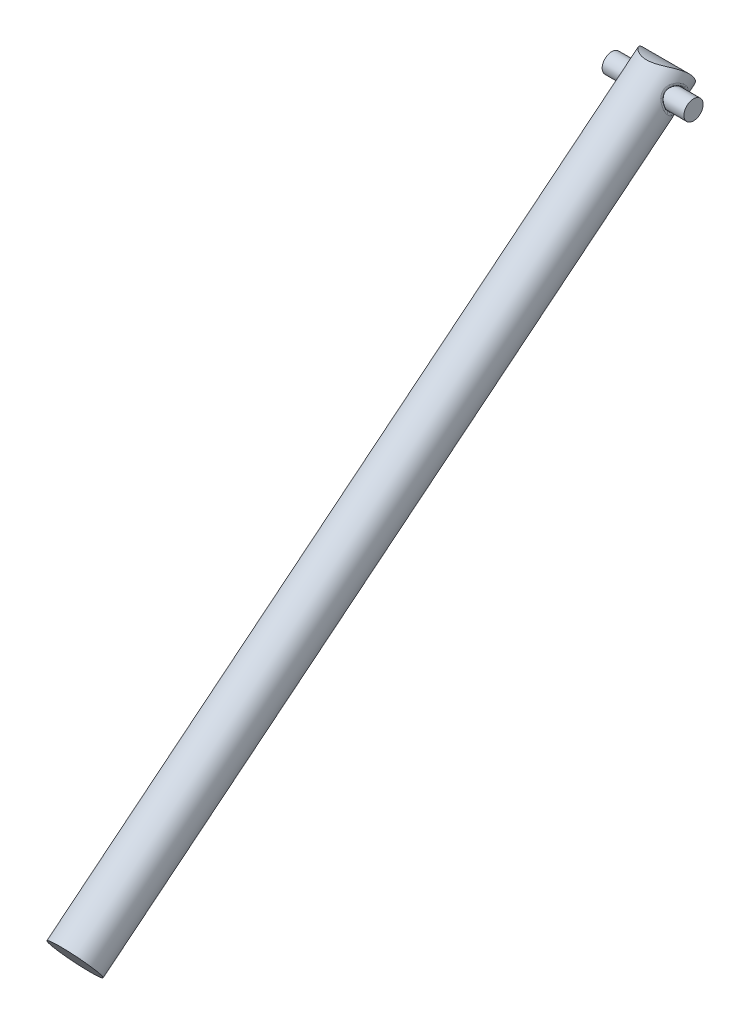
ISO-10303-21;
HEADER;
FILE_DESCRIPTION(('STEP AP214'),'2;1');
FILE_NAME('part.step','',(''),(''),'','','');
FILE_SCHEMA(('AUTOMOTIVE_DESIGN { 1 0 10303 214 1 1 1 1 }'));
ENDSEC;
DATA;
#1=APPLICATION_CONTEXT('core data for automotive mechanical design processes');
#2=APPLICATION_PROTOCOL_DEFINITION('international standard','automotive_design',2000,#1);
#3=PRODUCT_CONTEXT('',#1,'mechanical');
#4=PRODUCT('Part','Part','',(#3));
#5=PRODUCT_RELATED_PRODUCT_CATEGORY('part','',(#4));
#6=PRODUCT_DEFINITION_FORMATION('','',#4);
#7=PRODUCT_DEFINITION_CONTEXT('part definition',#1,'design');
#8=PRODUCT_DEFINITION('design','',#6,#7);
#9=PRODUCT_DEFINITION_SHAPE('','',#8);
#10=(LENGTH_UNIT() NAMED_UNIT(*) SI_UNIT(.MILLI.,.METRE.));
#11=(NAMED_UNIT(*) PLANE_ANGLE_UNIT() SI_UNIT($,.RADIAN.));
#12=(NAMED_UNIT(*) SI_UNIT($,.STERADIAN.) SOLID_ANGLE_UNIT());
#13=UNCERTAINTY_MEASURE_WITH_UNIT(LENGTH_MEASURE(1.E-05),#10,'distance_accuracy_value','');
#14=(GEOMETRIC_REPRESENTATION_CONTEXT(3) GLOBAL_UNCERTAINTY_ASSIGNED_CONTEXT((#13)) GLOBAL_UNIT_ASSIGNED_CONTEXT((#10,
#11,#12)) REPRESENTATION_CONTEXT('',''));
#15=CARTESIAN_POINT('',(0.,0.,0.));
#16=DIRECTION('',(0.,0.,1.));
#17=DIRECTION('',(1.,0.,0.));
#18=AXIS2_PLACEMENT_3D('',#15,#16,#17);
#19=CARTESIAN_POINT('',(-1406.35838867,-462.082062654,1391.17443848));
#20=DIRECTION('',(-1.,0.,0.));
#21=DIRECTION('',(0.,0.,1.));
#22=AXIS2_PLACEMENT_3D('',#19,#20,#21);
#23=CYLINDRICAL_SURFACE('',#22,7.03410289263);
#24=CARTESIAN_POINT('',(-1420.1756917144,-455.047956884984,1391.17444572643));
#25=CARTESIAN_POINT('',(-1420.14284893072,-455.047958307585,1391.25443452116));
#26=CARTESIAN_POINT('',(-1420.11011944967,-455.049329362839,1391.33447052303));
#27=CARTESIAN_POINT('',(-1420.04494851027,-455.054821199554,1391.49475358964));
#28=CARTESIAN_POINT('',(-1420.01250776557,-455.058947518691,1391.57500075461));
#29=CARTESIAN_POINT('',(-1419.94804351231,-455.069971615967,1391.73566354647));
#30=CARTESIAN_POINT('',(-1419.91602098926,-455.076875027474,1391.81607918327));
#31=CARTESIAN_POINT('',(-1419.85254431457,-455.093486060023,1391.97702887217));
#32=CARTESIAN_POINT('',(-1419.82109139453,-455.103199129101,1392.05756284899));
#33=CARTESIAN_POINT('',(-1419.75891920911,-455.125467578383,1392.21869002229));
#34=CARTESIAN_POINT('',(-1419.72820135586,-455.138028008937,1392.29928306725));
#35=CARTESIAN_POINT('',(-1419.66767723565,-455.166033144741,1392.46045998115));
#36=CARTESIAN_POINT('',(-1419.63787248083,-455.181482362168,1392.54104363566));
#37=CARTESIAN_POINT('',(-1419.57936193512,-455.215308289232,1392.70212367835));
#38=CARTESIAN_POINT('',(-1419.55065767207,-455.233688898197,1392.78261980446));
#39=CARTESIAN_POINT('',(-1419.49454216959,-455.273419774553,1392.94343663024));
#40=CARTESIAN_POINT('',(-1419.46713240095,-455.294773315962,1393.02375703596));
#41=CARTESIAN_POINT('',(-1419.41380372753,-455.340488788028,1393.18412378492));
#42=CARTESIAN_POINT('',(-1419.38788618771,-455.364853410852,1393.26416981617));
#43=CARTESIAN_POINT('',(-1419.33774071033,-455.416623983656,1393.42387830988));
#44=CARTESIAN_POINT('',(-1419.31351401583,-455.444032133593,1393.50354045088));
#45=CARTESIAN_POINT('',(-1419.26694696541,-455.501914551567,1393.66236039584));
#46=CARTESIAN_POINT('',(-1419.24460774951,-455.532390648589,1393.74151786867));
#47=CARTESIAN_POINT('',(-1419.20200748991,-455.596423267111,1393.89919606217));
#48=CARTESIAN_POINT('',(-1419.18174753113,-455.629981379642,1393.97771643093));
#49=CARTESIAN_POINT('',(-1419.14348982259,-455.700179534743,1394.13397597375));
#50=CARTESIAN_POINT('',(-1419.1254931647,-455.73682105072,1394.21171475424));
#51=CARTESIAN_POINT('',(-1419.09193541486,-455.813172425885,1394.3662542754));
#52=CARTESIAN_POINT('',(-1419.0763754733,-455.852883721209,1394.44305455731));
#53=CARTESIAN_POINT('',(-1419.04785099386,-455.935343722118,1394.59554744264));
#54=CARTESIAN_POINT('',(-1419.0348876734,-455.978093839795,1394.67123951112));
#55=CARTESIAN_POINT('',(-1419.01169988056,-456.066580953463,1394.82133317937));
#56=CARTESIAN_POINT('',(-1419.00147662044,-456.112319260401,1394.89573419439));
#57=CARTESIAN_POINT('',(-1418.98389341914,-456.206710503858,1395.04304926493));
#58=CARTESIAN_POINT('',(-1418.97653449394,-456.255364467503,1395.11596278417));
#59=CARTESIAN_POINT('',(-1418.96478196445,-456.355490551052,1395.26009271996));
#60=CARTESIAN_POINT('',(-1418.96038883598,-456.406963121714,1395.33130886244));
#61=CARTESIAN_POINT('',(-1418.95464738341,-456.512607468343,1395.47182152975));
#62=CARTESIAN_POINT('',(-1418.95329863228,-456.566778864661,1395.54111832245));
#63=CARTESIAN_POINT('',(-1418.95365300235,-456.677667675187,1395.67760048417));
#64=CARTESIAN_POINT('',(-1418.95535519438,-456.734384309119,1395.74478648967));
#65=CARTESIAN_POINT('',(-1418.96177758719,-456.850202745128,1395.87688139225));
#66=CARTESIAN_POINT('',(-1418.96649680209,-456.909303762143,1395.94179102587));
#67=CARTESIAN_POINT('',(-1418.97888581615,-457.029725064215,1396.06918894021));
#68=CARTESIAN_POINT('',(-1418.98655475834,-457.091044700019,1396.1316779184));
#69=CARTESIAN_POINT('',(-1419.0047455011,-457.215734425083,1396.2541112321));
#70=CARTESIAN_POINT('',(-1419.01526661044,-457.279104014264,1396.31405618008));
#71=CARTESIAN_POINT('',(-1419.03903791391,-457.407724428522,1396.43129797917));
#72=CARTESIAN_POINT('',(-1419.05228751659,-457.472974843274,1396.48859540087));
#73=CARTESIAN_POINT('',(-1419.08136990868,-457.605189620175,1396.60045758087));
#74=CARTESIAN_POINT('',(-1419.097202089,-457.672153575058,1396.65502297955));
#75=CARTESIAN_POINT('',(-1419.13128555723,-457.807632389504,1396.7613544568));
#76=CARTESIAN_POINT('',(-1419.14953609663,-457.876146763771,1396.81312139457));
#77=CARTESIAN_POINT('',(-1419.1882778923,-458.014569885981,1396.91380629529));
#78=CARTESIAN_POINT('',(-1419.20876817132,-458.084478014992,1396.9627254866));
#79=CARTESIAN_POINT('',(-1419.25180060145,-458.225540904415,1397.05768127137));
#80=CARTESIAN_POINT('',(-1419.27434151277,-458.296694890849,1397.10371957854));
#81=CARTESIAN_POINT('',(-1419.32127967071,-458.440112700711,1397.19289542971));
#82=CARTESIAN_POINT('',(-1419.34567544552,-458.512375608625,1397.23603522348));
#83=CARTESIAN_POINT('',(-1419.39612545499,-458.65788892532,1397.3194100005));
#84=CARTESIAN_POINT('',(-1419.42217809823,-458.731138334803,1397.35964769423));
#85=CARTESIAN_POINT('',(-1419.47574177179,-458.878517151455,1397.43724008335));
#86=CARTESIAN_POINT('',(-1419.50325128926,-458.952645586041,1397.4745976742));
#87=CARTESIAN_POINT('',(-1419.55953732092,-459.101687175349,1397.54645409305));
#88=CARTESIAN_POINT('',(-1419.58831239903,-459.176599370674,1397.58095603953));
#89=CARTESIAN_POINT('',(-1419.64694607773,-459.327121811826,1397.64712357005));
#90=CARTESIAN_POINT('',(-1419.6768032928,-459.402731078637,1397.67879261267));
#91=CARTESIAN_POINT('',(-1419.73742512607,-459.554568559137,1397.7393154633));
#92=CARTESIAN_POINT('',(-1419.76818841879,-459.630795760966,1397.76817314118));
#93=CARTESIAN_POINT('',(-1419.83045331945,-459.783796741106,1397.82309298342));
#94=CARTESIAN_POINT('',(-1419.8619536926,-459.860569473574,1397.84915946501));
#95=CARTESIAN_POINT('',(-1419.92553032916,-460.014594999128,1397.89851526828));
#96=CARTESIAN_POINT('',(-1419.9576054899,-460.091846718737,1397.92180936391));
#97=CARTESIAN_POINT('',(-1420.02217559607,-460.246768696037,1397.96563736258));
#98=CARTESIAN_POINT('',(-1420.05466961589,-460.324437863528,1397.98617648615));
#99=CARTESIAN_POINT('',(-1420.1199273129,-460.480137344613,1398.02451010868));
#100=CARTESIAN_POINT('',(-1420.15269028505,-460.558166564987,1398.04231025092));
#101=CARTESIAN_POINT('',(-1420.2183414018,-460.714532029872,1398.07518005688));
#102=CARTESIAN_POINT('',(-1420.25122910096,-460.792867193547,1398.09025575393));
#103=CARTESIAN_POINT('',(-1420.31699049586,-460.949792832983,1398.11768936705));
#104=CARTESIAN_POINT('',(-1420.34986403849,-461.028382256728,1398.1300536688));
#105=CARTESIAN_POINT('',(-1420.4154629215,-461.185766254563,1398.15207570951));
#106=CARTESIAN_POINT('',(-1420.44818842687,-461.2645598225,1398.16174014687));
#107=CARTESIAN_POINT('',(-1420.51336168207,-461.422302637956,1398.17837216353));
#108=CARTESIAN_POINT('',(-1420.54580993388,-461.501250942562,1398.18534671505));
#109=CARTESIAN_POINT('',(-1420.61030344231,-461.659253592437,1398.19660711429));
#110=CARTESIAN_POINT('',(-1420.64234955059,-461.738307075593,1398.20090017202));
#111=CARTESIAN_POINT('',(-1420.70591751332,-461.896469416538,1398.20680414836));
#112=CARTESIAN_POINT('',(-1420.73744057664,-461.975577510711,1398.20842248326));
#113=CARTESIAN_POINT('',(-1420.79984483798,-462.133796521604,1398.20898194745));
#114=CARTESIAN_POINT('',(-1420.83072760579,-462.212906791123,1398.20793067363));
#115=CARTESIAN_POINT('',(-1420.89173697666,-462.371074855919,1398.2031541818));
#116=CARTESIAN_POINT('',(-1420.92186551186,-462.450132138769,1398.19943672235));
#117=CARTESIAN_POINT('',(-1420.9812550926,-462.608135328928,1398.18932939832));
#118=CARTESIAN_POINT('',(-1421.01051843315,-462.687080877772,1398.18294744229));
#119=CARTESIAN_POINT('',(-1421.06806893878,-462.844797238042,1398.16751092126));
#120=CARTESIAN_POINT('',(-1421.09635876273,-462.92356786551,1398.15846441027));
#121=CARTESIAN_POINT('',(-1421.15185583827,-463.080865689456,1398.13769669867));
#122=CARTESIAN_POINT('',(-1421.17906611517,-463.159392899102,1398.12598369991));
#123=CARTESIAN_POINT('',(-1421.23229968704,-463.316129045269,1398.09987934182));
#124=CARTESIAN_POINT('',(-1421.25832637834,-463.394338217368,1398.08549633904));
#125=CARTESIAN_POINT('',(-1421.30908987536,-463.550356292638,1398.05404543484));
#126=CARTESIAN_POINT('',(-1421.33383045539,-463.62816568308,1398.03698605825));
#127=CARTESIAN_POINT('',(-1421.38192162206,-463.783298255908,1398.00017685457));
#128=CARTESIAN_POINT('',(-1421.40527630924,-463.860622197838,1397.98043559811));
#129=CARTESIAN_POINT('',(-1421.45050357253,-464.014702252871,1397.93827484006));
#130=CARTESIAN_POINT('',(-1421.47238041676,-464.091459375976,1397.91586361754));
#131=CARTESIAN_POINT('',(-1421.51456361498,-464.244319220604,1397.86837523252));
#132=CARTESIAN_POINT('',(-1421.53487434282,-464.320423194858,1397.84330599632));
#133=CARTESIAN_POINT('',(-1421.57384122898,-464.471885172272,1397.79051725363));
#134=CARTESIAN_POINT('',(-1421.59250180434,-464.54724465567,1397.76280526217));
#135=CARTESIAN_POINT('',(-1421.62808923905,-464.697121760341,1397.7047500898));
#136=CARTESIAN_POINT('',(-1421.64502047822,-464.771641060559,1397.67441393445));
#137=CARTESIAN_POINT('',(-1421.6770757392,-464.919738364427,1397.6111337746));
#138=CARTESIAN_POINT('',(-1421.69220400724,-464.993318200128,1397.57819621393));
#139=CARTESIAN_POINT('',(-1421.72058616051,-465.139434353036,1397.50974146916));
#140=CARTESIAN_POINT('',(-1421.73384405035,-465.211972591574,1397.47423005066));
#141=CARTESIAN_POINT('',(-1421.75842530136,-465.3559013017,1397.40066136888));
#142=CARTESIAN_POINT('',(-1421.76975231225,-465.427293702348,1397.36260910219));
#143=CARTESIAN_POINT('',(-1421.79041938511,-465.568825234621,1397.28399872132));
#144=CARTESIAN_POINT('',(-1421.79976263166,-465.638966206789,1397.24344476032));
#145=CARTESIAN_POINT('',(-1421.81641806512,-465.777888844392,1397.15987777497));
#146=CARTESIAN_POINT('',(-1421.82373287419,-465.846672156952,1397.1168680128));
#147=CARTESIAN_POINT('',(-1421.8362966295,-465.982773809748,1397.0284438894));
#148=CARTESIAN_POINT('',(-1421.84154756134,-466.050093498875,1396.98303188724));
#149=CARTESIAN_POINT('',(-1421.84995747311,-466.183162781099,1396.88986505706));
#150=CARTESIAN_POINT('',(-1421.85311776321,-466.248913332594,1396.84211171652));
#151=CARTESIAN_POINT('',(-1421.85733430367,-466.378742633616,1396.744335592));
#152=CARTESIAN_POINT('',(-1421.85839119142,-466.442821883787,1396.69431350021));
#153=CARTESIAN_POINT('',(-1421.85838867,-466.506012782,1396.64319234));
#154=B_SPLINE_CURVE_WITH_KNOTS('',3,(#24,#25,#26,#27,#28,#29,#30,#31,#32,#33,#34,#35,#36,#37,
#38,#39,#40,#41,#42,#43,#44,#45,#46,#47,#48,#49,#50,#51,#52,#53,#54,#55,#56,#57,#58,#59,#60,#61,
#62,#63,#64,#65,#66,#67,#68,#69,#70,#71,#72,#73,#74,#75,#76,#77,#78,#79,#80,#81,#82,#83,#84,#85,
#86,#87,#88,#89,#90,#91,#92,#93,#94,#95,#96,#97,#98,#99,#100,#101,#102,#103,#104,#105,#106,#107,
#108,#109,#110,#111,#112,#113,#114,#115,#116,#117,#118,#119,#120,#121,#122,#123,#124,#125,#126,
#127,#128,#129,#130,#131,#132,#133,#134,#135,#136,#137,#138,#139,#140,#141,#142,#143,#144,#145,
#146,#147,#148,#149,#150,#151,#152,#153),.UNSPECIFIED.,.F.,.F.,(4,2,2,2,2,2,2,2,2,2,2,2,2,2,2,2,
2,2,2,2,2,2,2,2,2,2,2,2,2,2,2,2,2,2,2,2,2,2,2,2,2,2,2,2,2,2,2,2,2,2,2,2,2,2,2,2,2,2,2,2,2,2,2,2,
4),(0.,0.259396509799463,0.519315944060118,0.779765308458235,1.04072311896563,1.30214746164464,
1.56398360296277,1.82617098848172,2.08864943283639,2.35136427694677,2.61427027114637,
2.8773339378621,3.14053417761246,3.40386090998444,3.66731158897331,3.93088549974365,
4.19457582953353,4.45835960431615,4.7221856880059,4.98597476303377,5.24968351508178,
5.5133061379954,5.77685222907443,6.04033450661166,6.30375973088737,6.56712291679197,
6.83040477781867,7.09357221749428,7.35658159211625,7.61938440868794,7.8819385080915,
8.14422511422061,8.40622140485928,8.66789333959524,8.92919983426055,9.19009613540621,
9.45053647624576,9.71047610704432,9.96987278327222,10.2286877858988,10.4868865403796,
10.7444388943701,11.0013191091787,11.2575056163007,11.5129805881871,11.7677293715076,
12.0217398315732,12.2750016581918,12.5275056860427,12.7792432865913,13.0302058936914,
13.2803847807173,13.529782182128,13.7784254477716,14.0263470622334,14.2735835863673,
14.5201775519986,14.7661787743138,15.0116450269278,15.2566420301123,15.5012427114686,
15.745525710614,15.9895731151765,16.2334674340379,16.4772878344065),.UNSPECIFIED.);
#155=CARTESIAN_POINT('',(-1421.858389,-466.506013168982,1396.64319280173));
#156=VERTEX_POINT('',#155);
#157=CARTESIAN_POINT('',(-1420.17569322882,-455.047958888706,1391.17444176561));
#158=VERTEX_POINT('',#157);
#159=EDGE_CURVE('P0_E101',#156,#158,#154,.F.);
#160=ORIENTED_EDGE('',*,*,#159,.T.);
#161=CARTESIAN_POINT('',(-1421.85839032,-457.658110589,1385.7056823));
#162=CARTESIAN_POINT('',(-1421.85839034,-457.019801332,1386.22204278));
#163=CARTESIAN_POINT('',(-1421.76878362,-456.456497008,1386.83165134));
#164=CARTESIAN_POINT('',(-1421.58900966,-455.992705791,1387.51587188));
#165=CARTESIAN_POINT('',(-1421.20613067,-455.44084675,1388.64740055));
#166=CARTESIAN_POINT('',(-1420.72217386,-455.151933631,1389.85465994));
#167=CARTESIAN_POINT('',(-1420.54191913,-455.082966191,1390.29015243));
#168=CARTESIAN_POINT('',(-1420.35789839,-455.047965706,1390.73068946));
#169=CARTESIAN_POINT('',(-1420.17569469,-455.047961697,1391.1744375));
#170=B_SPLINE_CURVE_WITH_KNOTS('',5,(#161,#162,#163,#164,#165,#166,#167,#168,#169),
.UNSPECIFIED.,.F.,.F.,(6,3,6),(27.4869071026,34.7192571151,38.6952322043),.UNSPECIFIED.);
#171=CARTESIAN_POINT('',(-1421.858390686,-457.658111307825,1385.70568296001));
#172=VERTEX_POINT('',#171);
#173=EDGE_CURVE('P0_E85',#158,#172,#170,.F.);
#174=ORIENTED_EDGE('',*,*,#173,.T.);
#175=CARTESIAN_POINT('',(-1420.17569394,-469.116165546,1391.17443848));
#176=CARTESIAN_POINT('',(-1419.78369873,-469.116165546,1390.21975018));
#177=CARTESIAN_POINT('',(-1419.40273938,-468.953454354,1389.25141558));
#178=CARTESIAN_POINT('',(-1419.06857303,-468.623058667,1388.27476401));
#179=CARTESIAN_POINT('',(-1418.84827253,-467.798483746,1386.87503606));
#180=CARTESIAN_POINT('',(-1419.0404061,-466.646132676,1385.78238144));
#181=CARTESIAN_POINT('',(-1419.1496316,-466.228013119,1385.45642264));
#182=CARTESIAN_POINT('',(-1419.45582375,-465.284838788,1384.85144079));
#183=CARTESIAN_POINT('',(-1419.86637091,-464.27900379,1384.45507664));
#184=CARTESIAN_POINT('',(-1420.10155503,-463.72767795,1384.30049299));
#185=CARTESIAN_POINT('',(-1420.78189236,-462.126954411,1384.01876836));
#186=CARTESIAN_POINT('',(-1421.39530608,-460.506587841,1384.19824145));
#187=CARTESIAN_POINT('',(-1421.70366064,-459.463944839,1384.51034247));
#188=CARTESIAN_POINT('',(-1421.85840178,-458.496293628,1385.02760638));
#189=CARTESIAN_POINT('',(-1421.85839093,-457.658108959,1385.70568205));
#190=B_SPLINE_CURVE_WITH_KNOTS('',5,(#175,#176,#177,#178,#179,#180,#181,#182,#183,#184,#185,
#186,#187,#188,#189),.UNSPECIFIED.,.F.,.F.,(6,3,3,3,6),(0.,8.55530886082,12.917855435,
17.9906381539,27.4883936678),.UNSPECIFIED.);
#191=CARTESIAN_POINT('',(-1420.17569394,-469.116165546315,1391.17443848));
#192=VERTEX_POINT('',#191);
#193=EDGE_CURVE('P0_E249',#172,#192,#190,.F.);
#194=ORIENTED_EDGE('',*,*,#193,.T.);
#195=CARTESIAN_POINT('',(-1421.85839032,-466.506014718,1396.64319465));
#196=CARTESIAN_POINT('',(-1421.85839034,-467.144323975,1396.12683418));
#197=CARTESIAN_POINT('',(-1421.76878362,-467.707628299,1395.51722561));
#198=CARTESIAN_POINT('',(-1421.58900966,-468.171419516,1394.83300507));
#199=CARTESIAN_POINT('',(-1421.20611084,-468.723307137,1393.7014178));
#200=CARTESIAN_POINT('',(-1420.72212374,-469.0122216,1392.49409197));
#201=CARTESIAN_POINT('',(-1420.54186683,-469.081173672,1392.05860222));
#202=CARTESIAN_POINT('',(-1420.35789551,-469.116165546,1391.61818295));
#203=CARTESIAN_POINT('',(-1420.17569394,-469.116165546,1391.17443848));
#204=B_SPLINE_CURVE_WITH_KNOTS('',5,(#195,#196,#197,#198,#199,#200,#201,#202,#203),
.UNSPECIFIED.,.F.,.F.,(6,3,6),(66.1850966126,73.4174466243,77.3940021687),.UNSPECIFIED.);
#205=EDGE_CURVE('P0_E104',#192,#156,#204,.F.);
#206=ORIENTED_EDGE('',*,*,#205,.T.);
#207=EDGE_LOOP('',(#160,#174,#194,#206));
#208=FACE_BOUND('',#207,.T.);
#209=CARTESIAN_POINT('',(-1392.54108265,-455.047961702,1391.1744375));
#210=CARTESIAN_POINT('',(-1392.23221345,-455.047968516,1390.42220195));
#211=CARTESIAN_POINT('',(-1391.91813571,-455.148660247,1389.67905729));
#212=CARTESIAN_POINT('',(-1391.62598295,-455.344345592,1388.95480932));
#213=CARTESIAN_POINT('',(-1391.21090159,-455.830373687,1387.79640967));
#214=CARTESIAN_POINT('',(-1390.96119854,-456.566496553,1386.76538136));
#215=CARTESIAN_POINT('',(-1390.89265023,-456.897769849,1386.37963458));
#216=CARTESIAN_POINT('',(-1390.85838867,-457.263548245,1386.02486751));
#217=CARTESIAN_POINT('',(-1390.85838867,-457.658112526,1385.70568462));
#218=B_SPLINE_CURVE_WITH_KNOTS('',5,(#209,#210,#211,#212,#213,#214,#215,#216,#217),
.UNSPECIFIED.,.F.,.F.,(6,3,6),(0.,6.74001706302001,11.2096714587),.UNSPECIFIED.);
#219=CARTESIAN_POINT('',(-1390.85838867,-457.658112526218,1385.70568462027));
#220=VERTEX_POINT('',#219);
#221=CARTESIAN_POINT('',(-1392.54108246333,-455.047961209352,1391.17443779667));
#222=VERTEX_POINT('',#221);
#223=EDGE_CURVE('P0_E171',#220,#222,#218,.F.);
#224=ORIENTED_EDGE('',*,*,#223,.T.);
#225=CARTESIAN_POINT('',(-1390.85838867,-466.506012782,1396.64319234));
#226=CARTESIAN_POINT('',(-1390.8583862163,-466.442819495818,1396.69431543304));
#227=CARTESIAN_POINT('',(-1390.8594432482,-466.378737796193,1396.74433938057));
#228=CARTESIAN_POINT('',(-1390.86366022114,-466.248903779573,1396.84211882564));
#229=CARTESIAN_POINT('',(-1390.86682079,-466.183150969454,1396.88987364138));
#230=CARTESIAN_POINT('',(-1390.87523138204,-466.05007728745,1396.98304311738));
#231=CARTESIAN_POINT('',(-1390.88048270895,-465.982755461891,1397.0284562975));
#232=CARTESIAN_POINT('',(-1390.89304736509,-465.846649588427,1397.1168825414));
#233=CARTESIAN_POINT('',(-1390.90036267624,-465.777864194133,1397.15989325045));
#234=CARTESIAN_POINT('',(-1390.91701922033,-465.638937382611,1397.24346194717));
#235=CARTESIAN_POINT('',(-1390.92636307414,-465.568794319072,1397.28401667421));
#236=CARTESIAN_POINT('',(-1390.94703146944,-465.427258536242,1397.36262844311));
#237=CARTESIAN_POINT('',(-1390.95835919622,-465.355863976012,1397.4006813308));
#238=CARTESIAN_POINT('',(-1390.98294199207,-465.211930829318,1397.47425113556));
#239=CARTESIAN_POINT('',(-1390.99620071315,-465.139390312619,1397.50976305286));
#240=CARTESIAN_POINT('',(-1391.02458464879,-464.993269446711,1397.57821868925));
#241=CARTESIAN_POINT('',(-1391.03971387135,-464.919687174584,1397.6111566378));
#242=CARTESIAN_POINT('',(-1391.07177116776,-464.771584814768,1397.67443746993));
#243=CARTESIAN_POINT('',(-1391.08870349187,-464.697062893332,1397.70477390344));
#244=CARTESIAN_POINT('',(-1391.12429322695,-464.547180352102,1397.76282952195));
#245=CARTESIAN_POINT('',(-1391.14295502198,-464.471818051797,1397.79054167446));
#246=CARTESIAN_POINT('',(-1391.1819244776,-464.320350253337,1397.84333061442));
#247=CARTESIAN_POINT('',(-1391.20223655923,-464.244243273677,1397.86839987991));
#248=CARTESIAN_POINT('',(-1391.24442258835,-464.091377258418,1397.91588817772));
#249=CARTESIAN_POINT('',(-1391.26630091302,-464.014616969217,1397.93829927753));
#250=CARTESIAN_POINT('',(-1391.31153124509,-463.860530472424,1397.98045961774));
#251=CARTESIAN_POINT('',(-1391.33488752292,-463.783203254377,1398.0002005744));
#252=CARTESIAN_POINT('',(-1391.38298195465,-463.628064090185,1398.0370089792));
#253=CARTESIAN_POINT('',(-1391.40772421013,-463.550251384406,1398.05406785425));
#254=CARTESIAN_POINT('',(-1391.45849112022,-463.394226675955,1398.08551755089));
#255=CARTESIAN_POINT('',(-1391.48451954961,-463.316014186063,1398.0998998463));
#256=CARTESIAN_POINT('',(-1391.53775664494,-463.159271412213,1398.12600257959));
#257=CARTESIAN_POINT('',(-1391.56496870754,-463.080740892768,1398.13771465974));
#258=CARTESIAN_POINT('',(-1391.6204693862,-462.923436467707,1398.15848032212));
#259=CARTESIAN_POINT('',(-1391.64876102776,-462.844662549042,1398.16752570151));
#260=CARTESIAN_POINT('',(-1391.7063151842,-462.686939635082,1398.18295974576));
#261=CARTESIAN_POINT('',(-1391.73558035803,-462.607990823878,1398.18934035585));
#262=CARTESIAN_POINT('',(-1391.79497360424,-462.449981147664,1398.19944477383));
#263=CARTESIAN_POINT('',(-1391.82510397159,-462.370920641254,1398.20316067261));
#264=CARTESIAN_POINT('',(-1391.88611698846,-462.212746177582,1398.20793382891));
#265=CARTESIAN_POINT('',(-1391.91700157,-462.133632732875,1398.20898332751));
#266=CARTESIAN_POINT('',(-1391.97940942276,-461.975407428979,1398.20842009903));
#267=CARTESIAN_POINT('',(-1392.0109342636,-461.896296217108,1398.20679977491));
#268=CARTESIAN_POINT('',(-1392.07450572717,-461.738127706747,1398.20089160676));
#269=CARTESIAN_POINT('',(-1392.10655355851,-461.65907117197,1398.19659634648));
#270=CARTESIAN_POINT('',(-1392.17105044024,-461.501062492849,1398.1853313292));
#271=CARTESIAN_POINT('',(-1392.203500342,-461.422111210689,1398.17835436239));
#272=CARTESIAN_POINT('',(-1392.26867680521,-461.264362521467,1398.16171730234));
#273=CARTESIAN_POINT('',(-1392.30140386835,-461.185566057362,1398.15205023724));
#274=CARTESIAN_POINT('',(-1392.36700575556,-461.028176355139,1398.13002272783));
#275=CARTESIAN_POINT('',(-1392.39988074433,-460.949584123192,1398.1176555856));
#276=CARTESIAN_POINT('',(-1392.46564490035,-460.792652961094,1398.09021607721));
#277=CARTESIAN_POINT('',(-1392.49853391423,-460.714315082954,1398.07513732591));
#278=CARTESIAN_POINT('',(-1392.56418750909,-460.557944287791,1398.04226119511));
#279=CARTESIAN_POINT('',(-1392.5969516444,-460.479912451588,1398.02445778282));
#280=CARTESIAN_POINT('',(-1392.66221149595,-460.324207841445,1397.98611740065));
#281=CARTESIAN_POINT('',(-1392.69470650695,-460.246536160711,1397.96557478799));
#282=CARTESIAN_POINT('',(-1392.75927840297,-460.091609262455,1397.921739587));
#283=CARTESIAN_POINT('',(-1392.79135436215,-460.01435513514,1397.89844177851));
#284=CARTESIAN_POINT('',(-1392.8549323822,-459.860324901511,1397.84907831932));
#285=CARTESIAN_POINT('',(-1392.88643334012,-459.783549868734,1397.82300789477));
#286=CARTESIAN_POINT('',(-1392.94869917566,-459.630544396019,1397.76807992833));
#287=CARTESIAN_POINT('',(-1392.97946281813,-459.554315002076,1397.73921806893));
#288=CARTESIAN_POINT('',(-1393.04008509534,-459.402473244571,1397.67868660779));
#289=CARTESIAN_POINT('',(-1393.06994240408,-459.326861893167,1397.64701313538));
#290=CARTESIAN_POINT('',(-1393.12857599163,-459.176335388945,1397.58083648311));
#291=CARTESIAN_POINT('',(-1393.15735088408,-459.10142121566,1397.54632984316));
#292=CARTESIAN_POINT('',(-1393.21363625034,-458.952375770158,1397.47446377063));
#293=CARTESIAN_POINT('',(-1393.24114528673,-458.878245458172,1397.43710121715));
#294=CARTESIAN_POINT('',(-1393.29470766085,-458.730862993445,1397.35949858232));
#295=CARTESIAN_POINT('',(-1393.32075948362,-458.657611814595,1397.31925560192));
#296=CARTESIAN_POINT('',(-1393.37120753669,-458.512095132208,1397.2358701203));
#297=CARTESIAN_POINT('',(-1393.39560217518,-458.439830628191,1397.19272490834));
#298=CARTESIAN_POINT('',(-1393.44253797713,-458.296409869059,1397.10353877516));
#299=CARTESIAN_POINT('',(-1393.46507767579,-458.225254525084,1397.0574956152));
#300=CARTESIAN_POINT('',(-1393.50810754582,-458.084189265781,1396.96253071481));
#301=CARTESIAN_POINT('',(-1393.52859648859,-458.01428011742,1396.91360727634));
#302=CARTESIAN_POINT('',(-1393.56733531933,-457.87585534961,1396.81291416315));
#303=CARTESIAN_POINT('',(-1393.5855842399,-457.80734034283,1396.76114327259));
#304=CARTESIAN_POINT('',(-1393.61966395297,-457.671860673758,1396.65480364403));
#305=CARTESIAN_POINT('',(-1393.63549399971,-457.604896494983,1396.60023405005));
#306=CARTESIAN_POINT('',(-1393.66457138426,-457.472681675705,1396.48836266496));
#307=CARTESIAN_POINT('',(-1393.677818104,-457.407431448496,1396.43106022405));
#308=CARTESIAN_POINT('',(-1393.70158274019,-457.278811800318,1396.31380712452));
#309=CARTESIAN_POINT('',(-1393.71210004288,-457.215442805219,1396.25385587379));
#310=CARTESIAN_POINT('',(-1393.73028223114,-457.090754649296,1396.13140853));
#311=CARTESIAN_POINT('',(-1393.73794639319,-457.029436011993,1396.06891179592));
#312=CARTESIAN_POINT('',(-1393.7503250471,-456.909017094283,1395.94149723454));
#313=CARTESIAN_POINT('',(-1393.7550386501,-456.849917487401,1395.8765786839));
#314=CARTESIAN_POINT('',(-1393.76144938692,-456.73410230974,1395.74446570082));
#315=CARTESIAN_POINT('',(-1393.76314552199,-456.67738753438,1395.67727052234));
#316=CARTESIAN_POINT('',(-1393.76348803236,-456.566502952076,1395.54077147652));
#317=CARTESIAN_POINT('',(-1393.76213351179,-456.512333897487,1395.47146699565));
#318=CARTESIAN_POINT('',(-1393.75638165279,-456.406694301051,1395.33094194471));
#319=CARTESIAN_POINT('',(-1393.75198395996,-456.35522407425,1395.25972115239));
#320=CARTESIAN_POINT('',(-1393.74022210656,-456.25510319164,1395.11558199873));
#321=CARTESIAN_POINT('',(-1393.73285842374,-456.206452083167,1395.04266391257));
#322=CARTESIAN_POINT('',(-1393.71526486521,-456.112066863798,1394.8953378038));
#323=CARTESIAN_POINT('',(-1393.70503594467,-456.066331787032,1394.82093028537));
#324=CARTESIAN_POINT('',(-1393.68183575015,-455.977851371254,1394.67082092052));
#325=CARTESIAN_POINT('',(-1393.66886560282,-455.935104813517,1394.59511961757));
#326=CARTESIAN_POINT('',(-1393.64032651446,-455.852652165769,1394.4426058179));
#327=CARTESIAN_POINT('',(-1393.62475871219,-455.812944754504,1394.36579382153));
#328=CARTESIAN_POINT('',(-1393.59118468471,-455.736601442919,1394.21122945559));
#329=CARTESIAN_POINT('',(-1393.57317956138,-455.699964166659,1394.13347752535));
#330=CARTESIAN_POINT('',(-1393.53490496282,-455.629774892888,1393.97719185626));
#331=CARTESIAN_POINT('',(-1393.51463657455,-455.596221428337,1393.89865850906));
#332=CARTESIAN_POINT('',(-1393.47202021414,-455.532198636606,1393.74095644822));
#333=CARTESIAN_POINT('',(-1393.44967336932,-455.501727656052,1393.66178810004));
#334=CARTESIAN_POINT('',(-1393.40309257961,-455.44385612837,1393.50295050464));
#335=CARTESIAN_POINT('',(-1393.37885985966,-455.416453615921,1393.42328161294));
#336=CARTESIAN_POINT('',(-1393.32870457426,-455.364695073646,1393.26356558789));
#337=CARTESIAN_POINT('',(-1393.3027833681,-455.340336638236,1393.18351880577));
#338=CARTESIAN_POINT('',(-1393.24945021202,-455.294634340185,1393.02315801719));
#339=CARTESIAN_POINT('',(-1393.22203975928,-455.273287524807,1392.94284435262));
#340=CARTESIAN_POINT('',(-1393.16592614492,-455.233570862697,1392.78204934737));
#341=CARTESIAN_POINT('',(-1393.13722458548,-455.215197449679,1392.7015683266));
#342=CARTESIAN_POINT('',(-1393.07872282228,-455.181386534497,1392.54052685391));
#343=CARTESIAN_POINT('',(-1393.04892426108,-455.165944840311,1392.45996668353));
#344=CARTESIAN_POINT('',(-1392.98841564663,-455.137955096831,1392.29884402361));
#345=CARTESIAN_POINT('',(-1392.95770719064,-455.125402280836,1392.21828176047));
#346=CARTESIAN_POINT('',(-1392.89555619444,-455.103148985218,1392.05722102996));
#347=CARTESIAN_POINT('',(-1392.86411511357,-455.09344328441,1391.97672271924));
#348=CARTESIAN_POINT('',(-1392.80066323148,-455.076846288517,1391.81584525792));
#349=CARTESIAN_POINT('',(-1392.76865366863,-455.069949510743,1391.73546618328));
#350=CARTESIAN_POINT('',(-1392.70421451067,-455.058937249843,1391.57487162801));
#351=CARTESIAN_POINT('',(-1392.67178587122,-455.054816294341,1391.49465613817));
#352=CARTESIAN_POINT('',(-1392.60663565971,-455.049332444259,1391.33442364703));
#353=CARTESIAN_POINT('',(-1392.57391474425,-455.047964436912,1391.25440655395));
#354=CARTESIAN_POINT('',(-1392.54108153,-455.047964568,1391.17443634));
#355=B_SPLINE_CURVE_WITH_KNOTS('',3,(#225,#226,#227,#228,#229,#230,#231,#232,#233,#234,#235,
#236,#237,#238,#239,#240,#241,#242,#243,#244,#245,#246,#247,#248,#249,#250,#251,#252,#253,#254,
#255,#256,#257,#258,#259,#260,#261,#262,#263,#264,#265,#266,#267,#268,#269,#270,#271,#272,#273,
#274,#275,#276,#277,#278,#279,#280,#281,#282,#283,#284,#285,#286,#287,#288,#289,#290,#291,#292,
#293,#294,#295,#296,#297,#298,#299,#300,#301,#302,#303,#304,#305,#306,#307,#308,#309,#310,#311,
#312,#313,#314,#315,#316,#317,#318,#319,#320,#321,#322,#323,#324,#325,#326,#327,#328,#329,#330,
#331,#332,#333,#334,#335,#336,#337,#338,#339,#340,#341,#342,#343,#344,#345,#346,#347,#348,#349,
#350,#351,#352,#353,#354),.UNSPECIFIED.,.F.,.F.,(4,2,2,2,2,2,2,2,2,2,2,2,2,2,2,2,2,2,2,2,2,2,2,
2,2,2,2,2,2,2,2,2,2,2,2,2,2,2,2,2,2,2,2,2,2,2,2,2,2,2,2,2,2,2,2,2,2,2,2,2,2,2,2,2,4),(0.,
0.243829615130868,0.487732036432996,0.731786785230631,0.976076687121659,1.22068410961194,
1.4656879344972,1.71116129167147,1.95717006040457,2.20377212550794,2.45101736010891,
2.69894829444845,2.94760142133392,3.19700908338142,3.44719842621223,3.69817158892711,
3.94991982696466,4.20243455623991,4.45570712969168,4.70972836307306,4.96448792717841,
5.21997366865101,5.4761709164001,5.73306182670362,5.99062481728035,6.2488341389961,
6.50765963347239,6.76706672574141,7.02701670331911,7.28746733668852,7.54837390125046,
7.80969066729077,8.07137293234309,8.3333796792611,8.59567695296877,8.85824203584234,
9.12105585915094,9.38407526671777,9.64725131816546,9.91054063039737,10.1739109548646,
10.4373442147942,10.7008366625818,10.9643958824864,11.2280344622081,11.4917602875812,
11.7555635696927,12.0193975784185,12.2831891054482,12.5468927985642,12.810488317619,
13.0739685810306,13.3373301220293,13.6005657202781,13.8636593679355,14.1265835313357,
14.3892985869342,14.6517542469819,14.9138927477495,15.1756535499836,15.4369792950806,
15.6978227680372,15.958154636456,16.2179717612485,16.4773059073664),.UNSPECIFIED.);
#356=CARTESIAN_POINT('',(-1390.85838867,-466.506012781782,1396.64319233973));
#357=VERTEX_POINT('',#356);
#358=EDGE_CURVE('P0_E184',#222,#357,#355,.F.);
#359=ORIENTED_EDGE('',*,*,#358,.T.);
#360=CARTESIAN_POINT('',(-1392.54108341,-469.116165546,1391.17443848));
#361=CARTESIAN_POINT('',(-1392.48767118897,-469.116159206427,1391.30451382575));
#362=CARTESIAN_POINT('',(-1392.43398996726,-469.112553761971,1391.4344783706));
#363=CARTESIAN_POINT('',(-1392.32684738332,-469.098174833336,1391.69352725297));
#364=CARTESIAN_POINT('',(-1392.27338595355,-469.087428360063,1391.82261306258));
#365=CARTESIAN_POINT('',(-1392.16724915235,-469.058856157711,1392.07969772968));
#366=CARTESIAN_POINT('',(-1392.11457145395,-469.041059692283,1392.20769887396));
#367=CARTESIAN_POINT('',(-1392.01053998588,-468.998447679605,1392.46239327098));
#368=CARTESIAN_POINT('',(-1391.95918137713,-468.973663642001,1392.58908980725));
#369=CARTESIAN_POINT('',(-1391.85830354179,-468.917127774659,1392.84093871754));
#370=CARTESIAN_POINT('',(-1391.80877678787,-468.885409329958,1392.96609555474));
#371=CARTESIAN_POINT('',(-1391.7120546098,-468.815050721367,1393.21461057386));
#372=CARTESIAN_POINT('',(-1391.66484895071,-468.776445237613,1393.33797456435));
#373=CARTESIAN_POINT('',(-1391.57323982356,-468.692363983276,1393.58262329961));
#374=CARTESIAN_POINT('',(-1391.52882354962,-468.646923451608,1393.70391534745));
#375=CARTESIAN_POINT('',(-1391.44323810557,-468.549227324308,1393.94412731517));
#376=CARTESIAN_POINT('',(-1391.40205387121,-468.497006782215,1394.06305603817));
#377=CARTESIAN_POINT('',(-1391.34296855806,-468.413533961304,1394.23961162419));
#378=CARTESIAN_POINT('',(-1391.32375402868,-468.38490861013,1394.29805404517));
#379=CARTESIAN_POINT('',(-1391.28629262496,-468.32599094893,1394.4142183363));
#380=CARTESIAN_POINT('',(-1391.26804353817,-468.295702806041,1394.47194159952));
#381=CARTESIAN_POINT('',(-1391.23256394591,-468.233474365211,1394.5866186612));
#382=CARTESIAN_POINT('',(-1391.21533114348,-468.20153812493,1394.64357395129));
#383=CARTESIAN_POINT('',(-1391.18193299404,-468.13602871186,1394.75666679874));
#384=CARTESIAN_POINT('',(-1391.16576528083,-468.102459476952,1394.81280593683));
#385=CARTESIAN_POINT('',(-1391.13454300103,-468.033703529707,1394.92421632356));
#386=CARTESIAN_POINT('',(-1391.11948602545,-467.998520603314,1394.97948923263));
#387=CARTESIAN_POINT('',(-1391.09052781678,-467.926559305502,1395.08911682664));
#388=CARTESIAN_POINT('',(-1391.07662417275,-467.889784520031,1395.14347322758));
#389=CARTESIAN_POINT('',(-1391.0500127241,-467.814663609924,1395.25121704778));
#390=CARTESIAN_POINT('',(-1391.03730255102,-467.776320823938,1395.3046062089));
#391=CARTESIAN_POINT('',(-1391.01311521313,-467.698090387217,1395.41036466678));
#392=CARTESIAN_POINT('',(-1391.00163576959,-467.65820578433,1395.46273569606));
#393=CARTESIAN_POINT('',(-1390.97994397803,-467.57692065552,1395.56640701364));
#394=CARTESIAN_POINT('',(-1390.96972948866,-467.535522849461,1395.6177089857));
#395=CARTESIAN_POINT('',(-1390.95059838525,-467.451242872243,1395.71919149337));
#396=CARTESIAN_POINT('',(-1390.94167981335,-467.408363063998,1395.76937362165));
#397=CARTESIAN_POINT('',(-1390.92516781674,-467.321153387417,1395.86856608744));
#398=CARTESIAN_POINT('',(-1390.91757265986,-467.276825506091,1395.91757788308));
#399=CARTESIAN_POINT('',(-1390.90373104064,-467.186756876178,1396.01437983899));
#400=CARTESIAN_POINT('',(-1390.89748310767,-467.141017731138,1396.06217128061));
#401=CARTESIAN_POINT('',(-1390.88635559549,-467.048166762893,1396.15648333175));
#402=CARTESIAN_POINT('',(-1390.88147483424,-467.001056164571,1396.20300500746));
#403=CARTESIAN_POINT('',(-1390.87309709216,-466.905505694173,1396.29472921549));
#404=CARTESIAN_POINT('',(-1390.86959923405,-466.857066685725,1396.33993256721));
#405=CARTESIAN_POINT('',(-1390.86399883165,-466.758905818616,1396.42897255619));
#406=CARTESIAN_POINT('',(-1390.86189571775,-466.709184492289,1396.47280974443));
#407=CARTESIAN_POINT('',(-1390.85909024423,-466.60850978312,1396.55907184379));
#408=CARTESIAN_POINT('',(-1390.85838761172,-466.557556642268,1396.60149702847));
#409=CARTESIAN_POINT('',(-1390.85838867,-466.506012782,1396.64319234));
#410=B_SPLINE_CURVE_WITH_KNOTS('',3,(#360,#361,#362,#363,#364,#365,#366,#367,#368,#369,#370,
#371,#372,#373,#374,#375,#376,#377,#378,#379,#380,#381,#382,#383,#384,#385,#386,#387,#388,#389,
#390,#391,#392,#393,#394,#395,#396,#397,#398,#399,#400,#401,#402,#403,#404,#405,#406,#407,#408,
#409),.UNSPECIFIED.,.F.,.F.,(4,2,2,2,2,2,2,2,2,2,2,2,2,2,2,2,2,2,2,2,2,2,2,2,4),(0.,
0.421797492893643,0.842008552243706,1.26049334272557,1.67712040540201,2.09178417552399,
2.50441596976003,2.91498902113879,3.32351812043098,3.52705380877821,3.73010083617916,
3.93266981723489,4.13477243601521,4.33642299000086,4.53764079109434,4.73845043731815,
4.93888161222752,5.13896871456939,5.33875031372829,5.53826842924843,5.73756763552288,
5.93669399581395,6.13569383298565,6.33461234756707,6.53349209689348),.UNSPECIFIED.);
#411=CARTESIAN_POINT('',(-1392.54108341,-469.116165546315,1391.17443848));
#412=VERTEX_POINT('',#411);
#413=EDGE_CURVE('P0_E298',#357,#412,#410,.F.);
#414=ORIENTED_EDGE('',*,*,#413,.T.);
#415=CARTESIAN_POINT('',(-1390.85838867,-457.658112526,1385.70568462));
#416=CARTESIAN_POINT('',(-1390.85838653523,-457.72130559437,1385.65456223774));
#417=CARTESIAN_POINT('',(-1390.85944512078,-457.785386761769,1385.60453882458));
#418=CARTESIAN_POINT('',(-1390.86366557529,-457.915220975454,1385.50675696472));
#419=CARTESIAN_POINT('',(-1390.86682815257,-457.980974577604,1385.45899928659));
#420=CARTESIAN_POINT('',(-1390.87524100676,-458.114047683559,1385.36582171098));
#421=CARTESIAN_POINT('',(-1390.88049257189,-458.181368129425,1385.3204032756));
#422=CARTESIAN_POINT('',(-1390.8930553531,-458.317468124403,1385.23196570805));
#423=CARTESIAN_POINT('',(-1390.90036848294,-458.386248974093,1385.18894884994));
#424=CARTESIAN_POINT('',(-1390.9170184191,-458.52516405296,1385.10536839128));
#425=CARTESIAN_POINT('',(-1390.92635776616,-458.595299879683,1385.06480795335));
#426=CARTESIAN_POINT('',(-1390.94701564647,-458.736820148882,1384.98618646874));
#427=CARTESIAN_POINT('',(-1390.95833730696,-458.808206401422,1384.94812950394));
#428=CARTESIAN_POINT('',(-1390.98290758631,-458.952124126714,1384.87455409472));
#429=CARTESIAN_POINT('',(-1390.99615984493,-459.024657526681,1384.83904063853));
#430=CARTESIAN_POINT('',(-1391.0245317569,-459.170767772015,1384.77058489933));
#431=CARTESIAN_POINT('',(-1391.03965546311,-459.244346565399,1384.73764845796));
#432=CARTESIAN_POINT('',(-1391.07170386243,-459.392447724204,1384.67437352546));
#433=CARTESIAN_POINT('',(-1391.08863290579,-459.466971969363,1384.64404164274));
#434=CARTESIAN_POINT('',(-1391.1242191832,-459.616866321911,1384.58599730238));
#435=CARTESIAN_POINT('',(-1391.14288094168,-459.692238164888,1384.55829210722));
#436=CARTESIAN_POINT('',(-1391.18185391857,-459.843732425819,1384.50551788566));
#437=CARTESIAN_POINT('',(-1391.20216971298,-459.91985637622,1384.48045664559));
#438=CARTESIAN_POINT('',(-1391.24436654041,-460.072762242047,1384.43298290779));
#439=CARTESIAN_POINT('',(-1391.2662520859,-460.149545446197,1384.41057858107));
#440=CARTESIAN_POINT('',(-1391.31149914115,-460.303680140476,1384.36842762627));
#441=CARTESIAN_POINT('',(-1391.33486499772,-460.381032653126,1384.34868941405));
#442=CARTESIAN_POINT('',(-1391.38297878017,-460.536219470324,1384.3118765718));
#443=CARTESIAN_POINT('',(-1391.40773080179,-460.614054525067,1384.29481046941));
#444=CARTESIAN_POINT('',(-1391.4585188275,-460.770123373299,1384.26334519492));
#445=CARTESIAN_POINT('',(-1391.48455860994,-460.848357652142,1384.24895454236));
#446=CARTESIAN_POINT('',(-1391.5378203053,-461.005145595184,1384.22284151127));
#447=CARTESIAN_POINT('',(-1391.56504563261,-461.083699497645,1384.21112754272));
#448=CARTESIAN_POINT('',(-1391.62057322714,-461.241051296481,1384.19036774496));
#449=CARTESIAN_POINT('',(-1391.64887851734,-461.319849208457,1384.18133013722));
#450=CARTESIAN_POINT('',(-1391.70645793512,-461.477617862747,1384.16592197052));
#451=CARTESIAN_POINT('',(-1391.73573468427,-461.556588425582,1384.15955939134));
#452=CARTESIAN_POINT('',(-1391.79514643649,-461.714635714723,1384.14949975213));
#453=CARTESIAN_POINT('',(-1391.8252836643,-461.793712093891,1384.14581040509));
#454=CARTESIAN_POINT('',(-1391.8863037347,-461.951909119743,1384.14109578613));
#455=CARTESIAN_POINT('',(-1391.91718842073,-462.031029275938,1384.14007796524));
#456=CARTESIAN_POINT('',(-1391.9795891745,-462.18925699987,1384.14070552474));
#457=CARTESIAN_POINT('',(-1392.01110672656,-462.268363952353,1384.14235813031));
#458=CARTESIAN_POINT('',(-1392.07465772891,-462.426513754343,1384.14832686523));
#459=CARTESIAN_POINT('',(-1392.10669232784,-462.505555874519,1384.15265006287));
#460=CARTESIAN_POINT('',(-1392.17116139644,-462.663529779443,1384.16396157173));
#461=CARTESIAN_POINT('',(-1392.2035966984,-462.742460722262,1384.17095688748));
#462=CARTESIAN_POINT('',(-1392.26874639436,-462.900168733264,1384.18761962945));
#463=CARTESIAN_POINT('',(-1392.301461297,-462.978944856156,1384.1972940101));
#464=CARTESIAN_POINT('',(-1392.36704317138,-463.136297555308,1384.21932544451));
#465=CARTESIAN_POINT('',(-1392.39991031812,-463.214873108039,1384.23168928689));
#466=CARTESIAN_POINT('',(-1392.46566362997,-463.371775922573,1384.25911288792));
#467=CARTESIAN_POINT('',(-1392.49854964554,-463.45010210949,1384.2741791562));
#468=CARTESIAN_POINT('',(-1392.56420149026,-463.606454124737,1384.30702330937));
#469=CARTESIAN_POINT('',(-1392.59696687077,-463.684478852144,1384.32480733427));
#470=CARTESIAN_POINT('',(-1392.66223211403,-463.84017226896,1384.36310475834));
#471=CARTESIAN_POINT('',(-1392.6947312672,-463.917839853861,1384.38362386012));
#472=CARTESIAN_POINT('',(-1392.75931258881,-464.072759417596,1384.42741090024));
#473=CARTESIAN_POINT('',(-1392.79139383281,-464.150010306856,1384.45068406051));
#474=CARTESIAN_POINT('',(-1392.85498174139,-464.304032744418,1384.50000001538));
#475=CARTESIAN_POINT('',(-1392.8864873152,-464.380803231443,1384.52604753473));
#476=CARTESIAN_POINT('',(-1392.94876016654,-464.533796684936,1384.5809339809));
#477=CARTESIAN_POINT('',(-1392.97952623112,-464.610018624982,1384.60977714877));
#478=CARTESIAN_POINT('',(-1393.04015025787,-464.761842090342,1384.67027724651));
#479=CARTESIAN_POINT('',(-1393.07000691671,-464.837442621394,1384.70193798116));
#480=CARTESIAN_POINT('',(-1393.1286362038,-464.987945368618,1384.76809586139));
#481=CARTESIAN_POINT('',(-1393.1574074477,-465.062846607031,1384.80259646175));
#482=CARTESIAN_POINT('',(-1393.21368410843,-465.211867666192,1384.87445631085));
#483=CARTESIAN_POINT('',(-1393.24118803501,-465.285986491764,1384.91181879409));
#484=CARTESIAN_POINT('',(-1393.29474172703,-465.4333541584,1384.98942521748));
#485=CARTESIAN_POINT('',(-1393.32078981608,-465.506601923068,1385.02967236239));
#486=CARTESIAN_POINT('',(-1393.37123618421,-465.652125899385,1385.11306893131));
#487=CARTESIAN_POINT('',(-1393.39563258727,-465.724400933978,1385.15622154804));
#488=CARTESIAN_POINT('',(-1393.44257794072,-465.867858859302,1385.24543192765));
#489=CARTESIAN_POINT('',(-1393.46512500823,-465.939040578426,1385.29149256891));
#490=CARTESIAN_POINT('',(-1393.50817493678,-466.080173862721,1385.38650429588));
#491=CARTESIAN_POINT('',(-1393.52867609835,-466.150124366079,1385.4354577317));
#492=CARTESIAN_POINT('',(-1393.56744273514,-466.288643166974,1385.53622228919));
#493=CARTESIAN_POINT('',(-1393.58570682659,-466.357210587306,1385.58803515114));
#494=CARTESIAN_POINT('',(-1393.61981729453,-466.492800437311,1385.69446767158));
#495=CARTESIAN_POINT('',(-1393.63566265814,-466.559822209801,1385.74908849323));
#496=CARTESIAN_POINT('',(-1393.66476734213,-466.692150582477,1385.86106775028));
#497=CARTESIAN_POINT('',(-1393.67802599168,-466.757456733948,1385.91842689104));
#498=CARTESIAN_POINT('',(-1393.70180690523,-466.886179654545,1386.03579520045));
#499=CARTESIAN_POINT('',(-1393.7123287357,-466.949596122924,1386.09580478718));
#500=CARTESIAN_POINT('',(-1393.73050776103,-467.074364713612,1386.21836793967));
#501=CARTESIAN_POINT('',(-1393.73816460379,-467.135716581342,1386.28092181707));
#502=CARTESIAN_POINT('',(-1393.75051222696,-467.25618390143,1386.40844895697));
#503=CARTESIAN_POINT('',(-1393.75520257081,-467.31529902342,1386.4734225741));
#504=CARTESIAN_POINT('',(-1393.76154459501,-467.43112136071,1386.60564110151));
#505=CARTESIAN_POINT('',(-1393.76319586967,-467.487828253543,1386.67288631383));
#506=CARTESIAN_POINT('',(-1393.76345442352,-467.598671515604,1386.80944670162));
#507=CARTESIAN_POINT('',(-1393.76206228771,-467.652808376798,1386.87876147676));
#508=CARTESIAN_POINT('',(-1393.75626516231,-467.758369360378,1387.0192558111));
#509=CARTESIAN_POINT('',(-1393.75186149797,-467.809794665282,1387.09043453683));
#510=CARTESIAN_POINT('',(-1393.74010418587,-467.909817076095,1387.23445869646));
#511=CARTESIAN_POINT('',(-1393.73275206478,-467.958415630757,1387.30730324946));
#512=CARTESIAN_POINT('',(-1393.71518971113,-468.052694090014,1387.45446856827));
#513=CARTESIAN_POINT('',(-1393.70498087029,-468.098375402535,1387.52878859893));
#514=CARTESIAN_POINT('',(-1393.68182228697,-468.18675161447,1387.678722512));
#515=CARTESIAN_POINT('',(-1393.66887364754,-468.229447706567,1387.75433586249));
#516=CARTESIAN_POINT('',(-1393.64037463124,-468.311806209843,1387.90668264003));
#517=CARTESIAN_POINT('',(-1393.62482505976,-468.351469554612,1387.98341571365));
#518=CARTESIAN_POINT('',(-1393.59128189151,-468.427733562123,1388.1378371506));
#519=CARTESIAN_POINT('',(-1393.57328889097,-468.46433496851,1388.21552527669));
#520=CARTESIAN_POINT('',(-1393.53503178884,-468.534462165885,1388.37170137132));
#521=CARTESIAN_POINT('',(-1393.51476821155,-468.567988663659,1388.45018915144));
#522=CARTESIAN_POINT('',(-1393.47215480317,-468.631967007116,1388.60781876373));
#523=CARTESIAN_POINT('',(-1393.44980556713,-468.662419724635,1388.68696040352));
#524=CARTESIAN_POINT('',(-1393.403214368,-468.720263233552,1388.84576189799));
#525=CARTESIAN_POINT('',(-1393.37897318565,-468.747655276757,1388.92542152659));
#526=CARTESIAN_POINT('',(-1393.3287970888,-468.799399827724,1389.08513340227));
#527=CARTESIAN_POINT('',(-1393.30286320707,-468.82375416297,1389.16518538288));
#528=CARTESIAN_POINT('',(-1393.24950298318,-468.8694532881,1389.32556689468));
#529=CARTESIAN_POINT('',(-1393.22207793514,-468.890800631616,1389.40589613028));
#530=CARTESIAN_POINT('',(-1393.16593574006,-468.930521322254,1389.56672790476));
#531=CARTESIAN_POINT('',(-1393.13722010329,-468.948898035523,1389.64723014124));
#532=CARTESIAN_POINT('',(-1393.07869299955,-468.98271655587,1389.80831479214));
#533=CARTESIAN_POINT('',(-1393.04888317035,-468.998162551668,1389.88889692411));
#534=CARTESIAN_POINT('',(-1392.98835662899,-469.026160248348,1390.050059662));
#535=CARTESIAN_POINT('',(-1392.95764156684,-469.038716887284,1390.13064003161));
#536=CARTESIAN_POINT('',(-1392.89548306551,-469.060976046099,1390.29172929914));
#537=CARTESIAN_POINT('',(-1392.86404116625,-469.070684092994,1390.37223802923));
#538=CARTESIAN_POINT('',(-1392.80059344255,-469.087283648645,1390.53312605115));
#539=CARTESIAN_POINT('',(-1392.76858893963,-469.094181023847,1390.61350526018));
#540=CARTESIAN_POINT('',(-1392.7041645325,-469.105192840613,1390.77408892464));
#541=CARTESIAN_POINT('',(-1392.67174565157,-469.109313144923,1390.85429338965));
#542=CARTESIAN_POINT('',(-1392.60661664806,-469.114796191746,1391.01449391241));
#543=CARTESIAN_POINT('',(-1392.57390722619,-469.11616435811,1391.09449006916));
#544=CARTESIAN_POINT('',(-1392.54108341,-469.116165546,1391.17443848));
#545=B_SPLINE_CURVE_WITH_KNOTS('',3,(#415,#416,#417,#418,#419,#420,#421,#422,#423,#424,#425,
#426,#427,#428,#429,#430,#431,#432,#433,#434,#435,#436,#437,#438,#439,#440,#441,#442,#443,#444,
#445,#446,#447,#448,#449,#450,#451,#452,#453,#454,#455,#456,#457,#458,#459,#460,#461,#462,#463,
#464,#465,#466,#467,#468,#469,#470,#471,#472,#473,#474,#475,#476,#477,#478,#479,#480,#481,#482,
#483,#484,#485,#486,#487,#488,#489,#490,#491,#492,#493,#494,#495,#496,#497,#498,#499,#500,#501,
#502,#503,#504,#505,#506,#507,#508,#509,#510,#511,#512,#513,#514,#515,#516,#517,#518,#519,#520,
#521,#522,#523,#524,#525,#526,#527,#528,#529,#530,#531,#532,#533,#534,#535,#536,#537,#538,#539,
#540,#541,#542,#543,#544),.UNSPECIFIED.,.F.,.F.,(4,2,2,2,2,2,2,2,2,2,2,2,2,2,2,2,2,2,2,2,2,2,2,
2,2,2,2,2,2,2,2,2,2,2,2,2,2,2,2,2,2,2,2,2,2,2,2,2,2,2,2,2,2,2,2,2,2,2,2,2,2,2,2,2,4),(0.,
0.243827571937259,0.487737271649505,0.731797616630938,0.976085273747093,1.22068104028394,
1.46566620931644,1.71111937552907,1.95711372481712,2.20371483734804,2.45097902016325,
2.69895217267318,2.94766917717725,3.1971537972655,3.44741905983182,3.69846809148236,
3.95029537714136,4.20288840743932,4.45622968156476,4.71029903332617,4.96507624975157,
5.22054395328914,5.47669072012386,5.73351359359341,5.9910094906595,6.24916304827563,
6.50794700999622,6.76732450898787,7.02725152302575,7.28767952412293,7.54855834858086,
7.80983931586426,8.07147862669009,8.3334410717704,8.59570408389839,8.85826311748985,
9.12111553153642,9.38423232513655,9.64756589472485,9.91106153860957,10.1746672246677,
10.4383411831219,10.7020568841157,10.9658049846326,11.2295918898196,11.4934140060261,
11.7571854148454,12.0208408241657,12.284359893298,12.5477508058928,12.8110358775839,
13.0742395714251,13.3373791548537,13.6004581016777,13.8634622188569,14.1263583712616,
14.3890955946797,14.6516083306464,14.9138214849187,15.1756570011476,15.437041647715,
15.6979157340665,15.9582424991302,16.2180179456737,16.4772809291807),.UNSPECIFIED.);
#546=EDGE_CURVE('P0_E311',#412,#220,#545,.F.);
#547=ORIENTED_EDGE('',*,*,#546,.T.);
#548=EDGE_LOOP('',(#224,#359,#414,#547));
#549=FACE_BOUND('',#548,.T.);
#550=ADVANCED_FACE('P0_F16',(#208,#549),#23,.F.);
#551=CARTESIAN_POINT('',(-1392.54108341,-469.116165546,1391.17443848));
#552=CARTESIAN_POINT('',(-1392.17325875,-469.116165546,1391.05684488));
#553=CARTESIAN_POINT('',(-1391.80541428,-469.209321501,1390.93924494));
#554=CARTESIAN_POINT('',(-1391.46622657,-469.3959484,1390.83080658));
#555=CARTESIAN_POINT('',(-1390.90165937,-469.924996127,1390.65031436));
#556=CARTESIAN_POINT('',(-1390.6289426,-470.666095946,1390.56312676));
#557=CARTESIAN_POINT('',(-1390.58207192,-471.06511397,1390.5481422));
#558=CARTESIAN_POINT('',(-1390.62862068,-471.459358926,1390.56302385));
#559=CARTESIAN_POINT('',(-1390.75820531,-471.820765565,1390.60445207));
#560=CARTESIAN_POINT('',(-1392.93307759,-469.116165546,1390.21975269));
#561=CARTESIAN_POINT('',(-1392.54849611,-469.100205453,1390.10028429));
#562=CARTESIAN_POINT('',(-1392.16388889,-469.185369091,1389.96816449));
#563=CARTESIAN_POINT('',(-1391.81171308,-469.373295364,1389.83345561));
#564=CARTESIAN_POINT('',(-1391.23601768,-469.92046135,1389.58294704));
#565=CARTESIAN_POINT('',(-1390.98628708,-470.697818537,1389.40510616));
#566=CARTESIAN_POINT('',(-1390.96067336,-471.116359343,1389.34320549));
#567=CARTESIAN_POINT('',(-1391.03683642,-471.526869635,1389.31360624));
#568=CARTESIAN_POINT('',(-1391.20077938,-471.898125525,1389.31574099));
#569=CARTESIAN_POINT('',(-1393.31404271,-468.953452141,1389.25140297));
#570=CARTESIAN_POINT('',(-1392.91053231,-468.921334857,1389.14244882));
#571=CARTESIAN_POINT('',(-1392.50698887,-468.996336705,1389.00549056));
#572=CARTESIAN_POINT('',(-1392.14008169,-469.181640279,1388.85061757));
#573=CARTESIAN_POINT('',(-1391.55143236,-469.73602221,1388.53519009));
#574=CARTESIAN_POINT('',(-1391.32609756,-470.533677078,1388.26022811));
#575=CARTESIAN_POINT('',(-1391.32326133,-470.962766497,1388.14592733));
#576=CARTESIAN_POINT('',(-1391.43094293,-471.379915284,1388.06535629));
#577=CARTESIAN_POINT('',(-1391.63090138,-471.751316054,1388.0217702));
#578=CARTESIAN_POINT('',(-1393.64820397,-468.623057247,1388.27476323));
#579=CARTESIAN_POINT('',(-1393.21897949,-468.577462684,1388.20014716));
#580=CARTESIAN_POINT('',(-1392.78970955,-468.641683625,1388.07812517));
#581=CARTESIAN_POINT('',(-1392.40260457,-468.820969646,1387.91610946));
#582=CARTESIAN_POINT('',(-1391.79513717,-469.371367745,1387.54679459));
#583=CARTESIAN_POINT('',(-1391.59812081,-470.171063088,1387.16029774));
#584=CARTESIAN_POINT('',(-1391.62247838,-470.60027732,1386.98108076));
#585=CARTESIAN_POINT('',(-1391.767221,-471.012769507,1386.83452148));
#586=CARTESIAN_POINT('',(-1392.00818012,-471.373024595,1386.73019702));
#587=CARTESIAN_POINT('',(-1393.86850521,-467.798480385,1386.87503103));
#588=CARTESIAN_POINT('',(-1393.42145461,-467.78475653,1386.87451917));
#589=CARTESIAN_POINT('',(-1392.9743497,-467.870462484,1386.79873614));
#590=CARTESIAN_POINT('',(-1392.57323185,-468.057509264,1386.64721801));
#591=CARTESIAN_POINT('',(-1391.95264197,-468.592297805,1386.22667389));
#592=CARTESIAN_POINT('',(-1391.77494801,-469.318237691,1385.67219662));
#593=CARTESIAN_POINT('',(-1391.81791754,-469.69694463,1385.38637857));
#594=CARTESIAN_POINT('',(-1391.98798897,-470.049141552,1385.12410199));
#595=CARTESIAN_POINT('',(-1392.25690736,-470.3448215,1384.90754288));
#596=CARTESIAN_POINT('',(-1393.67637067,-466.646131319,1385.78238086));
#597=CARTESIAN_POINT('',(-1393.24470561,-466.689003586,1385.82185291));
#598=CARTESIAN_POINT('',(-1392.81299384,-466.808313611,1385.77071408));
#599=CARTESIAN_POINT('',(-1392.42396843,-467.00017574,1385.62454557));
#600=CARTESIAN_POINT('',(-1391.81469115,-467.48773863,1385.17362228));
#601=CARTESIAN_POINT('',(-1391.62026682,-468.076341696,1384.51613008));
#602=CARTESIAN_POINT('',(-1391.64713101,-468.369493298,1384.1628735));
#603=CARTESIAN_POINT('',(-1391.79527796,-468.630101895,1383.82307062));
#604=CARTESIAN_POINT('',(-1392.03998124,-468.837936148,1383.52597389));
#605=CARTESIAN_POINT('',(-1393.56714637,-466.228015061,1385.45642388));
#606=CARTESIAN_POINT('',(-1393.14372689,-466.289963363,1385.50347722));
#607=CARTESIAN_POINT('',(-1392.72026467,-466.419654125,1385.45651244));
#608=CARTESIAN_POINT('',(-1392.33771377,-466.611362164,1385.31047646));
#609=CARTESIAN_POINT('',(-1391.73445737,-467.078606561,1384.85096983));
#610=CARTESIAN_POINT('',(-1391.53089999,-467.616432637,1384.16808565));
#611=CARTESIAN_POINT('',(-1391.54900328,-467.878886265,1383.79813437));
#612=CARTESIAN_POINT('',(-1391.68520235,-468.107515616,1383.43848639));
#613=CARTESIAN_POINT('',(-1391.91666337,-468.285468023,1383.11985171));
#614=CARTESIAN_POINT('',(-1393.26095353,-465.284838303,1384.85144022));
#615=CARTESIAN_POINT('',(-1392.85801812,-465.381083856,1384.90264811));
#616=CARTESIAN_POINT('',(-1392.45504934,-465.52598938,1384.85611601));
#617=CARTESIAN_POINT('',(-1392.08854772,-465.710918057,1384.70676742));
#618=CARTESIAN_POINT('',(-1391.50001685,-466.124717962,1384.23180344));
#619=CARTESIAN_POINT('',(-1391.27285177,-466.550975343,1383.513571));
#620=CARTESIAN_POINT('',(-1391.26847626,-466.748378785,1383.1204356));
#621=CARTESIAN_POINT('',(-1391.37389748,-466.91102404,1382.73181499));
#622=CARTESIAN_POINT('',(-1391.57096204,-467.028663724,1382.37962389));
#623=CARTESIAN_POINT('',(-1392.85040511,-464.279000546,1384.45507536));
#624=CARTESIAN_POINT('',(-1392.46938746,-464.392809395,1384.49279633));
#625=CARTESIAN_POINT('',(-1392.08834535,-464.53710821,1384.43530591));
#626=CARTESIAN_POINT('',(-1391.73893276,-464.702476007,1384.27915193));
#627=CARTESIAN_POINT('',(-1391.1656108,-465.045965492,1383.79752715));
#628=CARTESIAN_POINT('',(-1390.91101398,-465.360965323,1383.07797465));
#629=CARTESIAN_POINT('',(-1390.88089575,-465.497786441,1382.68346461));
#630=CARTESIAN_POINT('',(-1390.95078285,-465.601933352,1382.28944323));
#631=CARTESIAN_POINT('',(-1391.10743932,-465.668202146,1381.92608379));
#632=CARTESIAN_POINT('',(-1392.61522192,-463.727639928,1384.30052353));
#633=CARTESIAN_POINT('',(-1392.24492695,-463.845027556,1384.32839619));
#634=CARTESIAN_POINT('',(-1391.87461147,-463.983967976,1384.26374092));
#635=CARTESIAN_POINT('',(-1391.53352499,-464.135243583,1384.1040947));
#636=CARTESIAN_POINT('',(-1390.96742016,-464.437078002,1383.62193457));
#637=CARTESIAN_POINT('',(-1390.69851034,-464.694087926,1382.90913142));
#638=CARTESIAN_POINT('',(-1390.65510159,-464.800462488,1382.51846601));
#639=CARTESIAN_POINT('',(-1390.70652802,-464.875896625,1382.12655408));
#640=CARTESIAN_POINT('',(-1390.84190996,-464.917367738,1381.7621352));
#641=CARTESIAN_POINT('',(-1391.93496116,-462.127203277,1384.01874198));
#642=CARTESIAN_POINT('',(-1391.59217373,-462.241574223,1384.01744168));
#643=CARTESIAN_POINT('',(-1391.24937509,-462.354510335,1383.93358046));
#644=CARTESIAN_POINT('',(-1390.92957319,-462.458326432,1383.76724577));
#645=CARTESIAN_POINT('',(-1390.38150111,-462.633658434,1383.2935759));
#646=CARTESIAN_POINT('',(-1390.07391072,-462.728433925,1382.61577382));
#647=CARTESIAN_POINT('',(-1389.99486597,-462.75158834,1382.24506855));
#648=CARTESIAN_POINT('',(-1389.99652692,-462.749503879,1381.86894152));
#649=CARTESIAN_POINT('',(-1390.07387396,-462.724398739,1381.51145034));
#650=CARTESIAN_POINT('',(-1391.321595,-460.506786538,1384.19830835));
#651=CARTESIAN_POINT('',(-1390.9963829,-460.586857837,1384.17481189));
#652=CARTESIAN_POINT('',(-1390.67116374,-460.649730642,1384.08251562));
#653=CARTESIAN_POINT('',(-1390.36479091,-460.69097166,1383.92277364));
#654=CARTESIAN_POINT('',(-1389.82714607,-460.726004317,1383.4878429));
#655=CARTESIAN_POINT('',(-1389.49032098,-460.669246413,1382.88208369));
#656=CARTESIAN_POINT('',(-1389.38494428,-460.618614,1382.55136484));
#657=CARTESIAN_POINT('',(-1389.34921282,-460.549272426,1382.21277358));
#658=CARTESIAN_POINT('',(-1389.38136314,-460.466385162,1381.8851487));
#659=CARTESIAN_POINT('',(-1391.01331965,-459.465145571,1384.50971999));
#660=CARTESIAN_POINT('',(-1390.69542029,-459.515612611,1384.48278876));
#661=CARTESIAN_POINT('',(-1390.37751523,-459.541425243,1384.39535087));
#662=CARTESIAN_POINT('',(-1390.07668438,-459.539952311,1384.24867906));
#663=CARTESIAN_POINT('',(-1389.54309069,-459.482987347,1383.85315362));
#664=CARTESIAN_POINT('',(-1389.19282412,-459.330198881,1383.30367122));
#665=CARTESIAN_POINT('',(-1389.07546385,-459.232826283,1383.00292232));
#666=CARTESIAN_POINT('',(-1389.02251404,-459.120190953,1382.69295857));
#667=CARTESIAN_POINT('',(-1389.03331081,-458.999000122,1382.38992302));
#668=CARTESIAN_POINT('',(-1390.85838867,-458.496402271,1385.02754987));
#669=CARTESIAN_POINT('',(-1390.54422941,-458.518223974,1385.0098972));
#670=CARTESIAN_POINT('',(-1390.23006516,-458.508608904,1384.93835167));
#671=CARTESIAN_POINT('',(-1389.93207152,-458.466386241,1384.81374119));
#672=CARTESIAN_POINT('',(-1389.400567,-458.321286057,1384.47184142));
#673=CARTESIAN_POINT('',(-1389.04349493,-458.075152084,1383.98731183));
#674=CARTESIAN_POINT('',(-1388.92005986,-457.931822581,1383.7199684));
#675=CARTESIAN_POINT('',(-1388.85838867,-457.775959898,1383.44196451));
#676=CARTESIAN_POINT('',(-1388.85838867,-457.615816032,1383.16743028));
#677=CARTESIAN_POINT('',(-1390.85838867,-457.658112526,1385.70568462));
#678=CARTESIAN_POINT('',(-1390.54422941,-457.658112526,1385.70568462));
#679=CARTESIAN_POINT('',(-1390.23006516,-457.619325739,1385.65773756));
#680=CARTESIAN_POINT('',(-1389.93207152,-457.541693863,1385.56177137));
#681=CARTESIAN_POINT('',(-1389.400567,-457.317120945,1385.2841611));
#682=CARTESIAN_POINT('',(-1389.04349493,-456.982842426,1384.87093607));
#683=CARTESIAN_POINT('',(-1388.92005986,-456.795425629,1384.63925707));
#684=CARTESIAN_POINT('',(-1388.85838867,-456.597838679,1384.39500603));
#685=CARTESIAN_POINT('',(-1388.85838867,-456.400254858,1384.15075887));
#686=B_SPLINE_SURFACE_WITH_KNOTS('',5,5,((#551,#552,#553,#554,#555,#556,#557,#558,#559),(#560,
#561,#562,#563,#564,#565,#566,#567,#568),(#569,#570,#571,#572,#573,#574,#575,#576,#577),(#578,
#579,#580,#581,#582,#583,#584,#585,#586),(#587,#588,#589,#590,#591,#592,#593,#594,#595),(#596,
#597,#598,#599,#600,#601,#602,#603,#604),(#605,#606,#607,#608,#609,#610,#611,#612,#613),(#614,
#615,#616,#617,#618,#619,#620,#621,#622),(#623,#624,#625,#626,#627,#628,#629,#630,#631),(#632,
#633,#634,#635,#636,#637,#638,#639,#640),(#641,#642,#643,#644,#645,#646,#647,#648,#649),(#650,
#651,#652,#653,#654,#655,#656,#657,#658),(#659,#660,#661,#662,#663,#664,#665,#666,#667),(#668,
#669,#670,#671,#672,#673,#674,#675,#676),(#677,#678,#679,#680,#681,#682,#683,#684,#685)),
.UNSPECIFIED.,.F.,.F.,.F.,(6,3,3,3,6),(6,3,6),(0.,8.55528640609,12.9178426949,17.9906406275,
27.486851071),(0.,1.,2.),.UNSPECIFIED.);
#687=CARTESIAN_POINT('',(-1390.85838867,-457.658112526,1385.70568462));
#688=CARTESIAN_POINT('',(-1390.54422941,-457.658112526,1385.70568462));
#689=CARTESIAN_POINT('',(-1390.23006516,-457.619325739,1385.65773756));
#690=CARTESIAN_POINT('',(-1389.93207152,-457.541693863,1385.56177137));
#691=CARTESIAN_POINT('',(-1389.400567,-457.317120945,1385.2841611));
#692=CARTESIAN_POINT('',(-1389.04349493,-456.982842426,1384.87093607));
#693=CARTESIAN_POINT('',(-1388.92005986,-456.795425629,1384.63925707));
#694=CARTESIAN_POINT('',(-1388.85838867,-456.597838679,1384.39500603));
#695=CARTESIAN_POINT('',(-1388.85838867,-456.400254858,1384.15075887));
#696=B_SPLINE_CURVE_WITH_KNOTS('',5,(#687,#688,#689,#690,#691,#692,#693,#694,#695),
.UNSPECIFIED.,.F.,.F.,(6,3,6),(0.,1.,2.),.UNSPECIFIED.);
#697=CARTESIAN_POINT('',(-1388.85838867,-456.400254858,1384.15075887));
#698=VERTEX_POINT('',#697);
#699=EDGE_CURVE('P0_E225',#698,#220,#696,.F.);
#700=CARTESIAN_POINT('',(-1392.54108341,-469.116165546,1391.17443848));
#701=CARTESIAN_POINT('',(-1392.17325875,-469.116165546,1391.05684488));
#702=CARTESIAN_POINT('',(-1391.80541428,-469.209321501,1390.93924494));
#703=CARTESIAN_POINT('',(-1391.46622657,-469.3959484,1390.83080658));
#704=CARTESIAN_POINT('',(-1390.90165937,-469.924996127,1390.65031436));
#705=CARTESIAN_POINT('',(-1390.6289426,-470.666095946,1390.56312676));
#706=CARTESIAN_POINT('',(-1390.58207192,-471.06511397,1390.5481422));
#707=CARTESIAN_POINT('',(-1390.62862068,-471.459358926,1390.56302385));
#708=CARTESIAN_POINT('',(-1390.75820531,-471.820765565,1390.60445207));
#709=B_SPLINE_CURVE_WITH_KNOTS('',5,(#700,#701,#702,#703,#704,#705,#706,#707,#708),
.UNSPECIFIED.,.F.,.F.,(6,3,6),(0.,1.,2.),.UNSPECIFIED.);
#710=CARTESIAN_POINT('',(-1390.7582053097,-471.820765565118,1390.6044520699));
#711=VERTEX_POINT('',#710);
#712=EDGE_CURVE('P0_E363',#412,#711,#709,.T.);
#713=CARTESIAN_POINT('',(-1390.75820531,-471.820765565,1390.60445207));
#714=CARTESIAN_POINT('',(-1391.20077938,-471.898125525,1389.31574099));
#715=CARTESIAN_POINT('',(-1391.63090138,-471.751316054,1388.0217702));
#716=CARTESIAN_POINT('',(-1392.00818012,-471.373024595,1386.73019702));
#717=CARTESIAN_POINT('',(-1392.25690736,-470.3448215,1384.90754288));
#718=CARTESIAN_POINT('',(-1392.03998124,-468.837936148,1383.52597389));
#719=CARTESIAN_POINT('',(-1391.91666337,-468.285468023,1383.11985171));
#720=CARTESIAN_POINT('',(-1391.57096204,-467.028663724,1382.37962389));
#721=CARTESIAN_POINT('',(-1391.10743932,-465.668202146,1381.92608379));
#722=CARTESIAN_POINT('',(-1390.84190996,-464.917367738,1381.7621352));
#723=CARTESIAN_POINT('',(-1390.07387396,-462.724398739,1381.51145034));
#724=CARTESIAN_POINT('',(-1389.38136314,-460.466385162,1381.8851487));
#725=CARTESIAN_POINT('',(-1389.03331081,-458.999000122,1382.38992302));
#726=CARTESIAN_POINT('',(-1388.85838867,-457.615816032,1383.16743028));
#727=CARTESIAN_POINT('',(-1388.85838867,-456.400254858,1384.15075887));
#728=B_SPLINE_CURVE_WITH_KNOTS('',5,(#713,#714,#715,#716,#717,#718,#719,#720,#721,#722,#723,
#724,#725,#726,#727),.UNSPECIFIED.,.F.,.F.,(6,3,3,3,6),(0.,8.55528640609,12.9178426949,
17.9906406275,27.486851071),.UNSPECIFIED.);
#729=EDGE_CURVE('P0_E108',#698,#711,#728,.F.);
#730=ORIENTED_EDGE('',*,*,#699,.T.);
#731=ORIENTED_EDGE('',*,*,#546,.F.);
#732=ORIENTED_EDGE('',*,*,#712,.T.);
#733=ORIENTED_EDGE('',*,*,#729,.F.);
#734=EDGE_LOOP('',(#730,#731,#732,#733));
#735=FACE_BOUND('',#734,.T.);
#736=ADVANCED_FACE('P0_F315',(#735),#686,.F.);
#737=CARTESIAN_POINT('',(-1390.85838867,-466.506012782,1396.64319234));
#738=CARTESIAN_POINT('',(-1390.54422941,-466.506012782,1396.64319234));
#739=CARTESIAN_POINT('',(-1390.23006516,-466.544799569,1396.69113939));
#740=CARTESIAN_POINT('',(-1389.93207152,-466.622431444,1396.78710558));
#741=CARTESIAN_POINT('',(-1389.400567,-466.847004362,1397.06471585));
#742=CARTESIAN_POINT('',(-1389.04349493,-467.181282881,1397.47794089));
#743=CARTESIAN_POINT('',(-1388.92005986,-467.368699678,1397.70961988));
#744=CARTESIAN_POINT('',(-1388.85838867,-467.566286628,1397.95387092));
#745=CARTESIAN_POINT('',(-1388.85838867,-467.763870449,1398.19811809));
#746=CARTESIAN_POINT('',(-1390.85838867,-466.900577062,1396.32400944));
#747=CARTESIAN_POINT('',(-1390.54422941,-466.910848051,1396.31570072));
#748=CARTESIAN_POINT('',(-1390.23006516,-466.963365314,1396.3525405));
#749=CARTESIAN_POINT('',(-1389.93207152,-467.057663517,1396.43502446));
#750=CARTESIAN_POINT('',(-1389.400567,-467.319642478,1396.6823751));
#751=CARTESIAN_POINT('',(-1389.04349493,-467.695408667,1397.06203867));
#752=CARTESIAN_POINT('',(-1388.92005986,-467.90357637,1397.27693122));
#753=CARTESIAN_POINT('',(-1388.85838867,-468.120802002,1397.50529554));
#754=CARTESIAN_POINT('',(-1388.85838867,-468.336007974,1397.73528726));
#755=CARTESIAN_POINT('',(-1390.89265023,-467.266355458,1395.96924238));
#756=CARTESIAN_POINT('',(-1390.5776679,-467.28539886,1395.95077169));
#757=CARTESIAN_POINT('',(-1390.26268044,-467.350269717,1395.97480191));
#758=CARTESIAN_POINT('',(-1389.9640626,-467.460057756,1396.04234937));
#759=CARTESIAN_POINT('',(-1389.43209938,-467.757533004,1396.25708006));
#760=CARTESIAN_POINT('',(-1389.07652922,-468.173638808,1396.60176362));
#761=CARTESIAN_POINT('',(-1388.95443432,-468.402144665,1396.79935974));
#762=CARTESIAN_POINT('',(-1388.89468761,-468.638677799,1397.01142803));
#763=CARTESIAN_POINT('',(-1388.89707108,-468.871174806,1397.22675477));
#764=CARTESIAN_POINT('',(-1390.96119108,-467.597629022,1395.5835129));
#765=CARTESIAN_POINT('',(-1390.64456198,-467.623371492,1395.5534925));
#766=CARTESIAN_POINT('',(-1390.32792743,-467.698764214,1395.56338105));
#767=CARTESIAN_POINT('',(-1390.0280607,-467.822534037,1395.61480809));
#768=CARTESIAN_POINT('',(-1389.49517967,-468.153122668,1395.79494371));
#769=CARTESIAN_POINT('',(-1389.14261415,-468.608164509,1396.10343379));
#770=CARTESIAN_POINT('',(-1389.0232004,-468.856482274,1396.28331336));
#771=CARTESIAN_POINT('',(-1388.96730374,-469.111841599,1396.47879525));
#772=CARTESIAN_POINT('',(-1388.97445594,-469.361078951,1396.67922258));
#773=CARTESIAN_POINT('',(-1391.21092581,-468.333789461,1394.55238761));
#774=CARTESIAN_POINT('',(-1390.88809908,-468.370386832,1394.49167533));
#775=CARTESIAN_POINT('',(-1390.56526567,-468.466961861,1394.46406919));
#776=CARTESIAN_POINT('',(-1390.26069192,-468.621561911,1394.47298237));
#777=CARTESIAN_POINT('',(-1389.72431378,-469.028544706,1394.56249986));
#778=CARTESIAN_POINT('',(-1389.38286077,-469.577211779,1394.77740084));
#779=CARTESIAN_POINT('',(-1389.27337937,-469.873617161,1394.9118064));
#780=CARTESIAN_POINT('',(-1389.23171506,-470.174581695,1395.06501217));
#781=CARTESIAN_POINT('',(-1389.25641442,-470.463845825,1395.22767473));
#782=CARTESIAN_POINT('',(-1391.62600912,-468.819830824,1393.39398665));
#783=CARTESIAN_POINT('',(-1391.29159688,-468.852272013,1393.30307106));
#784=CARTESIAN_POINT('',(-1390.95717524,-468.956590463,1393.23665821));
#785=CARTESIAN_POINT('',(-1390.64375664,-469.130883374,1393.20041617));
#786=CARTESIAN_POINT('',(-1390.10055011,-469.596363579,1393.19271675));
#787=CARTESIAN_POINT('',(-1389.77860502,-470.226867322,1393.30689847));
#788=CARTESIAN_POINT('',(-1389.68667924,-470.566355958,1393.39266707));
#789=CARTESIAN_POINT('',(-1389.67000006,-470.907669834,1393.50121205));
#790=CARTESIAN_POINT('',(-1389.725057,-471.230636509,1393.62458808));
#791=CARTESIAN_POINT('',(-1391.91830445,-469.015523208,1392.66941296));
#792=CARTESIAN_POINT('',(-1391.57496439,-469.040106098,1392.56309907));
#793=CARTESIAN_POINT('',(-1391.23161262,-469.144133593,1392.47489944));
#794=CARTESIAN_POINT('',(-1390.91135391,-469.3260543,1392.41194261));
#795=CARTESIAN_POINT('',(-1390.36273116,-469.819689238,1392.34507023));
#796=CARTESIAN_POINT('',(-1390.05514597,-470.494194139,1392.39611668));
#797=CARTESIAN_POINT('',(-1389.97621021,-470.8571987,1392.45122241));
#798=CARTESIAN_POINT('',(-1389.97792129,-471.220160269,1392.53170286));
#799=CARTESIAN_POINT('',(-1390.05506796,-471.560285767,1392.63064355));
#800=CARTESIAN_POINT('',(-1392.23223627,-469.116165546,1391.92662305));
#801=CARTESIAN_POINT('',(-1391.87761409,-469.128740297,1391.81050659));
#802=CARTESIAN_POINT('',(-1391.52297677,-469.228193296,1391.70434666));
#803=CARTESIAN_POINT('',(-1391.19402221,-469.413796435,1391.6166065));
#804=CARTESIAN_POINT('',(-1390.63822279,-469.928569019,1391.49127926));
#805=CARTESIAN_POINT('',(-1390.3473955,-470.641102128,1391.47551621));
#806=CARTESIAN_POINT('',(-1390.28377675,-471.024738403,1391.49749625));
#807=CARTESIAN_POINT('',(-1390.30699278,-471.406168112,1391.54742381));
#808=CARTESIAN_POINT('',(-1390.40950692,-471.759814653,1391.61981086));
#809=CARTESIAN_POINT('',(-1392.54108341,-469.116165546,1391.17443848));
#810=CARTESIAN_POINT('',(-1392.17325875,-469.116165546,1391.05684488));
#811=CARTESIAN_POINT('',(-1391.80541428,-469.209321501,1390.93924494));
#812=CARTESIAN_POINT('',(-1391.46622657,-469.3959484,1390.83080658));
#813=CARTESIAN_POINT('',(-1390.90165937,-469.924996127,1390.65031436));
#814=CARTESIAN_POINT('',(-1390.6289426,-470.666095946,1390.56312676));
#815=CARTESIAN_POINT('',(-1390.58207192,-471.06511397,1390.5481422));
#816=CARTESIAN_POINT('',(-1390.62862068,-471.459358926,1390.56302385));
#817=CARTESIAN_POINT('',(-1390.75820531,-471.820765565,1390.60445207));
#818=B_SPLINE_SURFACE_WITH_KNOTS('',5,5,((#737,#738,#739,#740,#741,#742,#743,#744,#745),(#746,
#747,#748,#749,#750,#751,#752,#753,#754),(#755,#756,#757,#758,#759,#760,#761,#762,#763),(#764,
#765,#766,#767,#768,#769,#770,#771,#772),(#773,#774,#775,#776,#777,#778,#779,#780,#781),(#782,
#783,#784,#785,#786,#787,#788,#789,#790),(#791,#792,#793,#794,#795,#796,#797,#798,#799),(#800,
#801,#802,#803,#804,#805,#806,#807,#808),(#809,#810,#811,#812,#813,#814,#815,#816,#817)),
.UNSPECIFIED.,.F.,.F.,.F.,(6,3,6),(6,3,6),(0.,4.46965439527,11.2102538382),(0.,1.,2.),.UNSPECIFIED.);
#819=CARTESIAN_POINT('',(-1390.85838867,-466.506012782,1396.64319234));
#820=CARTESIAN_POINT('',(-1390.54422941,-466.506012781,1396.64319234));
#821=CARTESIAN_POINT('',(-1390.23006516,-466.544799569,1396.69113939));
#822=CARTESIAN_POINT('',(-1389.93207152,-466.622431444,1396.78710558));
#823=CARTESIAN_POINT('',(-1389.400567,-466.847004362,1397.06471585));
#824=CARTESIAN_POINT('',(-1389.04349493,-467.181282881,1397.47794089));
#825=CARTESIAN_POINT('',(-1388.92005986,-467.368699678,1397.70961988));
#826=CARTESIAN_POINT('',(-1388.85838867,-467.566286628,1397.95387092));
#827=CARTESIAN_POINT('',(-1388.85838867,-467.763870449,1398.19811809));
#828=B_SPLINE_CURVE_WITH_KNOTS('',5,(#819,#820,#821,#822,#823,#824,#825,#826,#827),
.UNSPECIFIED.,.F.,.F.,(6,3,6),(0.,1.,2.),.UNSPECIFIED.);
#829=CARTESIAN_POINT('',(-1388.85838867,-467.763870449,1398.19811809));
#830=VERTEX_POINT('',#829);
#831=EDGE_CURVE('P0_E218',#357,#830,#828,.T.);
#832=CARTESIAN_POINT('',(-1388.85838867,-467.763870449,1398.19811809));
#833=CARTESIAN_POINT('',(-1388.85838867,-468.336007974,1397.73528726));
#834=CARTESIAN_POINT('',(-1388.89707108,-468.871174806,1397.22675477));
#835=CARTESIAN_POINT('',(-1388.97445594,-469.361078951,1396.67922258));
#836=CARTESIAN_POINT('',(-1389.25641442,-470.463845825,1395.22767473));
#837=CARTESIAN_POINT('',(-1389.725057,-471.230636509,1393.62458808));
#838=CARTESIAN_POINT('',(-1390.05506796,-471.560285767,1392.63064355));
#839=CARTESIAN_POINT('',(-1390.40950692,-471.759814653,1391.61981086));
#840=CARTESIAN_POINT('',(-1390.75820531,-471.820765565,1390.60445207));
#841=B_SPLINE_CURVE_WITH_KNOTS('',5,(#832,#833,#834,#835,#836,#837,#838,#839,#840),
.UNSPECIFIED.,.F.,.F.,(6,3,6),(0.,4.46965439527,11.2102538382),.UNSPECIFIED.);
#842=EDGE_CURVE('P0_E502',#711,#830,#841,.F.);
#843=ORIENTED_EDGE('',*,*,#712,.F.);
#844=ORIENTED_EDGE('',*,*,#413,.F.);
#845=ORIENTED_EDGE('',*,*,#831,.T.);
#846=ORIENTED_EDGE('',*,*,#842,.F.);
#847=EDGE_LOOP('',(#843,#844,#845,#846));
#848=FACE_BOUND('',#847,.T.);
#849=ADVANCED_FACE('P0_F273',(#848),#818,.F.);
#850=CARTESIAN_POINT('',(-1423.85839054,-467.763872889,1398.1981211));
#851=CARTESIAN_POINT('',(-1423.85839059,-467.566288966,1397.9538738));
#852=CARTESIAN_POINT('',(-1423.79671944,-467.368701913,1397.70962263));
#853=CARTESIAN_POINT('',(-1423.67328438,-467.181285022,1397.4779435));
#854=CARTESIAN_POINT('',(-1423.3162123,-466.847006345,1397.06471825));
#855=CARTESIAN_POINT('',(-1422.78470768,-466.622433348,1396.78710787));
#856=CARTESIAN_POINT('',(-1422.48671397,-466.544801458,1396.69114166));
#857=CARTESIAN_POINT('',(-1422.17254966,-466.506014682,1396.64319461));
#858=CARTESIAN_POINT('',(-1421.85839032,-466.506014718,1396.64319465));
#859=CARTESIAN_POINT('',(-1423.85839054,-468.689452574,1397.44937314));
#860=CARTESIAN_POINT('',(-1423.85839059,-468.463360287,1397.22818769));
#861=CARTESIAN_POINT('',(-1423.79671944,-468.234002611,1397.00963737));
#862=CARTESIAN_POINT('',(-1423.67328439,-468.013015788,1396.80511465));
#863=CARTESIAN_POINT('',(-1423.3162123,-467.611620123,1396.44618371));
#864=CARTESIAN_POINT('',(-1422.78470769,-467.326533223,1396.21752606));
#865=CARTESIAN_POINT('',(-1422.48671398,-467.22193926,1396.14337082));
#866=CARTESIAN_POINT('',(-1422.17254967,-467.160939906,1396.11339264));
#867=CARTESIAN_POINT('',(-1421.85839034,-467.144323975,1396.12683418));
#868=CARTESIAN_POINT('',(-1423.75722181,-469.518744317,1396.58082888));
#869=CARTESIAN_POINT('',(-1423.7634571,-469.264991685,1396.38378302));
#870=CARTESIAN_POINT('',(-1423.70682122,-469.004713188,1396.1920094));
#871=CARTESIAN_POINT('',(-1423.58689296,-468.751221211,1396.01598233));
#872=CARTESIAN_POINT('',(-1423.2337507,-468.285685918,1395.71506886));
#873=CARTESIAN_POINT('',(-1422.70104488,-467.945060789,1395.54155582));
#874=CARTESIAN_POINT('',(-1422.40141703,-467.816573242,1395.49302616));
#875=CARTESIAN_POINT('',(-1422.08509763,-467.736953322,1395.4854816));
#876=CARTESIAN_POINT('',(-1421.76878362,-467.707628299,1395.51722561));
#877=CARTESIAN_POINT('',(-1423.55425075,-470.216305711,1395.61963244));
#878=CARTESIAN_POINT('',(-1423.57297614,-469.936711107,1395.44709257));
#879=CARTESIAN_POINT('',(-1423.5264192,-469.647019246,1395.28271315));
#880=CARTESIAN_POINT('',(-1423.4135083,-469.362574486,1395.13619051));
#881=CARTESIAN_POINT('',(-1423.06823237,-468.836945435,1394.89624373));
#882=CARTESIAN_POINT('',(-1422.53313428,-468.44772434,1394.78250152));
#883=CARTESIAN_POINT('',(-1422.23024552,-468.299798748,1394.76228795));
#884=CARTESIAN_POINT('',(-1421.9096245,-468.207075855,1394.78008101));
#885=CARTESIAN_POINT('',(-1421.58900966,-468.171419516,1394.83300507));
#886=CARTESIAN_POINT('',(-1423.12194614,-471.072088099,1394.04740419));
#887=CARTESIAN_POINT('',(-1423.16811683,-470.756707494,1393.91316735));
#888=CARTESIAN_POINT('',(-1423.14401304,-470.424836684,1393.79226017));
#889=CARTESIAN_POINT('',(-1423.0468334,-470.095592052,1393.69311103));
#890=CARTESIAN_POINT('',(-1422.71909986,-469.484424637,1393.55165275));
#891=CARTESIAN_POINT('',(-1422.17816396,-469.031988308,1393.53427707));
#892=CARTESIAN_POINT('',(-1421.86757397,-468.861629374,1393.55933569));
#893=CARTESIAN_POINT('',(-1421.53683821,-468.758056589,1393.61675671));
#894=CARTESIAN_POINT('',(-1421.20611084,-468.723307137,1393.7014178));
#895=CARTESIAN_POINT('',(-1422.57550881,-471.569921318,1392.39424866));
#896=CARTESIAN_POINT('',(-1422.65928743,-471.227825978,1392.30215876));
#897=CARTESIAN_POINT('',(-1422.66671649,-470.861654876,1392.22953123));
#898=CARTESIAN_POINT('',(-1422.59188475,-470.494855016,1392.18281991));
#899=CARTESIAN_POINT('',(-1422.28874431,-469.813476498,1392.14822164));
#900=CARTESIAN_POINT('',(-1421.73799643,-469.31689402,1392.22817044));
#901=CARTESIAN_POINT('',(-1421.4152471,-469.135121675,1392.29615104));
#902=CARTESIAN_POINT('',(-1421.06867901,-469.033147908,1392.38724676));
#903=CARTESIAN_POINT('',(-1420.72212374,-469.0122216,1392.49409197));
#904=CARTESIAN_POINT('',(-1422.37199294,-471.700673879,1391.80080253));
#905=CARTESIAN_POINT('',(-1422.47022563,-471.350429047,1391.72437906));
#906=CARTESIAN_POINT('',(-1422.48987627,-470.973272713,1391.66971049));
#907=CARTESIAN_POINT('',(-1422.42373963,-470.594230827,1391.64241707));
#908=CARTESIAN_POINT('',(-1422.1301223,-469.890127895,1391.6469399));
#909=CARTESIAN_POINT('',(-1421.57534986,-469.380305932,1391.76120524));
#910=CARTESIAN_POINT('',(-1421.24770441,-469.195808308,1391.84380491));
#911=CARTESIAN_POINT('',(-1420.89477825,-469.095817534,1391.94564332));
#912=CARTESIAN_POINT('',(-1420.54186683,-469.081173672,1392.05860222));
#913=CARTESIAN_POINT('',(-1422.16428349,-471.784808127,1391.20345379));
#914=CARTESIAN_POINT('',(-1422.27789813,-471.427979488,1391.14376169));
#915=CARTESIAN_POINT('',(-1422.31068195,-471.04129477,1391.10820502));
#916=CARTESIAN_POINT('',(-1422.25393091,-470.65135107,1391.10138265));
#917=CARTESIAN_POINT('',(-1421.97053,-469.927103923,1391.14643398));
#918=CARTESIAN_POINT('',(-1421.41113527,-469.406477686,1391.29438212));
#919=CARTESIAN_POINT('',(-1421.07798452,-469.220454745,1391.39060977));
#920=CARTESIAN_POINT('',(-1420.71793148,-469.123583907,1391.50146077));
#921=CARTESIAN_POINT('',(-1420.35789551,-469.116165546,1391.61818295));
#922=CARTESIAN_POINT('',(-1421.95857203,-471.820765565,1390.60445207));
#923=CARTESIAN_POINT('',(-1422.08815666,-471.459358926,1390.56302385));
#924=CARTESIAN_POINT('',(-1422.13470542,-471.06511397,1390.5481422));
#925=CARTESIAN_POINT('',(-1422.08783475,-470.666095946,1390.56312676));
#926=CARTESIAN_POINT('',(-1421.81511797,-469.924996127,1390.65031436));
#927=CARTESIAN_POINT('',(-1421.25055078,-469.3959484,1390.83080658));
#928=CARTESIAN_POINT('',(-1420.91136307,-469.209321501,1390.93924494));
#929=CARTESIAN_POINT('',(-1420.54351859,-469.116165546,1391.05684488));
#930=CARTESIAN_POINT('',(-1420.17569394,-469.116165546,1391.17443848));
#931=B_SPLINE_SURFACE_WITH_KNOTS('',5,5,((#850,#851,#852,#853,#854,#855,#856,#857,#858),(#859,
#860,#861,#862,#863,#864,#865,#866,#867),(#868,#869,#870,#871,#872,#873,#874,#875,#876),(#877,
#878,#879,#880,#881,#882,#883,#884,#885),(#886,#887,#888,#889,#890,#891,#892,#893,#894),(#895,
#896,#897,#898,#899,#900,#901,#902,#903),(#904,#905,#906,#907,#908,#909,#910,#911,#912),(#913,
#914,#915,#916,#917,#918,#919,#920,#921),(#922,#923,#924,#925,#926,#927,#928,#929,#930)),
.UNSPECIFIED.,.F.,.F.,.F.,(6,3,6),(6,3,6),(66.1850966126,73.4174466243,77.3940021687),(0.,1.,
2.),.UNSPECIFIED.);
#932=CARTESIAN_POINT('',(-1421.95857203,-471.820765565,1390.60445207));
#933=CARTESIAN_POINT('',(-1422.08815666,-471.459358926,1390.56302385));
#934=CARTESIAN_POINT('',(-1422.13470542,-471.06511397,1390.5481422));
#935=CARTESIAN_POINT('',(-1422.08783475,-470.666095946,1390.56312676));
#936=CARTESIAN_POINT('',(-1421.81511797,-469.924996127,1390.65031436));
#937=CARTESIAN_POINT('',(-1421.25055078,-469.3959484,1390.83080658));
#938=CARTESIAN_POINT('',(-1420.91136307,-469.209321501,1390.93924494));
#939=CARTESIAN_POINT('',(-1420.54351859,-469.116165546,1391.05684488));
#940=CARTESIAN_POINT('',(-1420.17569394,-469.116165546,1391.17443848));
#941=B_SPLINE_CURVE_WITH_KNOTS('',5,(#932,#933,#934,#935,#936,#937,#938,#939,#940),
.UNSPECIFIED.,.F.,.F.,(6,3,6),(0.,1.,2.),.UNSPECIFIED.);
#942=CARTESIAN_POINT('',(-1421.9585720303,-471.820765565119,1390.6044520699));
#943=VERTEX_POINT('',#942);
#944=EDGE_CURVE('P0_E242',#192,#943,#941,.F.);
#945=CARTESIAN_POINT('',(-1421.95857203,-471.820765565,1390.60445207));
#946=CARTESIAN_POINT('',(-1422.01904589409,-471.810192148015,1390.78051960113));
#947=CARTESIAN_POINT('',(-1422.07964872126,-471.794643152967,1390.95623437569));
#948=CARTESIAN_POINT('',(-1422.20060871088,-471.753752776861,1391.3070614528));
#949=CARTESIAN_POINT('',(-1422.26096499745,-471.728389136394,1391.48217146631));
#950=CARTESIAN_POINT('',(-1422.38078957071,-471.668006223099,1391.83150302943));
#951=CARTESIAN_POINT('',(-1422.4402553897,-471.632964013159,1392.00572145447));
#952=CARTESIAN_POINT('',(-1422.55769763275,-471.553333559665,1392.35296277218));
#953=CARTESIAN_POINT('',(-1422.61567010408,-471.508722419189,1392.52598175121));
#954=CARTESIAN_POINT('',(-1422.72954910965,-471.410050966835,1392.87049793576));
#955=CARTESIAN_POINT('',(-1422.78545024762,-471.355967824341,1393.04199038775));
#956=CARTESIAN_POINT('',(-1422.89463991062,-471.238443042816,1393.38311387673));
#957=CARTESIAN_POINT('',(-1422.94792148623,-471.174978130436,1393.5527391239));
#958=CARTESIAN_POINT('',(-1423.05135093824,-471.038774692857,1393.88977042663));
#959=CARTESIAN_POINT('',(-1423.10149007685,-470.96601188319,1394.05716935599));
#960=CARTESIAN_POINT('',(-1423.19812949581,-470.811307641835,1394.38934000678));
#961=CARTESIAN_POINT('',(-1423.24461952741,-470.729341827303,1394.55410336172));
#962=CARTESIAN_POINT('',(-1423.33347545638,-470.556368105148,1394.88054049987));
#963=CARTESIAN_POINT('',(-1423.37583028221,-470.465337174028,1395.04220510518));
#964=CARTESIAN_POINT('',(-1423.45595764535,-470.274412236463,1395.36193692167));
#965=CARTESIAN_POINT('',(-1423.49371895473,-470.174497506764,1395.51999458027));
#966=CARTESIAN_POINT('',(-1423.56423659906,-469.966032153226,1395.8319704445));
#967=CARTESIAN_POINT('',(-1423.59698212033,-469.85746361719,1395.98587913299));
#968=CARTESIAN_POINT('',(-1423.65708932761,-469.631970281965,1396.28899169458));
#969=CARTESIAN_POINT('',(-1423.6844410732,-469.515030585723,1396.43818646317));
#970=CARTESIAN_POINT('',(-1423.73343351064,-469.273131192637,1396.73129328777));
#971=CARTESIAN_POINT('',(-1423.75506550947,-469.148159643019,1396.87519701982));
#972=CARTESIAN_POINT('',(-1423.79235292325,-468.890594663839,1397.15714315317));
#973=CARTESIAN_POINT('',(-1423.80800125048,-468.757992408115,1397.29517843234));
#974=CARTESIAN_POINT('',(-1423.83311895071,-468.485626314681,1397.56481603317));
#975=CARTESIAN_POINT('',(-1423.84258326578,-468.345856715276,1397.69641300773));
#976=CARTESIAN_POINT('',(-1423.85522691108,-468.059696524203,1397.95263215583));
#977=CARTESIAN_POINT('',(-1423.85840382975,-467.913303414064,1398.07725163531));
#978=CARTESIAN_POINT('',(-1423.85839054,-467.763872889,1398.1981211));
#979=B_SPLINE_CURVE_WITH_KNOTS('',3,(#945,#946,#947,#948,#949,#950,#951,#952,#953,#954,#955,
#956,#957,#958,#959,#960,#961,#962,#963,#964,#965,#966,#967,#968,#969,#970,#971,#972,#973,#974,
#975,#976,#977,#978),.UNSPECIFIED.,.F.,.F.,(4,2,2,2,2,2,2,2,2,2,2,2,2,2,2,2,4),(0.,
0.55931113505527,1.11989828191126,1.68182552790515,2.24511268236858,2.80977671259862,
3.37586577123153,3.94346478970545,4.51260479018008,5.08322905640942,5.65522120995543,
6.22842968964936,6.80268488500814,7.37780789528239,7.95361004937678,8.52988256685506,
9.10637607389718),.UNSPECIFIED.);
#980=CARTESIAN_POINT('',(-1423.85838898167,-467.763870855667,1398.19811859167));
#981=VERTEX_POINT('',#980);
#982=EDGE_CURVE('P0_E40',#981,#943,#979,.F.);
#983=CARTESIAN_POINT('',(-1423.85838867,-467.763870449,1398.19811809));
#984=CARTESIAN_POINT('',(-1423.85838867,-467.566286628,1397.95387092));
#985=CARTESIAN_POINT('',(-1423.79671749,-467.368699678,1397.70961988));
#986=CARTESIAN_POINT('',(-1423.67328241,-467.181282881,1397.47794089));
#987=CARTESIAN_POINT('',(-1423.31621035,-466.847004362,1397.06471585));
#988=CARTESIAN_POINT('',(-1422.78470583,-466.622431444,1396.78710558));
#989=CARTESIAN_POINT('',(-1422.48671218,-466.544799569,1396.69113939));
#990=CARTESIAN_POINT('',(-1422.17254794,-466.506012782,1396.64319234));
#991=CARTESIAN_POINT('',(-1421.85838867,-466.506012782,1396.64319234));
#992=B_SPLINE_CURVE_WITH_KNOTS('',5,(#983,#984,#985,#986,#987,#988,#989,#990,#991),
.UNSPECIFIED.,.F.,.F.,(6,3,6),(0.,1.,2.),.UNSPECIFIED.);
#993=EDGE_CURVE('P0_E109',#981,#156,#992,.T.);
#994=ORIENTED_EDGE('',*,*,#944,.T.);
#995=ORIENTED_EDGE('',*,*,#982,.F.);
#996=ORIENTED_EDGE('',*,*,#993,.T.);
#997=ORIENTED_EDGE('',*,*,#205,.F.);
#998=EDGE_LOOP('',(#994,#995,#996,#997));
#999=FACE_BOUND('',#998,.T.);
#1000=ADVANCED_FACE('P0_F262',(#999),#931,.F.);
#1001=CARTESIAN_POINT('',(-1421.95857203,-471.820765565,1390.60445207));
#1002=CARTESIAN_POINT('',(-1422.08815666,-471.459358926,1390.56302385));
#1003=CARTESIAN_POINT('',(-1422.13470542,-471.06511397,1390.5481422));
#1004=CARTESIAN_POINT('',(-1422.08783475,-470.666095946,1390.56312676));
#1005=CARTESIAN_POINT('',(-1421.81511797,-469.924996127,1390.65031436));
#1006=CARTESIAN_POINT('',(-1421.25055078,-469.3959484,1390.83080658));
#1007=CARTESIAN_POINT('',(-1420.91136307,-469.209321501,1390.93924494));
#1008=CARTESIAN_POINT('',(-1420.54351859,-469.116165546,1391.05684488));
#1009=CARTESIAN_POINT('',(-1420.17569394,-469.116165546,1391.17443848));
#1010=CARTESIAN_POINT('',(-1421.5159968,-471.898125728,1389.31573761));
#1011=CARTESIAN_POINT('',(-1421.67993985,-471.526869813,1389.31360296));
#1012=CARTESIAN_POINT('',(-1421.75610299,-471.116359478,1389.34320233));
#1013=CARTESIAN_POINT('',(-1421.73048932,-470.69781862,1389.40510312));
#1014=CARTESIAN_POINT('',(-1421.48075879,-469.920461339,1389.58294424));
#1015=CARTESIAN_POINT('',(-1420.90506335,-469.373295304,1389.83345299));
#1016=CARTESIAN_POINT('',(-1420.55288752,-469.185369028,1389.96816194));
#1017=CARTESIAN_POINT('',(-1420.16828025,-469.100205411,1390.10028178));
#1018=CARTESIAN_POINT('',(-1419.78369873,-469.116165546,1390.21975018));
#1019=CARTESIAN_POINT('',(-1421.08588131,-471.751318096,1388.02178704));
#1020=CARTESIAN_POINT('',(-1421.28583931,-471.379917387,1388.06537256));
#1021=CARTESIAN_POINT('',(-1421.39352051,-470.962768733,1388.14594296));
#1022=CARTESIAN_POINT('',(-1421.390684,-470.53367948,1388.26024307));
#1023=CARTESIAN_POINT('',(-1421.16534889,-469.736024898,1388.53520382));
#1024=CARTESIAN_POINT('',(-1420.57669973,-469.181643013,1388.85063044));
#1025=CARTESIAN_POINT('',(-1420.20979274,-468.996339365,1389.00550316));
#1026=CARTESIAN_POINT('',(-1419.80624954,-468.921337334,1389.14246132));
#1027=CARTESIAN_POINT('',(-1419.40273938,-468.953454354,1389.25141558));
#1028=CARTESIAN_POINT('',(-1420.70859683,-471.373026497,1386.73019797));
#1029=CARTESIAN_POINT('',(-1420.94955596,-471.012771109,1386.8345221));
#1030=CARTESIAN_POINT('',(-1421.09429858,-470.600278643,1386.98108109));
#1031=CARTESIAN_POINT('',(-1421.11865615,-470.171064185,1387.16029784));
#1032=CARTESIAN_POINT('',(-1420.9216398,-469.371368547,1387.54679443));
#1033=CARTESIAN_POINT('',(-1420.3141724,-468.820970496,1387.91610945));
#1034=CARTESIAN_POINT('',(-1419.92706743,-468.641684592,1388.07812535));
#1035=CARTESIAN_POINT('',(-1419.4977975,-468.577463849,1388.20014762));
#1036=CARTESIAN_POINT('',(-1419.06857303,-468.623058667,1388.27476401));
#1037=CARTESIAN_POINT('',(-1420.45987044,-470.344825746,1384.9075494));
#1038=CARTESIAN_POINT('',(-1420.72878879,-470.049145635,1385.12410825));
#1039=CARTESIAN_POINT('',(-1420.89886019,-469.696948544,1385.38638455));
#1040=CARTESIAN_POINT('',(-1420.9418297,-469.318241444,1385.67220233));
#1041=CARTESIAN_POINT('',(-1420.76413572,-468.592301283,1386.22667914));
#1042=CARTESIAN_POINT('',(-1420.14354586,-468.057512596,1386.64722299));
#1043=CARTESIAN_POINT('',(-1419.74242801,-467.870465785,1386.79874107));
#1044=CARTESIAN_POINT('',(-1419.29532312,-467.784759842,1386.87452411));
#1045=CARTESIAN_POINT('',(-1418.84827253,-467.798483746,1386.87503606));
#1046=CARTESIAN_POINT('',(-1420.67679545,-468.83793798,1383.52597457));
#1047=CARTESIAN_POINT('',(-1420.92149879,-468.630103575,1383.82307119));
#1048=CARTESIAN_POINT('',(-1421.0696458,-468.369494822,1384.16287398));
#1049=CARTESIAN_POINT('',(-1421.09651003,-468.076343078,1384.5161305));
#1050=CARTESIAN_POINT('',(-1420.90208575,-467.487739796,1385.17362263));
#1051=CARTESIAN_POINT('',(-1420.29280844,-467.000176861,1385.62454596));
#1052=CARTESIAN_POINT('',(-1419.903783,-466.808314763,1385.77071451));
#1053=CARTESIAN_POINT('',(-1419.47207119,-466.689004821,1385.82185342));
#1054=CARTESIAN_POINT('',(-1419.0404061,-466.646132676,1385.78238144));
#1055=CARTESIAN_POINT('',(-1420.80011468,-468.285465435,1383.11985018));
#1056=CARTESIAN_POINT('',(-1421.03157561,-468.107513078,1383.43848496));
#1057=CARTESIAN_POINT('',(-1421.16777459,-467.8788838,1383.79813303));
#1058=CARTESIAN_POINT('',(-1421.18587782,-467.616430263,1384.16808438));
#1059=CARTESIAN_POINT('',(-1420.98232038,-467.078604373,1384.85096865));
#1060=CARTESIAN_POINT('',(-1420.37906402,-466.611360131,1385.3104753));
#1061=CARTESIAN_POINT('',(-1419.99651317,-466.41965215,1385.45651127));
#1062=CARTESIAN_POINT('',(-1419.57305101,-466.289961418,1385.50347602));
#1063=CARTESIAN_POINT('',(-1419.1496316,-466.228013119,1385.45642264));
#1064=CARTESIAN_POINT('',(-1421.14581523,-467.02866435,1382.37962462));
#1065=CARTESIAN_POINT('',(-1421.34287982,-466.911024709,1382.73181564));
#1066=CARTESIAN_POINT('',(-1421.44830108,-466.74837948,1383.12043618));
#1067=CARTESIAN_POINT('',(-1421.4439256,-466.550976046,1383.51357153));
#1068=CARTESIAN_POINT('',(-1421.21676055,-466.124718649,1384.23180388));
#1069=CARTESIAN_POINT('',(-1420.62822966,-465.71091868,1384.70676786));
#1070=CARTESIAN_POINT('',(-1420.26172802,-465.52598996,1384.85611647));
#1071=CARTESIAN_POINT('',(-1419.8587592,-465.38108439,1384.90264861));
#1072=CARTESIAN_POINT('',(-1419.45582375,-465.284838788,1384.85144079));
#1073=CARTESIAN_POINT('',(-1421.60933653,-465.668206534,1381.92608526));
#1074=CARTESIAN_POINT('',(-1421.7659931,-465.601937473,1382.28944469));
#1075=CARTESIAN_POINT('',(-1421.83588029,-465.497790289,1382.68346608));
#1076=CARTESIAN_POINT('',(-1421.80576212,-465.360968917,1383.07797615));
#1077=CARTESIAN_POINT('',(-1421.55116536,-465.045968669,1383.79752869));
#1078=CARTESIAN_POINT('',(-1420.97784336,-464.702479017,1384.27915342));
#1079=CARTESIAN_POINT('',(-1420.62843074,-464.537111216,1384.43530735));
#1080=CARTESIAN_POINT('',(-1420.24738859,-464.392812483,1384.4927977));
#1081=CARTESIAN_POINT('',(-1419.86637091,-464.27900379,1384.45507664));
#1082=CARTESIAN_POINT('',(-1421.87486694,-464.917422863,1381.76209088));
#1083=CARTESIAN_POINT('',(-1422.01024881,-464.875950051,1382.12651114));
#1084=CARTESIAN_POINT('',(-1422.06167517,-464.80051406,1382.51842456));
#1085=CARTESIAN_POINT('',(-1422.01826639,-464.694137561,1382.90909154));
#1086=CARTESIAN_POINT('',(-1421.74935654,-464.437123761,1383.62189783));
#1087=CARTESIAN_POINT('',(-1421.18325177,-464.135285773,1384.10406085));
#1088=CARTESIAN_POINT('',(-1420.84216534,-463.984008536,1384.26370837));
#1089=CARTESIAN_POINT('',(-1420.47184992,-463.845066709,1384.32836477));
#1090=CARTESIAN_POINT('',(-1420.10155503,-463.72767795,1384.30049299));
#1091=CARTESIAN_POINT('',(-1422.64298939,-462.724052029,1381.51150614));
#1092=CARTESIAN_POINT('',(-1422.72033014,-462.749167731,1381.86899397));
#1093=CARTESIAN_POINT('',(-1422.72198568,-462.751264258,1382.24511641));
#1094=CARTESIAN_POINT('',(-1422.64293707,-462.728122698,1382.6158165));
#1095=CARTESIAN_POINT('',(-1422.33534246,-462.633372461,1383.29360878));
#1096=CARTESIAN_POINT('',(-1421.78727226,-462.458061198,1383.76727227));
#1097=CARTESIAN_POINT('',(-1421.46747261,-462.354253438,1383.93360524));
#1098=CARTESIAN_POINT('',(-1421.12467689,-462.241322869,1384.01746648));
#1099=CARTESIAN_POINT('',(-1420.78189236,-462.126954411,1384.01876836));
#1100=CARTESIAN_POINT('',(-1423.3355539,-460.466115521,1381.88507445));
#1101=CARTESIAN_POINT('',(-1423.36769482,-460.549008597,1382.21269785));
#1102=CARTESIAN_POINT('',(-1423.33195558,-460.618357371,1382.55128651));
#1103=CARTESIAN_POINT('',(-1423.22657341,-460.668998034,1382.88200254));
#1104=CARTESIAN_POINT('',(-1422.88974229,-460.725773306,1383.48775774));
#1105=CARTESIAN_POINT('',(-1422.35209975,-460.69075697,1383.92269042));
#1106=CARTESIAN_POINT('',(-1422.0457298,-460.64952316,1384.08243555));
#1107=CARTESIAN_POINT('',(-1421.72051441,-460.586655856,1384.1747374));
#1108=CARTESIAN_POINT('',(-1421.39530608,-460.506587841,1384.19824145));
#1109=CARTESIAN_POINT('',(-1423.68369568,-458.997287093,1382.39086075));
#1110=CARTESIAN_POINT('',(-1423.69447843,-459.11852602,1382.69386146));
#1111=CARTESIAN_POINT('',(-1423.64151732,-459.231214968,1383.0037859));
#1112=CARTESIAN_POINT('',(-1423.52414919,-459.3286447,1383.30449361));
#1113=CARTESIAN_POINT('',(-1423.1738738,-459.481549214,1383.85389604));
#1114=CARTESIAN_POINT('',(-1422.64028273,-459.538623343,1384.24935623));
#1115=CARTESIAN_POINT('',(-1422.33945551,-459.540146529,1384.3960016));
#1116=CARTESIAN_POINT('',(-1422.02155523,-459.514377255,1384.48342107));
#1117=CARTESIAN_POINT('',(-1421.70366064,-459.463944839,1384.51034247));
#1118=CARTESIAN_POINT('',(-1423.85840348,-457.61566122,1383.16751523));
#1119=CARTESIAN_POINT('',(-1423.85840413,-457.775810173,1383.44204727));
#1120=CARTESIAN_POINT('',(-1423.79673338,-457.931678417,1383.7200486));
#1121=CARTESIAN_POINT('',(-1423.67329849,-458.075013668,1383.98738915));
#1122=CARTESIAN_POINT('',(-1423.31622631,-458.321158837,1384.47191262));
#1123=CARTESIAN_POINT('',(-1422.7847209,-458.466268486,1384.81380608));
#1124=CARTESIAN_POINT('',(-1422.48672665,-458.508495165,1384.93841348));
#1125=CARTESIAN_POINT('',(-1422.17256173,-458.518113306,1385.00995618));
#1126=CARTESIAN_POINT('',(-1421.85840178,-458.496293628,1385.02760638));
#1127=CARTESIAN_POINT('',(-1423.85839122,-456.40025017,1384.15075565));
#1128=CARTESIAN_POINT('',(-1423.85839134,-456.597834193,1384.395003));
#1129=CARTESIAN_POINT('',(-1423.79672024,-456.79542135,1384.63925421));
#1130=CARTESIAN_POINT('',(-1423.6732852,-456.982838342,1384.87093336));
#1131=CARTESIAN_POINT('',(-1423.31621312,-457.317117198,1385.28415864));
#1132=CARTESIAN_POINT('',(-1422.78470844,-457.541690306,1385.561769));
#1133=CARTESIAN_POINT('',(-1422.48671469,-457.61932223,1385.65773517));
#1134=CARTESIAN_POINT('',(-1422.17255032,-457.658109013,1385.70568216));
#1135=CARTESIAN_POINT('',(-1421.85839093,-457.658108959,1385.70568205));
#1136=B_SPLINE_SURFACE_WITH_KNOTS('',5,5,((#1001,#1002,#1003,#1004,#1005,#1006,#1007,#1008,
#1009),(#1010,#1011,#1012,#1013,#1014,#1015,#1016,#1017,#1018),(#1019,#1020,#1021,#1022,#1023,
#1024,#1025,#1026,#1027),(#1028,#1029,#1030,#1031,#1032,#1033,#1034,#1035,#1036),(#1037,#1038,
#1039,#1040,#1041,#1042,#1043,#1044,#1045),(#1046,#1047,#1048,#1049,#1050,#1051,#1052,#1053,
#1054),(#1055,#1056,#1057,#1058,#1059,#1060,#1061,#1062,#1063),(#1064,#1065,#1066,#1067,#1068,
#1069,#1070,#1071,#1072),(#1073,#1074,#1075,#1076,#1077,#1078,#1079,#1080,#1081),(#1082,#1083,
#1084,#1085,#1086,#1087,#1088,#1089,#1090),(#1091,#1092,#1093,#1094,#1095,#1096,#1097,#1098,
#1099),(#1100,#1101,#1102,#1103,#1104,#1105,#1106,#1107,#1108),(#1109,#1110,#1111,#1112,#1113,
#1114,#1115,#1116,#1117),(#1118,#1119,#1120,#1121,#1122,#1123,#1124,#1125,#1126),(#1127,#1128,
#1129,#1130,#1131,#1132,#1133,#1134,#1135)),.UNSPECIFIED.,.F.,.F.,.F.,(6,3,3,3,6),(6,3,6),(0.,
8.55530886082,12.917855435,17.9906381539,27.4883936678),(0.,1.,2.),.UNSPECIFIED.);
#1137=CARTESIAN_POINT('',(-1423.85839054,-456.400252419,1384.15075585));
#1138=CARTESIAN_POINT('',(-1423.85839059,-456.597836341,1384.39500315));
#1139=CARTESIAN_POINT('',(-1423.79671944,-456.795423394,1384.63925433));
#1140=CARTESIAN_POINT('',(-1423.67328438,-456.982840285,1384.87093345));
#1141=CARTESIAN_POINT('',(-1423.3162123,-457.317118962,1385.2841587));
#1142=CARTESIAN_POINT('',(-1422.78470768,-457.541691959,1385.56176909));
#1143=CARTESIAN_POINT('',(-1422.48671397,-457.619323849,1385.6577353));
#1144=CARTESIAN_POINT('',(-1422.17254966,-457.658110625,1385.70568234));
#1145=CARTESIAN_POINT('',(-1421.85839032,-457.658110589,1385.7056823));
#1146=B_SPLINE_CURVE_WITH_KNOTS('',5,(#1137,#1138,#1139,#1140,#1141,#1142,#1143,#1144,#1145),
.UNSPECIFIED.,.F.,.F.,(6,3,6),(0.,1.,2.),.UNSPECIFIED.);
#1147=CARTESIAN_POINT('',(-1423.85838971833,-456.400251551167,1384.15075520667));
#1148=VERTEX_POINT('',#1147);
#1149=EDGE_CURVE('P0_E94',#172,#1148,#1146,.F.);
#1150=CARTESIAN_POINT('',(-1423.85839122,-456.40025017,1384.15075565));
#1151=CARTESIAN_POINT('',(-1423.85839380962,-456.491847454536,1384.07665396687));
#1152=CARTESIAN_POINT('',(-1423.85720230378,-456.584582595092,1384.00395924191));
#1153=CARTESIAN_POINT('',(-1423.85244551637,-456.77217304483,1383.86149909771));
#1154=CARTESIAN_POINT('',(-1423.84888094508,-456.867027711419,1383.79173280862));
#1155=CARTESIAN_POINT('',(-1423.83939467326,-457.058711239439,1383.65523279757));
#1156=CARTESIAN_POINT('',(-1423.83347408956,-457.155539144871,1383.5884976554));
#1157=CARTESIAN_POINT('',(-1423.81930553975,-457.351022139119,1383.45815063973));
#1158=CARTESIAN_POINT('',(-1423.8110589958,-457.449676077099,1383.39453688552));
#1159=CARTESIAN_POINT('',(-1423.79227768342,-457.64866474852,1383.27051337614));
#1160=CARTESIAN_POINT('',(-1423.78174456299,-457.748998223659,1383.21010135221));
#1161=CARTESIAN_POINT('',(-1423.7584389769,-457.951200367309,1383.09255220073));
#1162=CARTESIAN_POINT('',(-1423.74566832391,-458.053067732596,1383.0354124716));
#1163=CARTESIAN_POINT('',(-1423.7179455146,-458.258193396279,1382.92446977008));
#1164=CARTESIAN_POINT('',(-1423.70299529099,-458.361450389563,1382.87066390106));
#1165=CARTESIAN_POINT('',(-1423.67097967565,-458.56921283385,1382.76644236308));
#1166=CARTESIAN_POINT('',(-1423.65391630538,-458.673717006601,1382.7160235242));
#1167=CARTESIAN_POINT('',(-1423.61774868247,-458.883833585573,1382.61862173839));
#1168=CARTESIAN_POINT('',(-1423.59864651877,-458.989444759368,1382.57163535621));
#1169=CARTESIAN_POINT('',(-1423.55848302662,-459.201637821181,1382.48113707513));
#1170=CARTESIAN_POINT('',(-1423.53742383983,-459.308218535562,1382.43762147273));
#1171=CARTESIAN_POINT('',(-1423.49343493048,-459.522216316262,1382.35409689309));
#1172=CARTESIAN_POINT('',(-1423.47050739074,-459.629632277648,1382.31408393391));
#1173=CARTESIAN_POINT('',(-1423.42287680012,-459.845169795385,1382.23759097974));
#1174=CARTESIAN_POINT('',(-1423.39817596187,-459.953290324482,1382.20110671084));
#1175=CARTESIAN_POINT('',(-1423.34709968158,-460.170110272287,1382.13169231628));
#1176=CARTESIAN_POINT('',(-1423.32072646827,-460.278808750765,1382.09875761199));
#1177=CARTESIAN_POINT('',(-1423.26641171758,-460.496662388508,1382.03645900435));
#1178=CARTESIAN_POINT('',(-1423.23847240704,-460.605816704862,1382.00709020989));
#1179=CARTESIAN_POINT('',(-1423.18113660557,-460.824464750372,1381.9519361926));
#1180=CARTESIAN_POINT('',(-1423.15174231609,-460.93395774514,1381.9261457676));
#1181=CARTESIAN_POINT('',(-1423.09161205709,-461.153171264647,1381.87815800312));
#1182=CARTESIAN_POINT('',(-1423.0608782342,-461.262891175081,1381.85595516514));
#1183=CARTESIAN_POINT('',(-1422.99818825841,-461.482452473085,1381.81514945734));
#1184=CARTESIAN_POINT('',(-1422.96623416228,-461.592293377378,1381.79654082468));
#1185=CARTESIAN_POINT('',(-1422.90122633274,-461.811996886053,1381.76292840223));
#1186=CARTESIAN_POINT('',(-1422.86817452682,-461.921859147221,1381.74791863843));
#1187=CARTESIAN_POINT('',(-1422.80109680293,-462.141512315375,1381.72150743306));
#1188=CARTESIAN_POINT('',(-1422.76707264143,-462.251303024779,1381.71009988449));
#1189=CARTESIAN_POINT('',(-1422.69817805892,-462.470727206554,1381.690895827));
#1190=CARTESIAN_POINT('',(-1422.66330918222,-462.580360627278,1381.68309318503));
#1191=CARTESIAN_POINT('',(-1422.59285481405,-462.799391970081,1381.67110143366));
#1192=CARTESIAN_POINT('',(-1422.55727061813,-462.908789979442,1381.66690630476));
#1193=CARTESIAN_POINT('',(-1422.48551660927,-463.127280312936,1381.66213272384));
#1194=CARTESIAN_POINT('',(-1422.44934781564,-463.236372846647,1381.6615485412));
#1195=CARTESIAN_POINT('',(-1422.37655644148,-463.454189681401,1381.66400023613));
#1196=CARTESIAN_POINT('',(-1422.33993459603,-463.562914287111,1381.66703085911));
#1197=CARTESIAN_POINT('',(-1422.26637391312,-463.779933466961,1381.67672570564));
#1198=CARTESIAN_POINT('',(-1422.22943555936,-463.888228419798,1381.68338511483));
#1199=CARTESIAN_POINT('',(-1422.15538590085,-464.104322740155,1381.70035604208));
#1200=CARTESIAN_POINT('',(-1422.11827486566,-464.212122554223,1381.71066304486));
#1201=CARTESIAN_POINT('',(-1422.04403069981,-464.427157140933,1381.73495095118));
#1202=CARTESIAN_POINT('',(-1422.00689764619,-464.534392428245,1381.74892752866));
#1203=CARTESIAN_POINT('',(-1421.93276720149,-464.748224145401,1381.78057962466));
#1204=CARTESIAN_POINT('',(-1421.89576970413,-464.854821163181,1381.79825091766));
#1205=CARTESIAN_POINT('',(-1421.82207500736,-465.067297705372,1381.83732026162));
#1206=CARTESIAN_POINT('',(-1421.78537751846,-465.173177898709,1381.85871412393));
#1207=CARTESIAN_POINT('',(-1421.71245435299,-465.384136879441,1381.90525884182));
#1208=CARTESIAN_POINT('',(-1421.67622819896,-465.489216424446,1381.93040551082));
#1209=CARTESIAN_POINT('',(-1421.60442608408,-465.698484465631,1381.9844880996));
#1210=CARTESIAN_POINT('',(-1421.56884945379,-465.802673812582,1382.01341983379));
#1211=CARTESIAN_POINT('',(-1421.49853162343,-466.010065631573,1382.07510645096));
#1212=CARTESIAN_POINT('',(-1421.46378956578,-466.113269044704,1382.10785718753));
#1213=CARTESIAN_POINT('',(-1421.39533293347,-466.318586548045,1382.1772169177));
#1214=CARTESIAN_POINT('',(-1421.36161733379,-466.420701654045,1382.21382188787));
#1215=CARTESIAN_POINT('',(-1421.2954125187,-466.623733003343,1382.29092611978));
#1216=CARTESIAN_POINT('',(-1421.26292215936,-466.724650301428,1382.33142161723));
#1217=CARTESIAN_POINT('',(-1421.19937328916,-466.925169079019,1382.41634300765));
#1218=CARTESIAN_POINT('',(-1421.16831360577,-467.024771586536,1382.46076559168));
#1219=CARTESIAN_POINT('',(-1421.10783884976,-467.222535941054,1382.55357874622));
#1220=CARTESIAN_POINT('',(-1421.07842272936,-467.320698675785,1382.60196673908));
#1221=CARTESIAN_POINT('',(-1421.02145606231,-467.515441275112,1382.70274635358));
#1222=CARTESIAN_POINT('',(-1420.99390468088,-467.612021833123,1382.75513616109));
#1223=CARTESIAN_POINT('',(-1420.94089065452,-467.803432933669,1382.86393229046));
#1224=CARTESIAN_POINT('',(-1420.91542725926,-467.898264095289,1382.92033715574));
#1225=CARTESIAN_POINT('',(-1420.86681128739,-468.085986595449,1383.0371539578));
#1226=CARTESIAN_POINT('',(-1420.84365790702,-468.178878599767,1383.09756448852));
#1227=CARTESIAN_POINT('',(-1420.79987803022,-468.362515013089,1383.22235994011));
#1228=CARTESIAN_POINT('',(-1420.77925059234,-468.453260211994,1383.28674336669));
#1229=CARTESIAN_POINT('',(-1420.74072793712,-468.632381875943,1383.41942834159));
#1230=CARTESIAN_POINT('',(-1420.72283163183,-468.720759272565,1383.48772831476));
#1231=CARTESIAN_POINT('',(-1420.68996105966,-468.894915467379,1383.62816605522));
#1232=CARTESIAN_POINT('',(-1420.67498563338,-468.980695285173,1383.70030228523));
#1233=CARTESIAN_POINT('',(-1420.64812628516,-469.149422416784,1383.84830774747));
#1234=CARTESIAN_POINT('',(-1420.63624128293,-469.23237071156,1383.92417566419));
#1235=CARTESIAN_POINT('',(-1420.61570726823,-469.395201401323,1384.07951491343));
#1236=CARTESIAN_POINT('',(-1420.60705745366,-469.475084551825,1384.15898534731));
#1237=CARTESIAN_POINT('',(-1420.59310797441,-469.63155714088,1384.32137485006));
#1238=CARTESIAN_POINT('',(-1420.58780798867,-469.708146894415,1384.40429358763));
#1239=CARTESIAN_POINT('',(-1420.58063977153,-469.857807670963,1384.57339327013));
#1240=CARTESIAN_POINT('',(-1420.57877157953,-469.930878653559,1384.65957425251));
#1241=CARTESIAN_POINT('',(-1420.57847264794,-470.073293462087,1384.83493954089));
#1242=CARTESIAN_POINT('',(-1420.58004122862,-470.142638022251,1384.92412324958));
#1243=CARTESIAN_POINT('',(-1420.58658032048,-470.277420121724,1385.1052282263));
#1244=CARTESIAN_POINT('',(-1420.59154971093,-470.342858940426,1385.19714858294));
#1245=CARTESIAN_POINT('',(-1420.60481907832,-470.469686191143,1385.3834685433));
#1246=CARTESIAN_POINT('',(-1420.61311810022,-470.531075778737,1385.47786742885));
#1247=CARTESIAN_POINT('',(-1420.63294263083,-470.649695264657,1385.6688943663));
#1248=CARTESIAN_POINT('',(-1420.64446772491,-470.706925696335,1385.76552213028));
#1249=CARTESIAN_POINT('',(-1420.67061168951,-470.81714837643,1385.96076591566));
#1250=CARTESIAN_POINT('',(-1420.68523084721,-470.870140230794,1386.05938212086));
#1251=CARTESIAN_POINT('',(-1420.71740544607,-470.97183499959,1386.25837184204));
#1252=CARTESIAN_POINT('',(-1420.73496186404,-471.020536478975,1386.35874593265));
#1253=CARTESIAN_POINT('',(-1420.7728325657,-471.113624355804,1386.56103116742));
#1254=CARTESIAN_POINT('',(-1420.79314838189,-471.158008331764,1386.66294313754));
#1255=CARTESIAN_POINT('',(-1420.8363423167,-471.242456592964,1386.86809521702));
#1256=CARTESIAN_POINT('',(-1420.85922232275,-471.282517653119,1386.97133625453));
#1257=CARTESIAN_POINT('',(-1420.90733565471,-471.358333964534,1387.1789495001));
#1258=CARTESIAN_POINT('',(-1420.93257100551,-471.394085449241,1387.28332261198));
#1259=CARTESIAN_POINT('',(-1420.98517629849,-471.461311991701,1387.49301555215));
#1260=CARTESIAN_POINT('',(-1421.01254820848,-471.492783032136,1387.59833617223));
#1261=CARTESIAN_POINT('',(-1421.06920178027,-471.551490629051,1387.80975274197));
#1262=CARTESIAN_POINT('',(-1421.09848520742,-471.578723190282,1387.91584932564));
#1263=CARTESIAN_POINT('',(-1421.15873447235,-471.629005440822,1388.12866005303));
#1264=CARTESIAN_POINT('',(-1421.18970178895,-471.652051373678,1388.23537466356));
#1265=CARTESIAN_POINT('',(-1421.25309259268,-471.694018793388,1388.44927784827));
#1266=CARTESIAN_POINT('',(-1421.28551724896,-471.712936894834,1388.55646673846));
#1267=CARTESIAN_POINT('',(-1421.35160118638,-471.746711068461,1388.77118962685));
#1268=CARTESIAN_POINT('',(-1421.38526135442,-471.761564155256,1388.87872382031));
#1269=CARTESIAN_POINT('',(-1421.45360311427,-471.78727188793,1389.09402377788));
#1270=CARTESIAN_POINT('',(-1421.48828537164,-471.798123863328,1389.20178964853));
#1271=CARTESIAN_POINT('',(-1421.5584699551,-471.81589138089,1389.41745534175));
#1272=CARTESIAN_POINT('',(-1421.59397279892,-471.822804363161,1389.52535520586));
#1273=CARTESIAN_POINT('',(-1421.66561319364,-471.832751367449,1389.74120775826));
#1274=CARTESIAN_POINT('',(-1421.70175117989,-471.835782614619,1389.84916042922));
#1275=CARTESIAN_POINT('',(-1421.77449432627,-471.838016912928,1390.06505468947));
#1276=CARTESIAN_POINT('',(-1421.8110998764,-471.837216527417,1390.17299618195));
#1277=CARTESIAN_POINT('',(-1421.88463901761,-471.831826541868,1390.38882159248));
#1278=CARTESIAN_POINT('',(-1421.92157295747,-471.827232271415,1390.49670527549));
#1279=CARTESIAN_POINT('',(-1421.95857203,-471.820765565,1390.60445207));
#1280=B_SPLINE_CURVE_WITH_KNOTS('',3,(#1150,#1151,#1152,#1153,#1154,#1155,#1156,#1157,#1158,
#1159,#1160,#1161,#1162,#1163,#1164,#1165,#1166,#1167,#1168,#1169,#1170,#1171,#1172,#1173,#1174,
#1175,#1176,#1177,#1178,#1179,#1180,#1181,#1182,#1183,#1184,#1185,#1186,#1187,#1188,#1189,#1190,
#1191,#1192,#1193,#1194,#1195,#1196,#1197,#1198,#1199,#1200,#1201,#1202,#1203,#1204,#1205,#1206,
#1207,#1208,#1209,#1210,#1211,#1212,#1213,#1214,#1215,#1216,#1217,#1218,#1219,#1220,#1221,#1222,
#1223,#1224,#1225,#1226,#1227,#1228,#1229,#1230,#1231,#1232,#1233,#1234,#1235,#1236,#1237,#1238,
#1239,#1240,#1241,#1242,#1243,#1244,#1245,#1246,#1247,#1248,#1249,#1250,#1251,#1252,#1253,#1254,
#1255,#1256,#1257,#1258,#1259,#1260,#1261,#1262,#1263,#1264,#1265,#1266,#1267,#1268,#1269,#1270,
#1271,#1272,#1273,#1274,#1275,#1276,#1277,#1278,#1279),.UNSPECIFIED.,.F.,.F.,(4,2,2,2,2,2,2,2,2,
2,2,2,2,2,2,2,2,2,2,2,2,2,2,2,2,2,2,2,2,2,2,2,2,2,2,2,2,2,2,2,2,2,2,2,2,2,2,2,2,2,2,2,2,2,2,2,2,
2,2,2,2,2,2,2,4),(0.,0.353434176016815,0.706762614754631,1.05992376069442,1.41286943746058,
1.76556157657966,2.11796930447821,2.47006641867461,2.82182927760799,3.1732351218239,
3.52426083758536,3.87488216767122,4.22507336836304,4.57480730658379,4.92405598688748,
5.27279149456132,5.62098733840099,5.96862017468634,6.31567189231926,6.66213203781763,
7.0080005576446,7.35329083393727,7.69803298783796,8.04227462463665,8.38606065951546,
8.72942260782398,9.07238157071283,9.41495042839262,9.75713628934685,10.0989432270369,
10.4403753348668,10.7814401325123,11.1221523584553,11.4625381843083,11.8026398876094,
12.1425222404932,12.4822514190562,12.8218579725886,13.1613459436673,13.5007069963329,
13.8399325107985,14.1790230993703,14.5179949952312,14.856882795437,15.195738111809,
15.5345973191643,15.8733895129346,16.2120701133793,16.5506536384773,16.8891936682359,
17.2277651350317,17.5664494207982,17.9053225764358,18.2444468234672,18.5838653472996,
18.9236002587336,19.2636534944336,19.6040103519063,19.9446453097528,20.2855297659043,
20.626641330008,20.9679743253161,21.3095511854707,21.6514344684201,21.9937392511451),.UNSPECIFIED.);
#1281=EDGE_CURVE('P0_E238',#943,#1148,#1280,.F.);
#1282=ORIENTED_EDGE('',*,*,#1149,.T.);
#1283=ORIENTED_EDGE('',*,*,#1281,.F.);
#1284=ORIENTED_EDGE('',*,*,#944,.F.);
#1285=ORIENTED_EDGE('',*,*,#193,.F.);
#1286=EDGE_LOOP('',(#1282,#1283,#1284,#1285));
#1287=FACE_BOUND('',#1286,.T.);
#1288=ADVANCED_FACE('P0_F200',(#1287),#1136,.F.);
#1289=CARTESIAN_POINT('',(-1392.54108153,-455.047964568,1391.17443634));
#1290=CARTESIAN_POINT('',(-1392.17325722,-455.047964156,1391.29202974));
#1291=CARTESIAN_POINT('',(-1391.80541309,-454.954807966,1391.40962945));
#1292=CARTESIAN_POINT('',(-1391.46622566,-454.768181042,1391.51806758));
#1293=CARTESIAN_POINT('',(-1390.90165879,-454.23913365,1391.69855939));
#1294=CARTESIAN_POINT('',(-1390.62894177,-453.498034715,1391.78574676));
#1295=CARTESIAN_POINT('',(-1390.58207081,-453.099017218,1391.80073128));
#1296=CARTESIAN_POINT('',(-1390.62861913,-452.704772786,1391.78584966));
#1297=CARTESIAN_POINT('',(-1390.75820323,-452.3433666,1391.74442152));
#1298=CARTESIAN_POINT('',(-1392.89624201,-455.047946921,1392.03940687));
#1299=CARTESIAN_POINT('',(-1392.5132345,-455.062408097,1392.15869964));
#1300=CARTESIAN_POINT('',(-1392.13020181,-454.976493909,1392.28945546));
#1301=CARTESIAN_POINT('',(-1391.77924595,-454.788689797,1392.42169601));
#1302=CARTESIAN_POINT('',(-1391.20459558,-454.243225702,1392.66562536));
#1303=CARTESIAN_POINT('',(-1390.95270533,-453.469273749,1392.83494701));
#1304=CARTESIAN_POINT('',(-1390.92509457,-453.052566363,1392.89243852));
#1305=CARTESIAN_POINT('',(-1390.99847552,-452.643583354,1392.91785729));
#1306=CARTESIAN_POINT('',(-1391.15919076,-452.273251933,1392.91202942));
#1307=CARTESIAN_POINT('',(-1393.24249366,-455.181600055,1392.91528427));
#1308=CARTESIAN_POINT('',(-1392.84228458,-455.210682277,1393.02562132));
#1309=CARTESIAN_POINT('',(-1392.44204364,-455.133792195,1393.16115841));
#1310=CARTESIAN_POINT('',(-1392.07770068,-454.948027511,1393.31189642));
#1311=CARTESIAN_POINT('',(-1391.49127699,-454.39508365,1393.6148341));
#1312=CARTESIAN_POINT('',(-1391.2615527,-453.601380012,1393.87194192));
#1313=CARTESIAN_POINT('',(-1391.25463899,-453.174358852,1393.97674062));
#1314=CARTESIAN_POINT('',(-1391.35666232,-452.758567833,1394.04814024));
#1315=CARTESIAN_POINT('',(-1391.55012013,-452.387320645,1394.08352851));
#1316=CARTESIAN_POINT('',(-1393.55155222,-455.451493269,1393.79648371));
#1317=CARTESIAN_POINT('',(-1393.1298349,-455.493380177,1393.88118818));
#1318=CARTESIAN_POINT('',(-1392.70807579,-455.426283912,1394.00777782));
#1319=CARTESIAN_POINT('',(-1392.32686841,-455.245508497,1394.16799398));
#1320=CARTESIAN_POINT('',(-1391.72490178,-454.694414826,1394.5221573));
#1321=CARTESIAN_POINT('',(-1391.51964456,-453.895660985,1394.8765755));
#1322=CARTESIAN_POINT('',(-1391.5360833,-453.466626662,1395.03702529));
#1323=CARTESIAN_POINT('',(-1391.67003564,-453.052920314,1395.16445928));
#1324=CARTESIAN_POINT('',(-1391.89905727,-452.689581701,1395.25117112));
#1325=CARTESIAN_POINT('',(-1393.83963137,-456.165050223,1395.17593535));
#1326=CARTESIAN_POINT('',(-1393.39490146,-456.188973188,1395.19357029));
#1327=CARTESIAN_POINT('',(-1392.95011838,-456.110276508,1395.28056709));
#1328=CARTESIAN_POINT('',(-1392.55082456,-455.925918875,1395.4355071));
#1329=CARTESIAN_POINT('',(-1391.93194158,-455.386996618,1395.84673687));
#1330=CARTESIAN_POINT('',(-1391.75172683,-454.640057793,1396.36520682));
#1331=CARTESIAN_POINT('',(-1391.79226932,-454.247129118,1396.62767183));
#1332=CARTESIAN_POINT('',(-1391.95903729,-453.878445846,1396.8641886));
#1333=CARTESIAN_POINT('',(-1392.22430781,-453.565720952,1397.05544526));
#1334=CARTESIAN_POINT('',(-1393.73993961,-457.221461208,1396.30979461));
#1335=CARTESIAN_POINT('',(-1393.30324819,-457.192904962,1396.27821918));
#1336=CARTESIAN_POINT('',(-1392.8665076,-457.081829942,1396.33405606));
#1337=CARTESIAN_POINT('',(-1392.47353245,-456.890684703,1396.4809863));
#1338=CARTESIAN_POINT('',(-1391.86056484,-456.389958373,1396.92496286));
#1339=CARTESIAN_POINT('',(-1391.67162771,-455.765483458,1397.56010979));
#1340=CARTESIAN_POINT('',(-1391.70377008,-455.450274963,1397.89870333));
#1341=CARTESIAN_POINT('',(-1391.85910498,-455.166353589,1398.22141002));
#1342=CARTESIAN_POINT('',(-1392.11175267,-454.936441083,1398.50041542));
#1343=CARTESIAN_POINT('',(-1393.64401826,-457.66353953,1396.69237374));
#1344=CARTESIAN_POINT('',(-1393.21504208,-457.613086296,1396.6489038));
#1345=CARTESIAN_POINT('',(-1392.78602054,-457.489289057,1396.69762267));
#1346=CARTESIAN_POINT('',(-1392.39910973,-457.296806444,1396.84332267));
#1347=CARTESIAN_POINT('',(-1391.79181737,-456.815542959,1397.297537));
#1348=CARTESIAN_POINT('',(-1391.59450044,-456.24497936,1397.96604927));
#1349=CARTESIAN_POINT('',(-1391.61857442,-455.962982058,1398.32657957));
#1350=CARTESIAN_POINT('',(-1391.76292782,-455.714173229,1398.67489857));
#1351=CARTESIAN_POINT('',(-1392.00345426,-455.517496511,1398.9810291));
#1352=CARTESIAN_POINT('',(-1393.23219413,-459.04383824,1397.66194094));
#1353=CARTESIAN_POINT('',(-1392.83226724,-458.937644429,1397.6048973));
#1354=CARTESIAN_POINT('',(-1392.43230858,-458.786427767,1397.64792734));
#1355=CARTESIAN_POINT('',(-1392.06818052,-458.599866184,1397.79663574));
#1356=CARTESIAN_POINT('',(-1391.48192053,-458.192122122,1398.27636308));
#1357=CARTESIAN_POINT('',(-1391.2517155,-457.786709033,1399.01009658));
#1358=CARTESIAN_POINT('',(-1391.24437063,-457.602506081,1399.41334858));
#1359=CARTESIAN_POINT('',(-1391.34578091,-457.454035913,1399.81363001));
#1360=CARTESIAN_POINT('',(-1391.53849176,-457.34995246,1400.17798009));
#1361=CARTESIAN_POINT('',(-1392.55831054,-460.58021111,1398.16433072));
#1362=CARTESIAN_POINT('',(-1392.19327533,-460.453686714,1398.13748708));
#1363=CARTESIAN_POINT('',(-1391.82822224,-460.309520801,1398.20379947));
#1364=CARTESIAN_POINT('',(-1391.49127813,-460.157671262,1398.36537185));
#1365=CARTESIAN_POINT('',(-1390.92909221,-459.863121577,1398.85185979));
#1366=CARTESIAN_POINT('',(-1390.65467768,-459.625598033,1399.57074402));
#1367=CARTESIAN_POINT('',(-1390.60593341,-459.530882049,1399.96506866));
#1368=CARTESIAN_POINT('',(-1390.65013647,-459.467233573,1400.36162047));
#1369=CARTESIAN_POINT('',(-1390.777655,-459.436347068,1400.73165085));
#1370=CARTESIAN_POINT('',(-1392.10108168,-461.609065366,1398.30523763));
#1371=CARTESIAN_POINT('',(-1391.75199954,-461.491158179,1398.30093213));
#1372=CARTESIAN_POINT('',(-1391.40290412,-461.3694161,1398.38189304));
#1373=CARTESIAN_POINT('',(-1391.07824022,-461.25192426,1398.54847899));
#1374=CARTESIAN_POINT('',(-1390.52609563,-461.042100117,1399.02800102));
#1375=CARTESIAN_POINT('',(-1390.22760353,-460.904872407,1399.71810001));
#1376=CARTESIAN_POINT('',(-1390.15691349,-460.860073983,1400.09553002));
#1377=CARTESIAN_POINT('',(-1390.17028914,-460.841900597,1400.47739071));
#1378=CARTESIAN_POINT('',(-1390.26142884,-460.849376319,1400.83848827));
#1379=CARTESIAN_POINT('',(-1391.43777319,-463.286533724,1398.23491161));
#1380=CARTESIAN_POINT('',(-1391.10918416,-463.198302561,1398.25548311));
#1381=CARTESIAN_POINT('',(-1390.78058727,-463.123692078,1398.34786681));
#1382=CARTESIAN_POINT('',(-1390.47163288,-463.067859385,1398.51092682));
#1383=CARTESIAN_POINT('',(-1389.93197694,-463.000148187,1398.95792049));
#1384=CARTESIAN_POINT('',(-1389.60073179,-463.021529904,1399.58270343));
#1385=CARTESIAN_POINT('',(-1389.50038378,-463.054878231,1399.92371997));
#1386=CARTESIAN_POINT('',(-1389.47178511,-463.10837076,1400.27201477));
#1387=CARTESIAN_POINT('',(-1389.51253268,-463.177527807,1400.60762815));
#1388=CARTESIAN_POINT('',(-1391.02370791,-464.877969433,1397.67588709));
#1389=CARTESIAN_POINT('',(-1390.70555036,-464.832915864,1397.69763135));
#1390=CARTESIAN_POINT('',(-1390.38738706,-464.813828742,1397.77888779));
#1391=CARTESIAN_POINT('',(-1390.08636006,-464.823115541,1397.91858596));
#1392=CARTESIAN_POINT('',(-1389.55261994,-464.897201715,1398.29912658));
#1393=CARTESIAN_POINT('',(-1389.20281437,-465.068603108,1398.83269742));
#1394=CARTESIAN_POINT('',(-1389.08586666,-465.17528161,1399.12554572));
#1395=CARTESIAN_POINT('',(-1389.03350886,-465.29681886,1399.427963));
#1396=CARTESIAN_POINT('',(-1389.0450393,-465.426165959,1399.72405529));
#1397=CARTESIAN_POINT('',(-1390.913455,-465.459315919,1397.39529942));
#1398=CARTESIAN_POINT('',(-1390.59797233,-465.430862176,1397.41338934));
#1399=CARTESIAN_POINT('',(-1390.28248442,-465.43262055,1397.48676327));
#1400=CARTESIAN_POINT('',(-1389.9834871,-465.466103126,1397.61457607));
#1401=CARTESIAN_POINT('',(-1389.45124489,-465.592763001,1397.96511546));
#1402=CARTESIAN_POINT('',(-1389.09658717,-465.820005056,1398.46115583));
#1403=CARTESIAN_POINT('',(-1388.97530652,-465.954144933,1398.73457779));
#1404=CARTESIAN_POINT('',(-1388.916729,-466.101405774,1399.01845283));
#1405=CARTESIAN_POINT('',(-1388.92056033,-466.253775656,1399.29818824));
#1406=CARTESIAN_POINT('',(-1390.85838867,-466.005797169,1397.04784191));
#1407=CARTESIAN_POINT('',(-1390.54422941,-465.992775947,1397.05837543));
#1408=CARTESIAN_POINT('',(-1390.23006516,-466.014155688,1397.12040392));
#1409=CARTESIAN_POINT('',(-1389.93207152,-466.070658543,1397.23346244));
#1410=CARTESIAN_POINT('',(-1389.400567,-466.247809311,1397.54943488));
#1411=CARTESIAN_POINT('',(-1389.04349493,-466.529491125,1398.00520803));
#1412=CARTESIAN_POINT('',(-1388.92005986,-466.690600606,1398.25816834));
#1413=CARTESIAN_POINT('',(-1388.85838867,-466.863290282,1398.52256003));
#1414=CARTESIAN_POINT('',(-1388.85838867,-467.038533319,1398.78487978));
#1415=CARTESIAN_POINT('',(-1390.85838867,-466.506012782,1396.64319234));
#1416=CARTESIAN_POINT('',(-1390.54422941,-466.506012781,1396.64319234));
#1417=CARTESIAN_POINT('',(-1390.23006516,-466.544799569,1396.69113939));
#1418=CARTESIAN_POINT('',(-1389.93207152,-466.622431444,1396.78710558));
#1419=CARTESIAN_POINT('',(-1389.400567,-466.847004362,1397.06471585));
#1420=CARTESIAN_POINT('',(-1389.04349493,-467.181282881,1397.47794089));
#1421=CARTESIAN_POINT('',(-1388.92005986,-467.368699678,1397.70961988));
#1422=CARTESIAN_POINT('',(-1388.85838867,-467.566286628,1397.95387092));
#1423=CARTESIAN_POINT('',(-1388.85838867,-467.763870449,1398.19811809));
#1424=B_SPLINE_SURFACE_WITH_KNOTS('',5,5,((#1289,#1290,#1291,#1292,#1293,#1294,#1295,#1296,
#1297),(#1298,#1299,#1300,#1301,#1302,#1303,#1304,#1305,#1306),(#1307,#1308,#1309,#1310,#1311,
#1312,#1313,#1314,#1315),(#1316,#1317,#1318,#1319,#1320,#1321,#1322,#1323,#1324),(#1325,#1326,
#1327,#1328,#1329,#1330,#1331,#1332,#1333),(#1334,#1335,#1336,#1337,#1338,#1339,#1340,#1341,
#1342),(#1343,#1344,#1345,#1346,#1347,#1348,#1349,#1350,#1351),(#1352,#1353,#1354,#1355,#1356,
#1357,#1358,#1359,#1360),(#1361,#1362,#1363,#1364,#1365,#1366,#1367,#1368,#1369),(#1370,#1371,
#1372,#1373,#1374,#1375,#1376,#1377,#1378),(#1379,#1380,#1381,#1382,#1383,#1384,#1385,#1386,
#1387),(#1388,#1389,#1390,#1391,#1392,#1393,#1394,#1395,#1396),(#1397,#1398,#1399,#1400,#1401,
#1402,#1403,#1404,#1405),(#1406,#1407,#1408,#1409,#1410,#1411,#1412,#1413,#1414),(#1415,#1416,
#1417,#1418,#1419,#1420,#1421,#1422,#1423)),.UNSPECIFIED.,.F.,.F.,.F.,(6,3,3,3,6),(6,3,6),
(11.2090860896,18.9583462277,23.7280770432,33.0307577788,38.6972385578),(0.,1.,2.),.UNSPECIFIED.);
#1425=CARTESIAN_POINT('',(-1392.54108265,-455.047961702,1391.1744375));
#1426=CARTESIAN_POINT('',(-1392.17325815,-455.047961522,1391.29203101));
#1427=CARTESIAN_POINT('',(-1391.80541384,-454.954805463,1391.40963084));
#1428=CARTESIAN_POINT('',(-1391.46622626,-454.76817855,1391.5180691));
#1429=CARTESIAN_POINT('',(-1390.90165921,-454.239130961,1391.69856113));
#1430=CARTESIAN_POINT('',(-1390.62894233,-453.498031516,1391.78574862));
#1431=CARTESIAN_POINT('',(-1390.58207153,-453.099013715,1391.80073316));
#1432=CARTESIAN_POINT('',(-1390.6286201,-452.704768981,1391.78585152));
#1433=CARTESIAN_POINT('',(-1390.75820449,-452.343362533,1391.74442333));
#1434=B_SPLINE_CURVE_WITH_KNOTS('',5,(#1425,#1426,#1427,#1428,#1429,#1430,#1431,#1432,#1433),
.UNSPECIFIED.,.F.,.F.,(6,3,6),(0.,1.,2.),.UNSPECIFIED.);
#1435=CARTESIAN_POINT('',(-1390.75820404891,-452.343363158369,1391.74442312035));
#1436=VERTEX_POINT('',#1435);
#1437=EDGE_CURVE('P0_E384',#222,#1436,#1434,.T.);
#1438=CARTESIAN_POINT('',(-1390.75820323,-452.3433666,1391.74442152));
#1439=CARTESIAN_POINT('',(-1391.15919076,-452.273251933,1392.91202942));
#1440=CARTESIAN_POINT('',(-1391.55012013,-452.387320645,1394.08352851));
#1441=CARTESIAN_POINT('',(-1391.89905727,-452.689581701,1395.25117112));
#1442=CARTESIAN_POINT('',(-1392.22430781,-453.565720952,1397.05544526));
#1443=CARTESIAN_POINT('',(-1392.11175267,-454.936441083,1398.50041542));
#1444=CARTESIAN_POINT('',(-1392.00345426,-455.517496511,1398.9810291));
#1445=CARTESIAN_POINT('',(-1391.53849176,-457.34995246,1400.17798009));
#1446=CARTESIAN_POINT('',(-1390.777655,-459.436347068,1400.73165085));
#1447=CARTESIAN_POINT('',(-1390.26142884,-460.849376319,1400.83848827));
#1448=CARTESIAN_POINT('',(-1389.51253268,-463.177527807,1400.60762815));
#1449=CARTESIAN_POINT('',(-1389.0450393,-465.426165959,1399.72405529));
#1450=CARTESIAN_POINT('',(-1388.92056033,-466.253775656,1399.29818824));
#1451=CARTESIAN_POINT('',(-1388.85838867,-467.038533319,1398.78487978));
#1452=CARTESIAN_POINT('',(-1388.85838867,-467.763870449,1398.19811809));
#1453=B_SPLINE_CURVE_WITH_KNOTS('',5,(#1438,#1439,#1440,#1441,#1442,#1443,#1444,#1445,#1446,
#1447,#1448,#1449,#1450,#1451,#1452),.UNSPECIFIED.,.F.,.F.,(6,3,3,3,6),(11.2090860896,
18.9583462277,23.7280770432,33.0307577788,38.6972385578),.UNSPECIFIED.);
#1454=EDGE_CURVE('P0_E424',#830,#1436,#1453,.F.);
#1455=ORIENTED_EDGE('',*,*,#831,.F.);
#1456=ORIENTED_EDGE('',*,*,#358,.F.);
#1457=ORIENTED_EDGE('',*,*,#1437,.T.);
#1458=ORIENTED_EDGE('',*,*,#1454,.F.);
#1459=EDGE_LOOP('',(#1455,#1456,#1457,#1458));
#1460=FACE_BOUND('',#1459,.T.);
#1461=ADVANCED_FACE('P0_F189',(#1460),#1424,.F.);
#1462=CARTESIAN_POINT('',(-1390.85838867,-457.658112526,1385.70568462));
#1463=CARTESIAN_POINT('',(-1390.54422941,-457.658112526,1385.70568462));
#1464=CARTESIAN_POINT('',(-1390.23006516,-457.619325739,1385.65773756));
#1465=CARTESIAN_POINT('',(-1389.93207152,-457.541693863,1385.56177137));
#1466=CARTESIAN_POINT('',(-1389.400567,-457.317120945,1385.2841611));
#1467=CARTESIAN_POINT('',(-1389.04349493,-456.982842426,1384.87093607));
#1468=CARTESIAN_POINT('',(-1388.92005986,-456.795425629,1384.63925707));
#1469=CARTESIAN_POINT('',(-1388.85838867,-456.597838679,1384.39500603));
#1470=CARTESIAN_POINT('',(-1388.85838867,-456.400254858,1384.15075887));
#1471=CARTESIAN_POINT('',(-1390.85838867,-457.263548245,1386.02486751));
#1472=CARTESIAN_POINT('',(-1390.54422941,-457.253277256,1386.03317623));
#1473=CARTESIAN_POINT('',(-1390.23006516,-457.200759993,1385.99633645));
#1474=CARTESIAN_POINT('',(-1389.93207152,-457.10646179,1385.91385249));
#1475=CARTESIAN_POINT('',(-1389.400567,-456.844482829,1385.66650185));
#1476=CARTESIAN_POINT('',(-1389.04349493,-456.46871664,1385.28683828));
#1477=CARTESIAN_POINT('',(-1388.92005986,-456.260548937,1385.07194573));
#1478=CARTESIAN_POINT('',(-1388.85838867,-456.043323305,1384.84358142));
#1479=CARTESIAN_POINT('',(-1388.85838867,-455.828117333,1384.6135897));
#1480=CARTESIAN_POINT('',(-1390.89265023,-456.897769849,1386.37963458));
#1481=CARTESIAN_POINT('',(-1390.5776679,-456.878726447,1386.39810526));
#1482=CARTESIAN_POINT('',(-1390.26268044,-456.81385559,1386.37407504));
#1483=CARTESIAN_POINT('',(-1389.9640626,-456.704067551,1386.30652759));
#1484=CARTESIAN_POINT('',(-1389.43209938,-456.406592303,1386.09179689));
#1485=CARTESIAN_POINT('',(-1389.07652922,-455.990486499,1385.74711333));
#1486=CARTESIAN_POINT('',(-1388.95443432,-455.761980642,1385.54951722));
#1487=CARTESIAN_POINT('',(-1388.89468761,-455.525447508,1385.33744893));
#1488=CARTESIAN_POINT('',(-1388.89707108,-455.292950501,1385.12212219));
#1489=CARTESIAN_POINT('',(-1390.96119854,-456.566496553,1386.76538136));
#1490=CARTESIAN_POINT('',(-1390.64456904,-456.540754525,1386.79540182));
#1491=CARTESIAN_POINT('',(-1390.3279341,-456.465362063,1386.78551356));
#1492=CARTESIAN_POINT('',(-1390.02806706,-456.341592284,1386.73408702));
#1493=CARTESIAN_POINT('',(-1389.49518574,-456.011003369,1386.55395271));
#1494=CARTESIAN_POINT('',(-1389.1426207,-455.555960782,1386.24546425));
#1495=CARTESIAN_POINT('',(-1389.02320741,-455.307642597,1386.06558551));
#1496=CARTESIAN_POINT('',(-1388.9673114,-455.05228291,1385.87010439));
#1497=CARTESIAN_POINT('',(-1388.97446437,-454.803045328,1385.66967771));
#1498=CARTESIAN_POINT('',(-1391.21090159,-455.830373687,1387.79640967));
#1499=CARTESIAN_POINT('',(-1390.88807578,-455.793776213,1387.85712027));
#1500=CARTESIAN_POINT('',(-1390.56524329,-455.697201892,1387.88472403));
#1501=CARTESIAN_POINT('',(-1390.26067025,-455.542603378,1387.87580789));
#1502=CARTESIAN_POINT('',(-1389.72429273,-455.13562498,1387.78628372));
#1503=CARTESIAN_POINT('',(-1389.38283841,-454.586963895,1387.57137543));
#1504=CARTESIAN_POINT('',(-1389.2733558,-454.290561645,1387.43696626));
#1505=CARTESIAN_POINT('',(-1389.23168977,-453.989600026,1387.28375713));
#1506=CARTESIAN_POINT('',(-1389.25638706,-453.700338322,1387.12109162));
#1507=CARTESIAN_POINT('',(-1391.62598295,-455.344345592,1388.95480932));
#1508=CARTESIAN_POINT('',(-1391.29157102,-455.311904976,1389.04572188));
#1509=CARTESIAN_POINT('',(-1390.95714968,-455.207587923,1389.11213135));
#1510=CARTESIAN_POINT('',(-1390.6437313,-455.033297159,1389.14836985));
#1511=CARTESIAN_POINT('',(-1390.10052482,-454.567822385,1389.15606213));
#1512=CARTESIAN_POINT('',(-1389.77857879,-453.937325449,1389.04187365));
#1513=CARTESIAN_POINT('',(-1389.68665224,-453.597840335,1388.95610187));
#1514=CARTESIAN_POINT('',(-1389.66997195,-453.256529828,1388.84755399));
#1515=CARTESIAN_POINT('',(-1389.72502747,-452.933566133,1388.72417538));
#1516=CARTESIAN_POINT('',(-1391.91813571,-455.148660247,1389.67905729));
#1517=CARTESIAN_POINT('',(-1391.57480201,-455.124070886,1389.78536571));
#1518=CARTESIAN_POINT('',(-1391.2314566,-455.020041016,1389.87355546));
#1519=CARTESIAN_POINT('',(-1390.9112028,-454.838122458,1389.93649873));
#1520=CARTESIAN_POINT('',(-1390.36258421,-454.344499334,1390.00333915));
#1521=CARTESIAN_POINT('',(-1390.05498985,-453.670015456,1389.95225616));
#1522=CARTESIAN_POINT('',(-1389.97604564,-453.307022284,1389.89713231));
#1523=CARTESIAN_POINT('',(-1389.9777448,-452.944070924,1389.81663512));
#1524=CARTESIAN_POINT('',(-1390.05487737,-452.603952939,1389.71767987));
#1525=CARTESIAN_POINT('',(-1392.23221345,-455.047968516,1390.42220195));
#1526=CARTESIAN_POINT('',(-1391.87759279,-455.035392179,1390.53831791));
#1527=CARTESIAN_POINT('',(-1391.52295699,-454.935938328,1390.64447664));
#1528=CARTESIAN_POINT('',(-1391.19400364,-454.750335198,1390.73221502));
#1529=CARTESIAN_POINT('',(-1390.63820542,-454.235564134,1390.85753797));
#1530=CARTESIAN_POINT('',(-1390.34737652,-453.523034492,1390.87329606));
#1531=CARTESIAN_POINT('',(-1390.28375616,-453.139400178,1390.85131359));
#1532=CARTESIAN_POINT('',(-1390.30696987,-452.757972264,1390.80138386));
#1533=CARTESIAN_POINT('',(-1390.40948128,-452.404327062,1390.72899502));
#1534=CARTESIAN_POINT('',(-1392.54108265,-455.047961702,1391.1744375));
#1535=CARTESIAN_POINT('',(-1392.17325815,-455.047961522,1391.29203101));
#1536=CARTESIAN_POINT('',(-1391.80541384,-454.954805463,1391.40963084));
#1537=CARTESIAN_POINT('',(-1391.46622626,-454.76817855,1391.5180691));
#1538=CARTESIAN_POINT('',(-1390.90165921,-454.239130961,1391.69856113));
#1539=CARTESIAN_POINT('',(-1390.62894233,-453.498031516,1391.78574862));
#1540=CARTESIAN_POINT('',(-1390.58207153,-453.099013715,1391.80073316));
#1541=CARTESIAN_POINT('',(-1390.6286201,-452.704768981,1391.78585152));
#1542=CARTESIAN_POINT('',(-1390.75820449,-452.343362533,1391.74442333));
#1543=B_SPLINE_SURFACE_WITH_KNOTS('',5,5,((#1462,#1463,#1464,#1465,#1466,#1467,#1468,#1469,
#1470),(#1471,#1472,#1473,#1474,#1475,#1476,#1477,#1478,#1479),(#1480,#1481,#1482,#1483,#1484,
#1485,#1486,#1487,#1488),(#1489,#1490,#1491,#1492,#1493,#1494,#1495,#1496,#1497),(#1498,#1499,
#1500,#1501,#1502,#1503,#1504,#1505,#1506),(#1507,#1508,#1509,#1510,#1511,#1512,#1513,#1514,
#1515),(#1516,#1517,#1518,#1519,#1520,#1521,#1522,#1523,#1524),(#1525,#1526,#1527,#1528,#1529,
#1530,#1531,#1532,#1533),(#1534,#1535,#1536,#1537,#1538,#1539,#1540,#1541,#1542)),.UNSPECIFIED.,
.F.,.F.,.F.,(6,3,6),(6,3,6),(0.,4.46965439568,11.2096714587),(0.,1.,2.),.UNSPECIFIED.);
#1544=CARTESIAN_POINT('',(-1388.85838867,-456.400254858,1384.15075887));
#1545=CARTESIAN_POINT('',(-1388.85838867,-455.828117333,1384.6135897));
#1546=CARTESIAN_POINT('',(-1388.89707108,-455.292950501,1385.12212219));
#1547=CARTESIAN_POINT('',(-1388.97446437,-454.803045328,1385.66967771));
#1548=CARTESIAN_POINT('',(-1389.25638706,-453.700338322,1387.12109162));
#1549=CARTESIAN_POINT('',(-1389.72502747,-452.933566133,1388.72417538));
#1550=CARTESIAN_POINT('',(-1390.05487737,-452.603952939,1389.71767987));
#1551=CARTESIAN_POINT('',(-1390.40948128,-452.404327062,1390.72899502));
#1552=CARTESIAN_POINT('',(-1390.75820449,-452.343362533,1391.74442333));
#1553=B_SPLINE_CURVE_WITH_KNOTS('',5,(#1544,#1545,#1546,#1547,#1548,#1549,#1550,#1551,#1552),
.UNSPECIFIED.,.F.,.F.,(6,3,6),(0.,4.46965439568,11.2096714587),.UNSPECIFIED.);
#1554=EDGE_CURVE('P0_E409',#1436,#698,#1553,.F.);
#1555=ORIENTED_EDGE('',*,*,#1437,.F.);
#1556=ORIENTED_EDGE('',*,*,#223,.F.);
#1557=ORIENTED_EDGE('',*,*,#699,.F.);
#1558=ORIENTED_EDGE('',*,*,#1554,.F.);
#1559=EDGE_LOOP('',(#1555,#1556,#1557,#1558));
#1560=FACE_BOUND('',#1559,.T.);
#1561=ADVANCED_FACE('P0_F140',(#1560),#1543,.F.);
#1562=CARTESIAN_POINT('',(-1406.35838867,-469.410359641,1400.23345842));
#1563=DIRECTION('',(-1.,0.,0.));
#1564=DIRECTION('',(0.,0.,1.));
#1565=AXIS2_PLACEMENT_3D('',#1562,#1563,#1564);
#1566=CYLINDRICAL_SURFACE('',#1565,26.6520289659);
#1567=CARTESIAN_POINT('',(-1388.85838867,-452.648130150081,1379.51249535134));
#1568=CARTESIAN_POINT('',(-1388.85838866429,-452.305558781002,1379.78961855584));
#1569=CARTESIAN_POINT('',(-1388.87505204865,-451.969874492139,1380.07525503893));
#1570=CARTESIAN_POINT('',(-1388.94145963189,-451.314763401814,1380.66120104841));
#1571=CARTESIAN_POINT('',(-1388.99121699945,-450.995343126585,1380.96151637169));
#1572=CARTESIAN_POINT('',(-1389.12317554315,-450.374584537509,1381.57439995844));
#1573=CARTESIAN_POINT('',(-1389.20542550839,-450.073274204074,1381.88698600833));
#1574=CARTESIAN_POINT('',(-1389.40119345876,-449.49089912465,1382.52100417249));
#1575=CARTESIAN_POINT('',(-1389.51470876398,-449.209832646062,1382.84243552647));
#1576=CARTESIAN_POINT('',(-1389.7708811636,-448.670369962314,1383.48950378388));
#1577=CARTESIAN_POINT('',(-1389.91338453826,-448.41186404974,1383.81511034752));
#1578=CARTESIAN_POINT('',(-1390.22628127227,-447.916416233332,1384.46927676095));
#1579=CARTESIAN_POINT('',(-1390.39667513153,-447.679474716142,1384.79783666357));
#1580=CARTESIAN_POINT('',(-1390.76363551,-447.227287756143,1385.45506042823));
#1581=CARTESIAN_POINT('',(-1390.960194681,-447.012036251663,1385.78372423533));
#1582=CARTESIAN_POINT('',(-1391.3779211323,-446.60282283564,1386.43867462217));
#1583=CARTESIAN_POINT('',(-1391.59909126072,-446.408863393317,1386.76496092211));
#1584=CARTESIAN_POINT('',(-1392.08401701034,-446.026276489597,1387.43978568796));
#1585=CARTESIAN_POINT('',(-1392.34978775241,-445.839455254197,1387.78789984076));
#1586=CARTESIAN_POINT('',(-1392.90674388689,-445.489091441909,1388.47537811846));
#1587=CARTESIAN_POINT('',(-1393.19793045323,-445.325549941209,1388.81474183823));
#1588=CARTESIAN_POINT('',(-1393.80467602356,-445.020284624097,1389.48219205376));
#1589=CARTESIAN_POINT('',(-1394.12026737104,-444.878590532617,1389.81026272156));
#1590=CARTESIAN_POINT('',(-1394.77427696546,-444.615882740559,1390.45160408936));
#1591=CARTESIAN_POINT('',(-1395.11269655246,-444.494870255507,1390.76487391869));
#1592=CARTESIAN_POINT('',(-1395.86466390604,-444.255053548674,1391.4197987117));
#1593=CARTESIAN_POINT('',(-1396.28180095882,-444.139396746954,1391.75850317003));
#1594=CARTESIAN_POINT('',(-1397.14385535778,-443.931215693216,1392.40659636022));
#1595=CARTESIAN_POINT('',(-1397.58877870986,-443.838696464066,1392.71597871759));
#1596=CARTESIAN_POINT('',(-1398.50454429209,-443.674522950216,1393.29884313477));
#1597=CARTESIAN_POINT('',(-1398.97534994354,-443.602840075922,1393.57237410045));
#1598=CARTESIAN_POINT('',(-1399.6997392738,-443.509117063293,1393.95068950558));
#1599=CARTESIAN_POINT('',(-1399.94419709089,-443.480179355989,1394.07144982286));
#1600=CARTESIAN_POINT('',(-1400.43901837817,-443.426595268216,1394.30146263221));
#1601=CARTESIAN_POINT('',(-1400.68938328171,-443.401949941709,1394.41071229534));
#1602=CARTESIAN_POINT('',(-1401.30598730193,-443.346814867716,1394.66163199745));
#1603=CARTESIAN_POINT('',(-1401.67515138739,-443.318462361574,1394.79666766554));
#1604=CARTESIAN_POINT('',(-1402.42314412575,-443.269321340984,1395.03807946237));
#1605=CARTESIAN_POINT('',(-1402.8019701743,-443.248530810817,1395.14446322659));
#1606=CARTESIAN_POINT('',(-1403.56686355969,-443.213886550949,1395.32591361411));
#1607=CARTESIAN_POINT('',(-1403.95292030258,-443.200023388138,1395.40102280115));
#1608=CARTESIAN_POINT('',(-1404.73023966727,-443.178712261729,1395.51806995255));
#1609=CARTESIAN_POINT('',(-1405.1215023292,-443.171264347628,1395.56000766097));
#1610=CARTESIAN_POINT('',(-1405.90774647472,-443.162487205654,1395.60955413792));
#1611=CARTESIAN_POINT('',(-1406.30273638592,-443.161180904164,1395.61703427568));
#1612=CARTESIAN_POINT('',(-1407.09180069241,-443.164697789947,1395.59708278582));
#1613=CARTESIAN_POINT('',(-1407.48587508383,-443.169521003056,1395.56965101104));
#1614=CARTESIAN_POINT('',(-1408.27029435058,-443.185489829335,1395.48068317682));
#1615=CARTESIAN_POINT('',(-1408.66063625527,-443.19664011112,1395.4191219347));
#1616=CARTESIAN_POINT('',(-1409.43453292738,-443.225671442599,1395.26365163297));
#1617=CARTESIAN_POINT('',(-1409.81808755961,-443.243552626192,1395.16974192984));
#1618=CARTESIAN_POINT('',(-1410.56143053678,-443.285795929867,1394.95622901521));
#1619=CARTESIAN_POINT('',(-1410.92156347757,-443.309879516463,1394.8377647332));
#1620=CARTESIAN_POINT('',(-1411.63200470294,-443.365439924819,1394.57565187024));
#1621=CARTESIAN_POINT('',(-1411.98230910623,-443.396919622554,1394.43199349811));
#1622=CARTESIAN_POINT('',(-1413.01661538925,-443.503531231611,1393.96705922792));
#1623=CARTESIAN_POINT('',(-1413.68441167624,-443.590856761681,1393.61170423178));
#1624=CARTESIAN_POINT('',(-1414.71235290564,-443.761328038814,1392.98659470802));
#1625=CARTESIAN_POINT('',(-1415.08878307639,-443.832194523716,1392.73939355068));
#1626=CARTESIAN_POINT('',(-1415.82305769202,-443.989196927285,1392.22297064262));
#1627=CARTESIAN_POINT('',(-1416.18090036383,-444.07533429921,1391.95374679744));
#1628=CARTESIAN_POINT('',(-1416.87748536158,-444.264320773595,1391.39637278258));
#1629=CARTESIAN_POINT('',(-1417.21620698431,-444.367187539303,1391.10820280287));
#1630=CARTESIAN_POINT('',(-1417.87341194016,-444.590908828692,1390.51617099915));
#1631=CARTESIAN_POINT('',(-1418.19189399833,-444.711764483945,1390.21230818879));
#1632=CARTESIAN_POINT('',(-1418.87013341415,-444.999222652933,1389.52874489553));
#1633=CARTESIAN_POINT('',(-1419.22517733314,-445.170132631,1389.14615398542));
#1634=CARTESIAN_POINT('',(-1419.90273859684,-445.541944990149,1388.36687016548));
#1635=CARTESIAN_POINT('',(-1420.22524995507,-445.742852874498,1387.9701746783));
#1636=CARTESIAN_POINT('',(-1420.83518462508,-446.176399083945,1387.1674122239));
#1637=CARTESIAN_POINT('',(-1421.12262505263,-446.409021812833,1386.76134994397));
#1638=CARTESIAN_POINT('',(-1421.52530495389,-446.782641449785,1386.14891824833));
#1639=CARTESIAN_POINT('',(-1421.65477586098,-446.911284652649,1385.94423397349));
#1640=CARTESIAN_POINT('',(-1421.90392519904,-447.176969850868,1385.53425091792));
#1641=CARTESIAN_POINT('',(-1422.02360109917,-447.314014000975,1385.32895199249));
#1642=CARTESIAN_POINT('',(-1422.32209543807,-447.682088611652,1384.79413098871));
#1643=CARTESIAN_POINT('',(-1422.49286063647,-447.919793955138,1384.46464208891));
#1644=CARTESIAN_POINT('',(-1422.80629420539,-448.416830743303,1383.80873037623));
#1645=CARTESIAN_POINT('',(-1422.94896778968,-448.676158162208,1383.48230700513));
#1646=CARTESIAN_POINT('',(-1423.20439431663,-449.215426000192,1382.83598627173));
#1647=CARTESIAN_POINT('',(-1423.31720716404,-449.495323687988,1382.51607705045));
#1648=CARTESIAN_POINT('',(-1423.51180600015,-450.075033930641,1381.88518159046));
#1649=CARTESIAN_POINT('',(-1423.5936037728,-450.374838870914,1381.5741920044));
#1650=CARTESIAN_POINT('',(-1423.72534809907,-450.994099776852,1380.96270081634));
#1651=CARTESIAN_POINT('',(-1423.77516670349,-451.313629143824,1380.66224583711));
#1652=CARTESIAN_POINT('',(-1423.84169076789,-451.969179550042,1380.07584641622));
#1653=CARTESIAN_POINT('',(-1423.85838866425,-452.305204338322,1379.78990530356));
#1654=CARTESIAN_POINT('',(-1423.85838867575,-452.990701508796,1379.23537213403));
#1655=CARTESIAN_POINT('',(-1423.84172529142,-453.34015963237,1378.96676245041));
#1656=CARTESIAN_POINT('',(-1423.77531770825,-454.050029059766,1378.4485070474));
#1657=CARTESIAN_POINT('',(-1423.72556034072,-454.410444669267,1378.1988689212));
#1658=CARTESIAN_POINT('',(-1423.59360179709,-455.139481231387,1377.71983530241));
#1659=CARTESIAN_POINT('',(-1423.51135183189,-455.508113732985,1377.49047088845));
#1660=CARTESIAN_POINT('',(-1423.31558388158,-456.249800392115,1377.0533888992));
#1661=CARTESIAN_POINT('',(-1423.20206857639,-456.622854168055,1376.84566947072));
#1662=CARTESIAN_POINT('',(-1422.94589617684,-457.368338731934,1376.45327925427));
#1663=CARTESIAN_POINT('',(-1422.80339280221,-457.740762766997,1376.2684948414));
#1664=CARTESIAN_POINT('',(-1422.49049606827,-458.483994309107,1375.9206312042));
#1665=CARTESIAN_POINT('',(-1422.32010220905,-458.854801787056,1375.75755236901));
#1666=CARTESIAN_POINT('',(-1421.95314183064,-459.591986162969,1375.45263382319));
#1667=CARTESIAN_POINT('',(-1421.75658265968,-459.958364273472,1375.31078817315));
#1668=CARTESIAN_POINT('',(-1421.33885620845,-460.684348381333,1375.04742017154));
#1669=CARTESIAN_POINT('',(-1421.11768608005,-461.043953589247,1374.92590017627));
#1670=CARTESIAN_POINT('',(-1420.6327603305,-461.783811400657,1374.69272294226));
#1671=CARTESIAN_POINT('',(-1420.36698958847,-462.163271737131,1374.58274344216));
#1672=CARTESIAN_POINT('',(-1419.81003345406,-462.908772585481,1374.38372166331));
#1673=CARTESIAN_POINT('',(-1419.51884688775,-463.27481247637,1374.29468035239));
#1674=CARTESIAN_POINT('',(-1418.91210131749,-463.991306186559,1374.13557828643));
#1675=CARTESIAN_POINT('',(-1418.59650997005,-464.341738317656,1374.06554329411));
#1676=CARTESIAN_POINT('',(-1417.9425003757,-465.023809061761,1373.94260577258));
#1677=CARTESIAN_POINT('',(-1417.60408078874,-465.355446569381,1373.8897042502));
#1678=CARTESIAN_POINT('',(-1416.85211343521,-466.046019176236,1373.79199031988));
#1679=CARTESIAN_POINT('',(-1416.43497638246,-466.401411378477,1373.74963954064));
#1680=CARTESIAN_POINT('',(-1415.57292198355,-467.078694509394,1373.68143620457));
#1681=CARTESIAN_POINT('',(-1415.12799863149,-467.400578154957,1373.65558722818));
#1682=CARTESIAN_POINT('',(-1414.2122330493,-468.004878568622,1373.61679442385));
#1683=CARTESIAN_POINT('',(-1413.74142739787,-468.287349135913,1373.60383285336));
#1684=CARTESIAN_POINT('',(-1413.01703806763,-468.676896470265,1373.59120656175));
#1685=CARTESIAN_POINT('',(-1412.77258025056,-468.801037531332,1373.58813376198));
#1686=CARTESIAN_POINT('',(-1412.27775896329,-469.03716927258,1373.58378086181));
#1687=CARTESIAN_POINT('',(-1412.02739405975,-469.149156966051,1373.58250120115));
#1688=CARTESIAN_POINT('',(-1411.41079003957,-469.406058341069,1373.58099892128));
#1689=CARTESIAN_POINT('',(-1411.04162595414,-469.544037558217,1373.58148049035));
#1690=CARTESIAN_POINT('',(-1410.29363321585,-469.790388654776,1373.5838538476));
#1691=CARTESIAN_POINT('',(-1409.91480716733,-469.898768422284,1373.58574525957));
#1692=CARTESIAN_POINT('',(-1409.149913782,-470.083452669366,1373.58976978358));
#1693=CARTESIAN_POINT('',(-1408.76385703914,-470.159800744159,1373.59190256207));
#1694=CARTESIAN_POINT('',(-1407.9865376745,-470.278717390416,1373.59551241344));
#1695=CARTESIAN_POINT('',(-1407.59527501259,-470.321285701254,1373.59698948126));
#1696=CARTESIAN_POINT('',(-1406.80903086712,-470.371572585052,1373.59875609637));
#1697=CARTESIAN_POINT('',(-1406.41404095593,-470.379160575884,1373.59904119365));
#1698=CARTESIAN_POINT('',(-1405.62497664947,-470.358914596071,1373.59831268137));
#1699=CARTESIAN_POINT('',(-1405.23090225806,-470.331080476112,1373.59729906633));
#1700=CARTESIAN_POINT('',(-1404.44648299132,-470.240739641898,1373.59433046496));
#1701=CARTESIAN_POINT('',(-1404.05614108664,-470.178207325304,1373.59237478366));
#1702=CARTESIAN_POINT('',(-1403.28224441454,-470.020102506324,1373.58828832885));
#1703=CARTESIAN_POINT('',(-1402.89868978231,-469.924529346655,1373.58615755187));
#1704=CARTESIAN_POINT('',(-1402.15534680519,-469.706902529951,1373.58286665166));
#1705=CARTESIAN_POINT('',(-1401.79521386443,-469.586020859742,1373.58167205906));
#1706=CARTESIAN_POINT('',(-1401.08477263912,-469.318084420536,1373.58125207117));
#1707=CARTESIAN_POINT('',(-1400.73446823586,-469.171019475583,1373.58202744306));
#1708=CARTESIAN_POINT('',(-1399.70016195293,-468.694071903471,1373.58916355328));
#1709=CARTESIAN_POINT('',(-1399.03236566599,-468.328314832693,1373.60032986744));
#1710=CARTESIAN_POINT('',(-1398.00442443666,-467.681385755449,1373.63645661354));
#1711=CARTESIAN_POINT('',(-1397.62799426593,-467.424834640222,1373.65412002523));
#1712=CARTESIAN_POINT('',(-1396.89371965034,-466.887007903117,1373.69977936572));
#1713=CARTESIAN_POINT('',(-1396.53587697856,-466.605729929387,1373.72777627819));
#1714=CARTESIAN_POINT('',(-1395.83929198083,-466.021174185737,1373.79615948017));
#1715=CARTESIAN_POINT('',(-1395.50057035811,-465.717873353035,1373.83655890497));
#1716=CARTESIAN_POINT('',(-1394.84336540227,-465.092168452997,1373.93167068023));
#1717=CARTESIAN_POINT('',(-1394.5248833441,-464.769763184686,1373.98638393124));
#1718=CARTESIAN_POINT('',(-1393.84664392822,-464.041231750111,1374.12470574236));
#1719=CARTESIAN_POINT('',(-1393.49160000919,-463.631379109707,1374.21192293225));
#1720=CARTESIAN_POINT('',(-1392.81403874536,-462.791617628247,1374.41274214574));
#1721=CARTESIAN_POINT('',(-1392.49152738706,-462.361705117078,1374.52634901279));
#1722=CARTESIAN_POINT('',(-1391.88159271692,-461.486086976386,1374.7826354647));
#1723=CARTESIAN_POINT('',(-1391.5941522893,-461.040389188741,1374.92530077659));
#1724=CARTESIAN_POINT('',(-1391.19147238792,-460.363421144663,1375.16274231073));
#1725=CARTESIAN_POINT('',(-1391.06200148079,-460.136379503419,1375.24578940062));
#1726=CARTESIAN_POINT('',(-1390.81285214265,-459.679940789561,1375.41996870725));
#1727=CARTESIAN_POINT('',(-1390.69317624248,-459.450543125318,1375.51110300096));
#1728=CARTESIAN_POINT('',(-1390.39468190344,-458.850631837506,1375.75933448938));
#1729=CARTESIAN_POINT('',(-1390.22391670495,-458.47875629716,1375.92296623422));
#1730=CARTESIAN_POINT('',(-1389.91048313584,-457.733486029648,1376.27201919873));
#1731=CARTESIAN_POINT('',(-1389.76780955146,-457.360091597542,1376.45743636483));
#1732=CARTESIAN_POINT('',(-1389.51238302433,-456.615378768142,1376.84979218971));
#1733=CARTESIAN_POINT('',(-1389.39957017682,-456.244057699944,1377.05668658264));
#1734=CARTESIAN_POINT('',(-1389.20497134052,-455.505981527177,1377.49181485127));
#1735=CARTESIAN_POINT('',(-1389.12317356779,-455.139224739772,1377.72004058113));
#1736=CARTESIAN_POINT('',(-1388.99142924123,-454.411862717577,1378.19790042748));
#1737=CARTESIAN_POINT('',(-1388.94161063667,-454.051287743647,1378.44761606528));
#1738=CARTESIAN_POINT('',(-1388.8750865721,-453.340883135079,1378.96620637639));
#1739=CARTESIAN_POINT('',(-1388.85838867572,-452.991055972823,1379.23508541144));
#1740=CARTESIAN_POINT('',(-1388.85838867,-452.648130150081,1379.51249535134));
#1741=B_SPLINE_CURVE_WITH_KNOTS('',3,(#1567,#1568,#1569,#1570,#1571,#1572,#1573,#1574,#1575,
#1576,#1577,#1578,#1579,#1580,#1581,#1582,#1583,#1584,#1585,#1586,#1587,#1588,#1589,#1590,#1591,
#1592,#1593,#1594,#1595,#1596,#1597,#1598,#1599,#1600,#1601,#1602,#1603,#1604,#1605,#1606,#1607,
#1608,#1609,#1610,#1611,#1612,#1613,#1614,#1615,#1616,#1617,#1618,#1619,#1620,#1621,#1622,#1623,
#1624,#1625,#1626,#1627,#1628,#1629,#1630,#1631,#1632,#1633,#1634,#1635,#1636,#1637,#1638,#1639,
#1640,#1641,#1642,#1643,#1644,#1645,#1646,#1647,#1648,#1649,#1650,#1651,#1652,#1653,#1654,#1655,
#1656,#1657,#1658,#1659,#1660,#1661,#1662,#1663,#1664,#1665,#1666,#1667,#1668,#1669,#1670,#1671,
#1672,#1673,#1674,#1675,#1676,#1677,#1678,#1679,#1680,#1681,#1682,#1683,#1684,#1685,#1686,#1687,
#1688,#1689,#1690,#1691,#1692,#1693,#1694,#1695,#1696,#1697,#1698,#1699,#1700,#1701,#1702,#1703,
#1704,#1705,#1706,#1707,#1708,#1709,#1710,#1711,#1712,#1713,#1714,#1715,#1716,#1717,#1718,#1719,
#1720,#1721,#1722,#1723,#1724,#1725,#1726,#1727,#1728,#1729,#1730,#1731,#1732,#1733,#1734,#1735,
#1736,#1737,#1738,#1739,#1740),.UNSPECIFIED.,.T.,.F.,(4,2,2,2,2,2,2,2,2,2,2,2,2,2,2,2,2,2,2,2,2,
2,2,2,2,2,2,2,2,2,2,2,2,2,2,2,2,2,2,2,2,2,2,2,2,2,2,2,2,2,2,2,2,2,2,2,2,2,2,2,2,2,2,2,2,2,2,2,2,
2,2,2,2,2,2,2,2,2,2,2,2,2,2,2,2,2,4),(0.,1.32143473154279,2.64339560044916,3.96734904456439,
5.29118904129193,6.60818380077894,7.92520216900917,9.24185144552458,10.5586532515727,
11.9857103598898,13.4128334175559,14.8418813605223,16.2710132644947,17.917954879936,
19.5652537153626,21.2102815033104,22.0325655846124,22.8550512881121,24.0361634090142,
25.2169604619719,26.3961451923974,27.5753390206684,28.7589312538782,29.9425284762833,
31.1270001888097,32.3114954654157,33.4500091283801,34.5889662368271,36.8656333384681,
38.2323586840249,39.5992141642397,40.9675222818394,42.3359165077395,43.9815966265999,
45.6275790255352,47.2727548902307,48.0952152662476,48.9178874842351,50.2385653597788,
51.5589978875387,52.8767610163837,54.1940229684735,55.5165229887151,56.8393249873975,
58.1607597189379,59.4827205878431,60.8066740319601,62.130514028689,63.4475087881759,
64.7645271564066,66.081176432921,67.3979782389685,68.8250353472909,70.2521584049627,
71.681206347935,73.1103382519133,74.7572798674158,76.4045787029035,78.0496064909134,
78.8718905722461,79.6943762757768,80.8754883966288,82.0562854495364,83.235470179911,
84.4146640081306,85.5982562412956,86.7818534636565,87.9663251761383,89.1508204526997,
90.2893341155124,91.4282912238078,93.7049583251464,95.0716836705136,96.4385391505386,
97.8068472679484,99.1752414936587,100.820921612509,102.466904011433,104.11207987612,
104.934540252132,105.757212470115,107.077890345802,108.398322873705,109.716086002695,
111.033347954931,112.355847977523,113.678649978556),.UNSPECIFIED.);
#1742=CARTESIAN_POINT('',(-1388.85838867,-452.648130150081,1379.51249535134));
#1743=VERTEX_POINT('',#1742);
#1744=EDGE_CURVE('P0_E427',#1743,#1743,#1741,.T.);
#1745=ORIENTED_EDGE('',*,*,#1744,.F.);
#1746=EDGE_LOOP('',(#1745));
#1747=FACE_BOUND('',#1746,.T.);
#1748=ADVANCED_FACE('P0_F139',(#1747),#1566,.T.);
#1749=CARTESIAN_POINT('',(-1423.85839054,-456.400252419,1384.15075585));
#1750=CARTESIAN_POINT('',(-1423.85839059,-456.597836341,1384.39500315));
#1751=CARTESIAN_POINT('',(-1423.79671944,-456.795423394,1384.63925433));
#1752=CARTESIAN_POINT('',(-1423.67328438,-456.982840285,1384.87093345));
#1753=CARTESIAN_POINT('',(-1423.3162123,-457.317118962,1385.2841587));
#1754=CARTESIAN_POINT('',(-1422.78470768,-457.541691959,1385.56176909));
#1755=CARTESIAN_POINT('',(-1422.48671397,-457.619323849,1385.6577353));
#1756=CARTESIAN_POINT('',(-1422.17254966,-457.658110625,1385.70568234));
#1757=CARTESIAN_POINT('',(-1421.85839032,-457.658110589,1385.7056823));
#1758=CARTESIAN_POINT('',(-1423.85839054,-455.474672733,1384.89950381));
#1759=CARTESIAN_POINT('',(-1423.85839059,-455.70076502,1385.12068927));
#1760=CARTESIAN_POINT('',(-1423.79671944,-455.930122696,1385.33923958));
#1761=CARTESIAN_POINT('',(-1423.67328439,-456.151109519,1385.5437623));
#1762=CARTESIAN_POINT('',(-1423.3162123,-456.552505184,1385.90269325));
#1763=CARTESIAN_POINT('',(-1422.78470769,-456.837592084,1386.1313509));
#1764=CARTESIAN_POINT('',(-1422.48671398,-456.942186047,1386.20550613));
#1765=CARTESIAN_POINT('',(-1422.17254967,-457.003185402,1386.23548431));
#1766=CARTESIAN_POINT('',(-1421.85839034,-457.019801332,1386.22204278));
#1767=CARTESIAN_POINT('',(-1423.75722181,-454.64538099,1385.76804807));
#1768=CARTESIAN_POINT('',(-1423.7634571,-454.899133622,1385.96509393));
#1769=CARTESIAN_POINT('',(-1423.70682122,-455.159412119,1386.15686756));
#1770=CARTESIAN_POINT('',(-1423.58689296,-455.412904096,1386.33289462));
#1771=CARTESIAN_POINT('',(-1423.2337507,-455.878439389,1386.6338081));
#1772=CARTESIAN_POINT('',(-1422.70104488,-456.219064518,1386.80732114));
#1773=CARTESIAN_POINT('',(-1422.40141703,-456.347552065,1386.85585079));
#1774=CARTESIAN_POINT('',(-1422.08509763,-456.427171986,1386.86339535));
#1775=CARTESIAN_POINT('',(-1421.76878362,-456.456497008,1386.83165134));
#1776=CARTESIAN_POINT('',(-1423.55425075,-453.947819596,1386.72924452));
#1777=CARTESIAN_POINT('',(-1423.5729763,-454.227414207,1386.90178423));
#1778=CARTESIAN_POINT('',(-1423.52641952,-454.517106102,1387.06616348));
#1779=CARTESIAN_POINT('',(-1423.41350874,-454.801550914,1387.21268596));
#1780=CARTESIAN_POINT('',(-1423.06823291,-455.32718005,1387.45263249));
#1781=CARTESIAN_POINT('',(-1422.5331347,-455.716401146,1387.56637475));
#1782=CARTESIAN_POINT('',(-1422.23024582,-455.864326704,1387.58658845));
#1783=CARTESIAN_POINT('',(-1421.90962465,-455.957049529,1387.56879563));
#1784=CARTESIAN_POINT('',(-1421.58900966,-455.992705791,1387.51587188));
#1785=CARTESIAN_POINT('',(-1423.12196852,-453.092081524,1388.30139135));
#1786=CARTESIAN_POINT('',(-1423.16813771,-453.407460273,1388.43563025));
#1787=CARTESIAN_POINT('',(-1423.14403267,-453.73932888,1388.55653977));
#1788=CARTESIAN_POINT('',(-1423.04685215,-454.068571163,1388.65569146));
#1789=CARTESIAN_POINT('',(-1422.71911764,-454.679734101,1388.79715497));
#1790=CARTESIAN_POINT('',(-1422.17818211,-455.132167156,1388.81453562));
#1791=CARTESIAN_POINT('',(-1421.86759259,-455.302524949,1388.78947927));
#1792=CARTESIAN_POINT('',(-1421.53685743,-455.406097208,1388.73206017));
#1793=CARTESIAN_POINT('',(-1421.20613067,-455.44084675,1388.64740055));
#1794=CARTESIAN_POINT('',(-1422.5755654,-452.594255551,1389.95445708));
#1795=CARTESIAN_POINT('',(-1422.65934017,-452.936348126,1390.04655129));
#1796=CARTESIAN_POINT('',(-1422.66676601,-453.302515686,1390.11918377));
#1797=CARTESIAN_POINT('',(-1422.591932,-453.669311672,1390.16590047));
#1798=CARTESIAN_POINT('',(-1422.28878905,-454.350682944,1390.20050974));
#1799=CARTESIAN_POINT('',(-1421.73804214,-454.84726085,1390.12057104));
#1800=CARTESIAN_POINT('',(-1421.41529403,-455.029032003,1390.05259492));
#1801=CARTESIAN_POINT('',(-1421.06872754,-455.131005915,1389.96150275));
#1802=CARTESIAN_POINT('',(-1420.72217386,-455.151933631,1389.85465994));
#1803=CARTESIAN_POINT('',(-1422.37205195,-452.463481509,1390.54790808));
#1804=CARTESIAN_POINT('',(-1422.470279,-452.813723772,1390.62433589));
#1805=CARTESIAN_POINT('',(-1422.48992488,-453.190876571,1390.67900957));
#1806=CARTESIAN_POINT('',(-1422.4237849,-453.56991454,1390.70630863));
#1807=CARTESIAN_POINT('',(-1422.13016415,-454.274010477,1390.70179718));
#1808=CARTESIAN_POINT('',(-1421.57539394,-454.78382925,1390.58754159));
#1809=CARTESIAN_POINT('',(-1421.24775082,-454.968326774,1390.50494591));
#1810=CARTESIAN_POINT('',(-1420.89482761,-455.068319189,1390.40311019));
#1811=CARTESIAN_POINT('',(-1420.54191913,-455.082966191,1390.29015243));
#1812=CARTESIAN_POINT('',(-1422.16428666,-452.379325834,1391.14541639));
#1813=CARTESIAN_POINT('',(-1422.27790055,-452.73615386,1391.20510847));
#1814=CARTESIAN_POINT('',(-1422.31068375,-453.122837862,1391.2406652));
#1815=CARTESIAN_POINT('',(-1422.25393229,-453.512780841,1391.24748773));
#1816=CARTESIAN_POINT('',(-1421.97053104,-454.237026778,1391.20243686));
#1817=CARTESIAN_POINT('',(-1421.41113677,-454.757652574,1391.05448937));
#1818=CARTESIAN_POINT('',(-1421.07798642,-454.943675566,1390.95826207));
#1819=CARTESIAN_POINT('',(-1420.71793388,-455.040546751,1390.84741139));
#1820=CARTESIAN_POINT('',(-1420.35789839,-455.047965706,1390.73068946));
#1821=CARTESIAN_POINT('',(-1421.95857285,-452.343362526,1391.74442333));
#1822=CARTESIAN_POINT('',(-1422.08815725,-452.704768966,1391.78585154));
#1823=CARTESIAN_POINT('',(-1422.13470581,-453.099013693,1391.80073318));
#1824=CARTESIAN_POINT('',(-1422.08783502,-453.498031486,1391.78574865));
#1825=CARTESIAN_POINT('',(-1421.81511814,-454.239130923,1391.69856117));
#1826=CARTESIAN_POINT('',(-1421.25055109,-454.768178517,1391.51806913));
#1827=CARTESIAN_POINT('',(-1420.91136351,-454.954805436,1391.40963086));
#1828=CARTESIAN_POINT('',(-1420.54351919,-455.047961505,1391.29203102));
#1829=CARTESIAN_POINT('',(-1420.17569469,-455.047961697,1391.1744375));
#1830=B_SPLINE_SURFACE_WITH_KNOTS('',5,5,((#1749,#1750,#1751,#1752,#1753,#1754,#1755,#1756,
#1757),(#1758,#1759,#1760,#1761,#1762,#1763,#1764,#1765,#1766),(#1767,#1768,#1769,#1770,#1771,
#1772,#1773,#1774,#1775),(#1776,#1777,#1778,#1779,#1780,#1781,#1782,#1783,#1784),(#1785,#1786,
#1787,#1788,#1789,#1790,#1791,#1792,#1793),(#1794,#1795,#1796,#1797,#1798,#1799,#1800,#1801,
#1802),(#1803,#1804,#1805,#1806,#1807,#1808,#1809,#1810,#1811),(#1812,#1813,#1814,#1815,#1816,
#1817,#1818,#1819,#1820),(#1821,#1822,#1823,#1824,#1825,#1826,#1827,#1828,#1829)),.UNSPECIFIED.,
.F.,.F.,.F.,(6,3,6),(6,3,6),(27.4869071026,34.7192571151,38.6952322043),(0.,1.,2.),.UNSPECIFIED.);
#1831=CARTESIAN_POINT('',(-1420.17569469,-455.047961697,1391.1744375));
#1832=CARTESIAN_POINT('',(-1420.54351919,-455.047961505,1391.29203102));
#1833=CARTESIAN_POINT('',(-1420.91136351,-454.954805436,1391.40963086));
#1834=CARTESIAN_POINT('',(-1421.25055109,-454.768178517,1391.51806913));
#1835=CARTESIAN_POINT('',(-1421.81511814,-454.239130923,1391.69856117));
#1836=CARTESIAN_POINT('',(-1422.08783502,-453.498031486,1391.78574865));
#1837=CARTESIAN_POINT('',(-1422.13470581,-453.099013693,1391.80073318));
#1838=CARTESIAN_POINT('',(-1422.08815725,-452.704768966,1391.78585154));
#1839=CARTESIAN_POINT('',(-1421.95857285,-452.343362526,1391.74442333));
#1840=B_SPLINE_CURVE_WITH_KNOTS('',5,(#1831,#1832,#1833,#1834,#1835,#1836,#1837,#1838,#1839),
.UNSPECIFIED.,.F.,.F.,(6,3,6),(0.,1.,2.),.UNSPECIFIED.);
#1841=CARTESIAN_POINT('',(-1421.95856639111,-452.343364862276,1391.7444214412));
#1842=VERTEX_POINT('',#1841);
#1843=EDGE_CURVE('P0_E91',#158,#1842,#1840,.T.);
#1844=CARTESIAN_POINT('',(-1421.95857285,-452.343362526,1391.74442333));
#1845=CARTESIAN_POINT('',(-1422.01905695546,-452.353939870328,1391.56832672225));
#1846=CARTESIAN_POINT('',(-1422.07966991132,-452.369493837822,1391.39258297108));
#1847=CARTESIAN_POINT('',(-1422.20065187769,-452.41039677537,1391.04169212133));
#1848=CARTESIAN_POINT('',(-1422.26101999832,-452.43576834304,1390.86654734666));
#1849=CARTESIAN_POINT('',(-1422.38086449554,-452.496167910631,1390.51715577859));
#1850=CARTESIAN_POINT('',(-1422.44033845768,-452.53121834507,1390.34291204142));
#1851=CARTESIAN_POINT('',(-1422.55779138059,-452.610864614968,1389.99563531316));
#1852=CARTESIAN_POINT('',(-1422.61576652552,-452.655482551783,1389.82260610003));
#1853=CARTESIAN_POINT('',(-1422.72964604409,-452.754165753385,1389.47808286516));
#1854=CARTESIAN_POINT('',(-1422.78554518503,-452.808253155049,1389.30659345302));
#1855=CARTESIAN_POINT('',(-1422.89472857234,-452.925784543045,1388.96548249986));
#1856=CARTESIAN_POINT('',(-1422.94800596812,-452.98925146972,1388.79586666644));
#1857=CARTESIAN_POINT('',(-1423.05142695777,-453.125457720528,1388.45885464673));
#1858=CARTESIAN_POINT('',(-1423.10156182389,-453.198221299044,1388.29146557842));
#1859=CARTESIAN_POINT('',(-1423.19819284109,-453.352926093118,1387.95931458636));
#1860=CARTESIAN_POINT('',(-1423.24467874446,-453.434891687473,1387.79456102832));
#1861=CARTESIAN_POINT('',(-1423.3335266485,-453.607863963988,1387.46814336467));
#1862=CARTESIAN_POINT('',(-1423.37587757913,-453.698893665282,1387.30648843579));
#1863=CARTESIAN_POINT('',(-1423.45599746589,-453.889815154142,1386.98677579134));
#1864=CARTESIAN_POINT('',(-1423.49375519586,-453.98972766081,1386.82872762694));
#1865=CARTESIAN_POINT('',(-1423.56426607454,-454.198187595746,1386.51677049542));
#1866=CARTESIAN_POINT('',(-1423.59700841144,-454.306752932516,1386.3628710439));
#1867=CARTESIAN_POINT('',(-1423.65710971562,-454.53223892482,1386.05977661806));
#1868=CARTESIAN_POINT('',(-1423.68445874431,-454.649174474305,1385.91059074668));
#1869=CARTESIAN_POINT('',(-1423.73344627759,-454.891064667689,1385.6175012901));
#1870=CARTESIAN_POINT('',(-1423.75507609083,-455.016031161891,1385.47360602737));
#1871=CARTESIAN_POINT('',(-1423.79235971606,-455.27358517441,1385.19167631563));
#1872=CARTESIAN_POINT('',(-1423.80800644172,-455.406181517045,1385.05364898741));
#1873=CARTESIAN_POINT('',(-1423.83312156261,-455.678534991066,1384.7840266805));
#1874=CARTESIAN_POINT('',(-1423.84258490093,-455.818297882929,1384.65243704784));
#1875=CARTESIAN_POINT('',(-1423.85522723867,-456.104443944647,1384.39623188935));
#1876=CARTESIAN_POINT('',(-1423.85840382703,-456.250829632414,1384.271619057));
#1877=CARTESIAN_POINT('',(-1423.85839054,-456.400252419,1384.15075585));
#1878=B_SPLINE_CURVE_WITH_KNOTS('',3,(#1844,#1845,#1846,#1847,#1848,#1849,#1850,#1851,#1852,
#1853,#1854,#1855,#1856,#1857,#1858,#1859,#1860,#1861,#1862,#1863,#1864,#1865,#1866,#1867,#1868,
#1869,#1870,#1871,#1872,#1873,#1874,#1875,#1876,#1877),.UNSPECIFIED.,.F.,.F.,(4,2,2,2,2,2,2,2,2,
2,2,2,2,2,2,2,4),(0.,0.559404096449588,1.1201035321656,1.68211367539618,2.24543634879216,
2.81009393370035,3.37615613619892,3.94372652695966,4.51283773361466,5.08343301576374,
5.65539599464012,6.22857512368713,6.80280081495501,7.3778941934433,7.95366661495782,
8.52990932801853,9.10637299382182),.UNSPECIFIED.);
#1879=EDGE_CURVE('P0_E421',#1148,#1842,#1878,.F.);
#1880=ORIENTED_EDGE('',*,*,#1843,.T.);
#1881=ORIENTED_EDGE('',*,*,#1879,.F.);
#1882=ORIENTED_EDGE('',*,*,#1149,.F.);
#1883=ORIENTED_EDGE('',*,*,#173,.F.);
#1884=EDGE_LOOP('',(#1880,#1881,#1882,#1883));
#1885=FACE_BOUND('',#1884,.T.);
#1886=ADVANCED_FACE('P0_F88',(#1885),#1830,.F.);
#1887=CARTESIAN_POINT('',(-1422.02968382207,-452.355789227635,1391.5373174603));
#1888=CARTESIAN_POINT('',(-1422.15374759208,-452.715613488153,1391.58506084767));
#1889=CARTESIAN_POINT('',(-1422.19553780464,-453.107245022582,1391.60709126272));
#1890=CARTESIAN_POINT('',(-1422.14525149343,-453.503126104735,1391.59964673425));
#1891=CARTESIAN_POINT('',(-1421.86884126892,-454.238399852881,1391.5270280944));
#1892=CARTESIAN_POINT('',(-1421.30606230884,-454.764535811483,1391.35778787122));
#1893=CARTESIAN_POINT('',(-1420.96896165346,-454.950953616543,1391.25357121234));
#1894=CARTESIAN_POINT('',(-1420.60381075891,-455.045393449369,1391.13830447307));
#1895=CARTESIAN_POINT('',(-1420.23867872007,-455.047957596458,1391.02101188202));
#1896=CARTESIAN_POINT('',(-1422.01545749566,-452.353302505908,1391.57873959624));
#1897=CARTESIAN_POINT('',(-1422.14062569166,-452.713443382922,1391.62522002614));
#1898=CARTESIAN_POINT('',(-1422.18336783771,-453.105597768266,1391.64582074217));
#1899=CARTESIAN_POINT('',(-1422.13376481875,-453.502106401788,1391.6368682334));
#1900=CARTESIAN_POINT('',(-1421.85809347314,-454.238545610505,1391.56133579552));
#1901=CARTESIAN_POINT('',(-1421.29495680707,-454.765263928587,1391.38984506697));
#1902=CARTESIAN_POINT('',(-1420.95743865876,-454.951723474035,1391.28478399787));
#1903=CARTESIAN_POINT('',(-1420.59174893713,-455.045906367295,1391.16905054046));
#1904=CARTESIAN_POINT('',(-1420.22607826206,-455.047957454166,1391.05169767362));
#1905=CARTESIAN_POINT('',(-1422.00123116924,-452.350815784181,1391.62016173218));
#1906=CARTESIAN_POINT('',(-1422.12750379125,-452.711273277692,1391.6653792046));
#1907=CARTESIAN_POINT('',(-1422.17119787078,-453.103950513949,1391.68455022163));
#1908=CARTESIAN_POINT('',(-1422.12227814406,-453.501086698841,1391.67408973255));
#1909=CARTESIAN_POINT('',(-1421.84734567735,-454.238691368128,1391.59564349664));
#1910=CARTESIAN_POINT('',(-1421.2838513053,-454.76599204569,1391.42190226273));
#1911=CARTESIAN_POINT('',(-1420.94591566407,-454.952493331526,1391.3159967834));
#1912=CARTESIAN_POINT('',(-1420.57968711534,-455.046419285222,1391.19979660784));
#1913=CARTESIAN_POINT('',(-1420.21347780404,-455.047957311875,1391.08238346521));
#1914=CARTESIAN_POINT('',(-1421.98700484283,-452.348329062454,1391.66158386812));
#1915=CARTESIAN_POINT('',(-1422.11438189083,-452.709103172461,1391.70553838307));
#1916=CARTESIAN_POINT('',(-1422.15902790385,-453.102303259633,1391.72327970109));
#1917=CARTESIAN_POINT('',(-1422.11079146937,-453.500066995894,1391.7113112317));
#1918=CARTESIAN_POINT('',(-1421.83659788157,-454.238837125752,1391.62995119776));
#1919=CARTESIAN_POINT('',(-1421.27274580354,-454.766720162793,1391.45395945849));
#1920=CARTESIAN_POINT('',(-1420.93439266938,-454.953263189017,1391.34720956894));
#1921=CARTESIAN_POINT('',(-1420.56762529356,-455.046932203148,1391.23054267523));
#1922=CARTESIAN_POINT('',(-1420.20087734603,-455.047957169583,1391.11306925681));
#1923=CARTESIAN_POINT('',(-1421.97277851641,-452.345842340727,1391.70300600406));
#1924=CARTESIAN_POINT('',(-1422.10125999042,-452.706933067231,1391.74569756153));
#1925=CARTESIAN_POINT('',(-1422.14685793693,-453.100656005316,1391.76200918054));
#1926=CARTESIAN_POINT('',(-1422.09930479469,-453.499047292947,1391.74853273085));
#1927=CARTESIAN_POINT('',(-1421.82585008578,-454.238982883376,1391.66425889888));
#1928=CARTESIAN_POINT('',(-1421.26164030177,-454.767448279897,1391.48601665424));
#1929=CARTESIAN_POINT('',(-1420.92286967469,-454.954033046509,1391.37842235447));
#1930=CARTESIAN_POINT('',(-1420.55556347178,-455.047445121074,1391.26128874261));
#1931=CARTESIAN_POINT('',(-1420.18827688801,-455.047957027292,1391.1437550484));
#1932=CARTESIAN_POINT('',(-1421.95855219,-452.343355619,1391.74442814));
#1933=CARTESIAN_POINT('',(-1422.08813809,-452.704762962,1391.78585674));
#1934=CARTESIAN_POINT('',(-1422.13468797,-453.099008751,1391.80073866));
#1935=CARTESIAN_POINT('',(-1422.08781812,-453.49802759,1391.78575423));
#1936=CARTESIAN_POINT('',(-1421.81510229,-454.239128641,1391.6985666));
#1937=CARTESIAN_POINT('',(-1421.2505348,-454.768176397,1391.51807385));
#1938=CARTESIAN_POINT('',(-1420.91134668,-454.954802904,1391.40963514));
#1939=CARTESIAN_POINT('',(-1420.54350165,-455.047958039,1391.29203481));
#1940=CARTESIAN_POINT('',(-1420.17567643,-455.047956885,1391.17444084));
#1941=CARTESIAN_POINT('',(-1421.557532,-452.273258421,1392.91206006));
#1942=CARTESIAN_POINT('',(-1421.71825012,-452.643590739,1392.91788766));
#1943=CARTESIAN_POINT('',(-1421.79163367,-453.052574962,1392.89246837));
#1944=CARTESIAN_POINT('',(-1421.76402487,-453.469283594,1392.83497609));
#1945=CARTESIAN_POINT('',(-1421.512137,-454.243237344,1392.66565258));
#1946=CARTESIAN_POINT('',(-1420.93748628,-454.788700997,1392.42172124));
#1947=CARTESIAN_POINT('',(-1420.58652962,-454.976504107,1392.28947979));
#1948=CARTESIAN_POINT('',(-1420.20349581,-455.062416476,1392.15872333));
#1949=CARTESIAN_POINT('',(-1419.82048719,-455.047952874,1392.03943027));
#1950=CARTESIAN_POINT('',(-1421.16618316,-452.387443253,1394.08506684));
#1951=CARTESIAN_POINT('',(-1421.35968365,-452.758692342,1394.04962327));
#1952=CARTESIAN_POINT('',(-1421.46174434,-453.174492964,1393.97816211));
#1953=CARTESIAN_POINT('',(-1421.45485755,-453.601528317,1393.87330034));
#1954=CARTESIAN_POINT('',(-1421.2251617,-454.395259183,1393.61607606));
#1955=CARTESIAN_POINT('',(-1420.63872146,-454.948214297,1393.31306128));
#1956=CARTESIAN_POINT('',(-1420.27436026,-455.133977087,1393.16229961));
#1957=CARTESIAN_POINT('',(-1419.87409601,-455.210856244,1393.02675719));
#1958=CARTESIAN_POINT('',(-1419.47386364,-455.181755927,1392.91643296));
#1959=CARTESIAN_POINT('',(-1420.81774707,-452.689738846,1395.25122981));
#1960=CARTESIAN_POINT('',(-1421.04676803,-453.053067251,1395.16450808));
#1961=CARTESIAN_POINT('',(-1421.18072007,-453.466763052,1395.03706444));
#1962=CARTESIAN_POINT('',(-1421.1971587,-453.895787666,1394.87660662));
#1963=CARTESIAN_POINT('',(-1420.99190126,-454.694526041,1394.52217833));
#1964=CARTESIAN_POINT('',(-1420.38993415,-455.245614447,1394.1680186));
#1965=CARTESIAN_POINT('',(-1420.0087264,-455.426390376,1394.00780812));
#1966=CARTESIAN_POINT('',(-1419.58696684,-455.493490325,1393.88122754));
#1967=CARTESIAN_POINT('',(-1419.16524906,-455.451609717,1393.79653422));
#1968=CARTESIAN_POINT('',(-1420.49242899,-453.565828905,1397.05571524));
#1969=CARTESIAN_POINT('',(-1420.75770258,-453.878547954,1396.86444659));
#1970=CARTESIAN_POINT('',(-1420.92447314,-454.247226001,1396.62791735));
#1971=CARTESIAN_POINT('',(-1420.96501747,-454.640150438,1396.36544045));
#1972=CARTESIAN_POINT('',(-1420.78480469,-455.38708321,1395.8469501));
#1973=CARTESIAN_POINT('',(-1420.16592076,-455.92600426,1395.43570953));
#1974=CARTESIAN_POINT('',(-1419.76662584,-456.110362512,1395.28076723));
#1975=CARTESIAN_POINT('',(-1419.32184136,-456.189060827,1395.19377152));
#1976=CARTESIAN_POINT('',(-1418.87711004,-456.165140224,1395.17614073));
#1977=CARTESIAN_POINT('',(-1420.60505543,-454.936443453,1398.50032147));
#1978=CARTESIAN_POINT('',(-1420.85770058,-455.166355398,1398.22131906));
#1979=CARTESIAN_POINT('',(-1421.01303329,-455.45027573,1397.89861574));
#1980=CARTESIAN_POINT('',(-1421.0451741,-455.765482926,1397.56002571));
#1981=CARTESIAN_POINT('',(-1420.8562353,-456.389955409,1396.92488551));
#1982=CARTESIAN_POINT('',(-1420.24326858,-456.89068056,1396.48091397));
#1983=CARTESIAN_POINT('',(-1419.85029444,-457.081825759,1396.33398554));
#1984=CARTESIAN_POINT('',(-1419.41355512,-457.192901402,1396.27814955));
#1985=CARTESIAN_POINT('',(-1418.97686498,-457.221458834,1396.30972489));
#1986=CARTESIAN_POINT('',(-1420.71332457,-455.517501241,1398.98103109));
#1987=CARTESIAN_POINT('',(-1420.95385086,-455.714177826,1398.67490047));
#1988=CARTESIAN_POINT('',(-1421.09820413,-455.962986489,1398.32658141));
#1989=CARTESIAN_POINT('',(-1421.12227801,-456.244983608,1397.96605106));
#1990=CARTESIAN_POINT('',(-1420.92496097,-456.815546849,1397.29753872));
#1991=CARTESIAN_POINT('',(-1420.31766867,-457.296810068,1396.84332436));
#1992=CARTESIAN_POINT('',(-1419.93075793,-457.489292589,1396.69762436));
#1993=CARTESIAN_POINT('',(-1419.50173648,-457.613089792,1396.64890548));
#1994=CARTESIAN_POINT('',(-1419.0727604,-457.663543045,1396.69237543));
#1995=CARTESIAN_POINT('',(-1421.17828359,-457.349946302,1400.1779778));
#1996=CARTESIAN_POINT('',(-1421.37099464,-457.454029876,1399.81362782));
#1997=CARTESIAN_POINT('',(-1421.4724051,-457.602500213,1399.41334647));
#1998=CARTESIAN_POINT('',(-1421.46506037,-457.786703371,1399.01009452));
#1999=CARTESIAN_POINT('',(-1421.23485548,-458.192116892,1398.27636109));
#2000=CARTESIAN_POINT('',(-1420.64859541,-458.599861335,1397.79663376));
#2001=CARTESIAN_POINT('',(-1420.28446726,-458.786423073,1397.64792536));
#2002=CARTESIAN_POINT('',(-1419.88450847,-458.937639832,1397.60489533));
#2003=CARTESIAN_POINT('',(-1419.48458145,-459.043833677,1397.66193897));
#2004=CARTESIAN_POINT('',(-1421.93912488,-459.436354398,1400.73165287));
#2005=CARTESIAN_POINT('',(-1422.06664314,-459.467240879,1400.3616224));
#2006=CARTESIAN_POINT('',(-1422.11084595,-459.530889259,1399.96507052));
#2007=CARTESIAN_POINT('',(-1422.06210151,-459.625605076,1399.57074585));
#2008=CARTESIAN_POINT('',(-1421.78768678,-459.863128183,1398.85186159));
#2009=CARTESIAN_POINT('',(-1421.22550097,-460.157677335,1398.36537365));
#2010=CARTESIAN_POINT('',(-1420.88855699,-460.309526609,1398.20380128));
#2011=CARTESIAN_POINT('',(-1420.52350407,-460.453692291,1398.1374889));
#2012=CARTESIAN_POINT('',(-1420.15846905,-460.58021651,1398.16433254));
#2013=CARTESIAN_POINT('',(-1422.45535021,-460.849381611,1400.83848703));
#2014=CARTESIAN_POINT('',(-1422.54648984,-460.841905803,1400.47738953));
#2015=CARTESIAN_POINT('',(-1422.55986542,-460.86007907,1400.09552892));
#2016=CARTESIAN_POINT('',(-1422.48917533,-460.904877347,1399.71809899));
#2017=CARTESIAN_POINT('',(-1422.19068316,-461.042104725,1399.02800017));
#2018=CARTESIAN_POINT('',(-1421.63853857,-461.251928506,1398.54847826));
#2019=CARTESIAN_POINT('',(-1421.31387468,-461.369420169,1398.38189234));
#2020=CARTESIAN_POINT('',(-1420.96477928,-461.491162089,1398.30093144));
#2021=CARTESIAN_POINT('',(-1420.61569718,-461.609069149,1398.30523694));
#2022=CARTESIAN_POINT('',(-1423.2042426,-463.177522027,1400.60762862));
#2023=CARTESIAN_POINT('',(-1423.24499028,-463.108365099,1400.27201519));
#2024=CARTESIAN_POINT('',(-1423.21639171,-463.054872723,1399.92372032));
#2025=CARTESIAN_POINT('',(-1423.11604377,-463.021524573,1399.5827037));
#2026=CARTESIAN_POINT('',(-1422.78479871,-463.000143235,1398.9579206));
#2027=CARTESIAN_POINT('',(-1422.24514275,-463.067854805,1398.51092685));
#2028=CARTESIAN_POINT('',(-1421.93618833,-463.123687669,1398.34786684));
#2029=CARTESIAN_POINT('',(-1421.6075914,-463.198298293,1398.25548315));
#2030=CARTESIAN_POINT('',(-1421.27900232,-463.286529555,1398.23491171));
#2031=CARTESIAN_POINT('',(-1423.67173552,-465.426153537,1399.72406007));
#2032=CARTESIAN_POINT('',(-1423.68326614,-465.296806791,1399.42796756));
#2033=CARTESIAN_POINT('',(-1423.63090848,-465.175269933,1399.12555002));
#2034=CARTESIAN_POINT('',(-1423.51396087,-465.068591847,1398.83270145));
#2035=CARTESIAN_POINT('',(-1423.16415539,-464.897191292,1398.2991301));
#2036=CARTESIAN_POINT('',(-1422.63041522,-464.823105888,1397.91858913));
#2037=CARTESIAN_POINT('',(-1422.32938818,-464.813819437,1397.77889083));
#2038=CARTESIAN_POINT('',(-1422.01122482,-464.832906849,1397.69763434));
#2039=CARTESIAN_POINT('',(-1421.69306721,-464.877960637,1397.6758901));
#2040=CARTESIAN_POINT('',(-1423.79621775,-466.253772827,1399.29819168));
#2041=CARTESIAN_POINT('',(-1423.80004897,-466.10140309,1399.01845621));
#2042=CARTESIAN_POINT('',(-1423.74147136,-465.954142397,1398.7345811));
#2043=CARTESIAN_POINT('',(-1423.62019066,-465.820002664,1398.46115906));
#2044=CARTESIAN_POINT('',(-1423.26553288,-465.592760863,1397.96511851));
#2045=CARTESIAN_POINT('',(-1422.73329073,-465.466101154,1397.6145789));
#2046=CARTESIAN_POINT('',(-1422.43429345,-465.432618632,1397.48676598));
#2047=CARTESIAN_POINT('',(-1422.11880561,-465.43086028,1397.41339192));
#2048=CARTESIAN_POINT('',(-1421.803323,-465.459314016,1397.39530186));
#2049=CARTESIAN_POINT('',(-1423.85838867,-467.038538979,1398.78487519));
#2050=CARTESIAN_POINT('',(-1423.85838867,-466.863295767,1398.52255558));
#2051=CARTESIAN_POINT('',(-1423.79671748,-466.690605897,1398.25816405));
#2052=CARTESIAN_POINT('',(-1423.67328241,-466.52949621,1398.00520391));
#2053=CARTESIAN_POINT('',(-1423.31621034,-466.247813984,1397.54943109));
#2054=CARTESIAN_POINT('',(-1422.78470582,-466.070662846,1397.23345895));
#2055=CARTESIAN_POINT('',(-1422.48671218,-466.014159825,1397.12040057));
#2056=CARTESIAN_POINT('',(-1422.17254793,-465.992779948,1397.05837218));
#2057=CARTESIAN_POINT('',(-1421.85838867,-466.005801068,1397.04783875));
#2058=CARTESIAN_POINT('',(-1423.85838867,-467.763870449,1398.19811809));
#2059=CARTESIAN_POINT('',(-1423.85838867,-467.566286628,1397.95387092));
#2060=CARTESIAN_POINT('',(-1423.79671749,-467.368699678,1397.70961988));
#2061=CARTESIAN_POINT('',(-1423.67328241,-467.181282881,1397.47794089));
#2062=CARTESIAN_POINT('',(-1423.31621035,-466.847004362,1397.06471585));
#2063=CARTESIAN_POINT('',(-1422.78470583,-466.622431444,1396.78710558));
#2064=CARTESIAN_POINT('',(-1422.48671218,-466.544799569,1396.69113939));
#2065=CARTESIAN_POINT('',(-1422.17254794,-466.506012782,1396.64319234));
#2066=CARTESIAN_POINT('',(-1421.85838867,-466.506012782,1396.64319234));
#2067=B_SPLINE_SURFACE_WITH_KNOTS('',5,5,((#1887,#1888,#1889,#1890,#1891,#1892,#1893,#1894,
#1895),(#1896,#1897,#1898,#1899,#1900,#1901,#1902,#1903,#1904),(#1905,#1906,#1907,#1908,#1909,
#1910,#1911,#1912,#1913),(#1914,#1915,#1916,#1917,#1918,#1919,#1920,#1921,#1922),(#1923,#1924,
#1925,#1926,#1927,#1928,#1929,#1930,#1931),(#1932,#1933,#1934,#1935,#1936,#1937,#1938,#1939,
#1940),(#1941,#1942,#1943,#1944,#1945,#1946,#1947,#1948,#1949),(#1950,#1951,#1952,#1953,#1954,
#1955,#1956,#1957,#1958),(#1959,#1960,#1961,#1962,#1963,#1964,#1965,#1966,#1967),(#1968,#1969,
#1970,#1971,#1972,#1973,#1974,#1975,#1976),(#1977,#1978,#1979,#1980,#1981,#1982,#1983,#1984,
#1985),(#1986,#1987,#1988,#1989,#1990,#1991,#1992,#1993,#1994),(#1995,#1996,#1997,#1998,#1999,
#2000,#2001,#2002,#2003),(#2004,#2005,#2006,#2007,#2008,#2009,#2010,#2011,#2012),(#2013,#2014,
#2015,#2016,#2017,#2018,#2019,#2020,#2021),(#2022,#2023,#2024,#2025,#2026,#2027,#2028,#2029,
#2030),(#2031,#2032,#2033,#2034,#2035,#2036,#2037,#2038,#2039),(#2040,#2041,#2042,#2043,#2044,
#2045,#2046,#2047,#2048),(#2049,#2050,#2051,#2052,#2053,#2054,#2055,#2056,#2057),(#2058,#2059,
#2060,#2061,#2062,#2063,#2064,#2065,#2066)),.UNSPECIFIED.,.F.,.F.,.F.,(6,5,3,3,3,6),(6,3,6),
(38.423408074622,38.6982784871,46.4464899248,51.2162136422,60.5188821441,66.1853197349),(0.,1.,
2.),.UNSPECIFIED.);
#2068=CARTESIAN_POINT('',(-1423.85838867,-467.763870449,1398.19811809));
#2069=CARTESIAN_POINT('',(-1423.85840085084,-467.617285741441,1398.31670998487));
#2070=CARTESIAN_POINT('',(-1423.85534181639,-467.4677791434,1398.43168512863));
#2071=CARTESIAN_POINT('',(-1423.84316829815,-467.163538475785,1398.65397972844));
#2072=CARTESIAN_POINT('',(-1423.83405704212,-467.008807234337,1398.76130323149));
#2073=CARTESIAN_POINT('',(-1423.80987743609,-466.69472613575,1398.96790091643));
#2074=CARTESIAN_POINT('',(-1423.79481477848,-466.535380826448,1399.06718268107));
#2075=CARTESIAN_POINT('',(-1423.75891999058,-466.212690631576,1399.25738683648));
#2076=CARTESIAN_POINT('',(-1423.73809533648,-466.049351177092,1399.34831985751));
#2077=CARTESIAN_POINT('',(-1423.69092207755,-465.719282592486,1399.52157486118));
#2078=CARTESIAN_POINT('',(-1423.66458224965,-465.552559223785,1399.60391021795));
#2079=CARTESIAN_POINT('',(-1423.6066800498,-465.216315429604,1399.75977234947));
#2080=CARTESIAN_POINT('',(-1423.57512733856,-465.046800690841,1399.83331499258));
#2081=CARTESIAN_POINT('',(-1423.507146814,-464.705538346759,1399.97143732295));
#2082=CARTESIAN_POINT('',(-1423.47072911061,-464.533796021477,1400.03603504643));
#2083=CARTESIAN_POINT('',(-1423.39340492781,-464.18860479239,1400.15615189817));
#2084=CARTESIAN_POINT('',(-1423.35250848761,-464.015160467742,1400.21169066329));
#2085=CARTESIAN_POINT('',(-1423.26664356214,-463.667045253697,1400.31358854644));
#2086=CARTESIAN_POINT('',(-1423.22168452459,-463.492378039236,1400.35996820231));
#2087=CARTESIAN_POINT('',(-1423.12815565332,-463.142295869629,1400.44354158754));
#2088=CARTESIAN_POINT('',(-1423.07959479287,-462.966883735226,1400.48075720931));
#2089=CARTESIAN_POINT('',(-1422.97934206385,-462.615746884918,1400.54600398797));
#2090=CARTESIAN_POINT('',(-1422.92765845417,-462.440024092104,1400.5740582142));
#2091=CARTESIAN_POINT('',(-1422.82165436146,-462.088645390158,1400.62096490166));
#2092=CARTESIAN_POINT('',(-1422.76734095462,-461.912990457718,1400.63984069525));
#2093=CARTESIAN_POINT('',(-1422.6565905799,-461.56208483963,1400.66836270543));
#2094=CARTESIAN_POINT('',(-1422.60015923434,-461.386834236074,1400.67803177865));
#2095=CARTESIAN_POINT('',(-1422.48570896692,-461.037044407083,1400.68809932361));
#2096=CARTESIAN_POINT('',(-1422.42769411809,-460.86250447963,1400.68851968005));
#2097=CARTESIAN_POINT('',(-1422.31063941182,-460.514425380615,1400.68003571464));
#2098=CARTESIAN_POINT('',(-1422.25160211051,-460.340884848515,1400.67115205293));
#2099=CARTESIAN_POINT('',(-1422.13309545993,-459.995088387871,1400.6439922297));
#2100=CARTESIAN_POINT('',(-1422.07362725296,-459.822830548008,1400.6257354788));
#2101=CARTESIAN_POINT('',(-1421.95488624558,-459.479890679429,1400.57974765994));
#2102=CARTESIAN_POINT('',(-1421.89561328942,-459.309206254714,1400.55203490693));
#2103=CARTESIAN_POINT('',(-1421.77792812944,-458.969722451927,1400.48703815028));
#2104=CARTESIAN_POINT('',(-1421.71951455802,-458.800920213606,1400.44977161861));
#2105=CARTESIAN_POINT('',(-1421.60425766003,-458.465547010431,1400.36555737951));
#2106=CARTESIAN_POINT('',(-1421.54741179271,-458.298972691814,1400.3186265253));
#2107=CARTESIAN_POINT('',(-1421.43603973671,-457.968426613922,1400.21495117));
#2108=CARTESIAN_POINT('',(-1421.38150988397,-457.804451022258,1400.15822294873));
#2109=CARTESIAN_POINT('',(-1421.30204021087,-457.560713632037,1400.06564181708));
#2110=CARTESIAN_POINT('',(-1421.27595095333,-457.479880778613,1400.0335521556));
#2111=CARTESIAN_POINT('',(-1421.224660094,-457.319039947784,1399.9668669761));
#2112=CARTESIAN_POINT('',(-1421.19945787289,-457.239031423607,1399.93227326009));
#2113=CARTESIAN_POINT('',(-1421.15005111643,-457.079908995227,1399.86056139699));
#2114=CARTESIAN_POINT('',(-1421.12584594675,-457.000794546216,1399.82344489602));
#2115=CARTESIAN_POINT('',(-1421.07854633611,-456.843531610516,1399.74666528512));
#2116=CARTESIAN_POINT('',(-1421.05545128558,-456.765382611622,1399.70700360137));
#2117=CARTESIAN_POINT('',(-1421.01048779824,-456.610130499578,1399.62511841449));
#2118=CARTESIAN_POINT('',(-1420.98861877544,-456.533026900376,1399.58289615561));
#2119=CARTESIAN_POINT('',(-1420.94622161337,-456.379953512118,1399.49588895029));
#2120=CARTESIAN_POINT('',(-1420.92569285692,-456.303983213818,1399.45110520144));
#2121=CARTESIAN_POINT('',(-1420.8860897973,-456.153272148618,1399.35898050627));
#2122=CARTESIAN_POINT('',(-1420.86701483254,-456.078530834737,1399.31164074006));
#2123=CARTESIAN_POINT('',(-1420.83043006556,-455.930379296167,1399.21441781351));
#2124=CARTESIAN_POINT('',(-1420.81291956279,-455.856968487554,1399.16453580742));
#2125=CARTESIAN_POINT('',(-1420.77957028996,-455.711584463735,1399.06225058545));
#2126=CARTESIAN_POINT('',(-1420.76373080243,-455.639610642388,1399.0098484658));
#2127=CARTESIAN_POINT('',(-1420.73382449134,-455.497210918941,1398.90255417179));
#2128=CARTESIAN_POINT('',(-1420.71975697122,-455.426784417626,1398.84766298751));
#2129=CARTESIAN_POINT('',(-1420.69348844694,-455.287592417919,1398.73543113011));
#2130=CARTESIAN_POINT('',(-1420.68128681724,-455.218826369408,1398.67809128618));
#2131=CARTESIAN_POINT('',(-1420.65883539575,-455.083070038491,1398.56101255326));
#2132=CARTESIAN_POINT('',(-1420.64858510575,-455.016079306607,1398.50127428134));
#2133=CARTESIAN_POINT('',(-1420.6301117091,-454.883988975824,1398.37945946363));
#2134=CARTESIAN_POINT('',(-1420.62188828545,-454.818889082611,1398.31738328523));
#2135=CARTESIAN_POINT('',(-1420.6075325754,-454.690695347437,1398.19096418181));
#2136=CARTESIAN_POINT('',(-1420.60140019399,-454.627601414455,1398.12662135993));
#2137=CARTESIAN_POINT('',(-1420.59127763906,-454.503532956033,1397.99575171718));
#2138=CARTESIAN_POINT('',(-1420.58728760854,-454.442558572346,1397.92922475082));
#2139=CARTESIAN_POINT('',(-1420.58148679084,-454.322840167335,1397.79408107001));
#2140=CARTESIAN_POINT('',(-1420.57967636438,-454.264096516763,1397.72546401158));
#2141=CARTESIAN_POINT('',(-1420.57825539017,-454.148946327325,1397.58624682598));
#2142=CARTESIAN_POINT('',(-1420.57864535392,-454.09254033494,1397.51564624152));
#2143=CARTESIAN_POINT('',(-1420.58163160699,-453.982170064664,1397.37257987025));
#2144=CARTESIAN_POINT('',(-1420.58422843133,-453.928206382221,1397.30011363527));
#2145=CARTESIAN_POINT('',(-1420.59160207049,-453.822810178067,1397.15345681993));
#2146=CARTESIAN_POINT('',(-1420.59637919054,-453.771378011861,1397.07926599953));
#2147=CARTESIAN_POINT('',(-1420.60806251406,-453.671115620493,1396.92930803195));
#2148=CARTESIAN_POINT('',(-1420.61496878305,-453.62228547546,1396.85354083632));
#2149=CARTESIAN_POINT('',(-1420.63085074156,-453.527285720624,1396.70057005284));
#2150=CARTESIAN_POINT('',(-1420.63982642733,-453.481116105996,1396.62336646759));
#2151=CARTESIAN_POINT('',(-1420.6597764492,-453.391482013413,1396.46765647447));
#2152=CARTESIAN_POINT('',(-1420.67075083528,-453.348017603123,1396.38915003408));
#2153=CARTESIAN_POINT('',(-1420.69461842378,-453.26382632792,1396.23096108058));
#2154=CARTESIAN_POINT('',(-1420.70751180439,-453.223099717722,1396.15127845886));
#2155=CARTESIAN_POINT('',(-1420.73512934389,-453.144405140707,1395.99085727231));
#2156=CARTESIAN_POINT('',(-1420.74985384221,-453.10643768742,1395.91011851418));
#2157=CARTESIAN_POINT('',(-1420.78103854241,-453.033272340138,1395.74769860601));
#2158=CARTESIAN_POINT('',(-1420.79749924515,-452.998075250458,1395.66601719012));
#2159=CARTESIAN_POINT('',(-1420.8320553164,-452.930452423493,1395.50181903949));
#2160=CARTESIAN_POINT('',(-1420.85015132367,-452.898027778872,1395.41930198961));
#2161=CARTESIAN_POINT('',(-1420.88787208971,-452.835943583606,1395.25353326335));
#2162=CARTESIAN_POINT('',(-1420.90749758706,-452.806285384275,1395.17028124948));
#2163=CARTESIAN_POINT('',(-1420.94816761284,-452.749720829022,1395.00313701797));
#2164=CARTESIAN_POINT('',(-1420.9692129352,-452.722816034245,1394.91924446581));
#2165=CARTESIAN_POINT('',(-1421.01261015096,-452.671739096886,1394.75090741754));
#2166=CARTESIAN_POINT('',(-1421.03496284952,-452.647568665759,1394.66646261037));
#2167=CARTESIAN_POINT('',(-1421.08086066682,-452.601936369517,1394.49710329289));
#2168=CARTESIAN_POINT('',(-1421.10440656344,-452.580476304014,1394.41218850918));
#2169=CARTESIAN_POINT('',(-1421.15257601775,-452.540236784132,1394.24196548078));
#2170=CARTESIAN_POINT('',(-1421.1772002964,-452.52145915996,1394.15665700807));
#2171=CARTESIAN_POINT('',(-1421.2274120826,-452.48655376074,1393.9857173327));
#2172=CARTESIAN_POINT('',(-1421.25300023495,-452.470427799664,1393.90008594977));
#2173=CARTESIAN_POINT('',(-1421.305027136,-452.440793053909,1393.72856441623));
#2174=CARTESIAN_POINT('',(-1421.33146644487,-452.427286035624,1393.64267413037));
#2175=CARTESIAN_POINT('',(-1421.3850842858,-452.402856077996,1393.4706972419));
#2176=CARTESIAN_POINT('',(-1421.41226329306,-452.391934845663,1393.38461054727));
#2177=CARTESIAN_POINT('',(-1421.49477571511,-452.362988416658,1393.1260521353));
#2178=CARTESIAN_POINT('',(-1421.55103871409,-452.34880624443,1392.95343207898));
#2179=CARTESIAN_POINT('',(-1421.66528714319,-452.330386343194,1392.60798913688));
#2180=CARTESIAN_POINT('',(-1421.7232748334,-452.326162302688,1392.43516629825));
#2181=CARTESIAN_POINT('',(-1421.84031396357,-452.327475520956,1392.08958665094));
#2182=CARTESIAN_POINT('',(-1421.89936705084,-452.333029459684,1391.9168304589));
#2183=CARTESIAN_POINT('',(-1421.95855967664,-452.343367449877,1391.74441934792));
#2184=B_SPLINE_CURVE_WITH_KNOTS('',3,(#2068,#2069,#2070,#2071,#2072,#2073,#2074,#2075,#2076,
#2077,#2078,#2079,#2080,#2081,#2082,#2083,#2084,#2085,#2086,#2087,#2088,#2089,#2090,#2091,#2092,
#2093,#2094,#2095,#2096,#2097,#2098,#2099,#2100,#2101,#2102,#2103,#2104,#2105,#2106,#2107,#2108,
#2109,#2110,#2111,#2112,#2113,#2114,#2115,#2116,#2117,#2118,#2119,#2120,#2121,#2122,#2123,#2124,
#2125,#2126,#2127,#2128,#2129,#2130,#2131,#2132,#2133,#2134,#2135,#2136,#2137,#2138,#2139,#2140,
#2141,#2142,#2143,#2144,#2145,#2146,#2147,#2148,#2149,#2150,#2151,#2152,#2153,#2154,#2155,#2156,
#2157,#2158,#2159,#2160,#2161,#2162,#2163,#2164,#2165,#2166,#2167,#2168,#2169,#2170,#2171,#2172,
#2173,#2174,#2175,#2176,#2177,#2178,#2179,#2180,#2181,#2182,#2183),.UNSPECIFIED.,.F.,.F.,(4,2,2,
2,2,2,2,2,2,2,2,2,2,2,2,2,2,2,2,2,2,2,2,2,2,2,2,2,2,2,2,2,2,2,2,2,2,2,2,2,2,2,2,2,2,2,2,2,2,2,2,
2,2,2,2,2,2,4),(0.,0.56556332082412,1.13082525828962,1.69554783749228,2.25954109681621,
2.82264353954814,3.38471389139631,3.94563386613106,4.50532130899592,5.06373912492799,
5.6208096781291,6.17646645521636,6.73070322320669,7.28356042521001,7.83510929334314,
8.3854360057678,8.93462762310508,9.48276151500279,10.029900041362,10.5760923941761,
11.1213857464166,11.3937459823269,11.6659121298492,11.9379023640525,12.2097414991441,
12.4814495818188,12.753031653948,13.0244893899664,13.2958249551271,13.5670435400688,
13.8381551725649,14.1091757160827,14.3801269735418,14.6510358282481,14.9219323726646,
15.1928469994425,15.4638064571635,15.7348289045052,16.0059170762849,16.2770432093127,
16.5481776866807,16.8193116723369,17.0904524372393,17.3616183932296,17.6328346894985,
17.9041294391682,18.1755306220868,18.4470636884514,18.718749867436,18.990605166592,
19.2626400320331,19.5348596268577,19.8072646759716,20.079852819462,20.3526204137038,
20.8986316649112,21.4453930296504,21.9930880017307),.UNSPECIFIED.);
#2185=EDGE_CURVE('P0_E31',#1842,#981,#2184,.F.);
#2186=ORIENTED_EDGE('',*,*,#993,.F.);
#2187=ORIENTED_EDGE('',*,*,#2185,.F.);
#2188=ORIENTED_EDGE('',*,*,#1843,.F.);
#2189=ORIENTED_EDGE('',*,*,#159,.F.);
#2190=EDGE_LOOP('',(#2186,#2187,#2188,#2189));
#2191=FACE_BOUND('',#2190,.T.);
#2192=ADVANCED_FACE('P0_F18',(#2191),#2067,.F.);
#2193=CARTESIAN_POINT('',(-4.54747350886E-13,-1205.78437962,1490.55432103));
#2194=DIRECTION('',(0.,-0.628928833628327,0.777462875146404));
#2195=DIRECTION('',(0.,-0.777462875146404,-0.628928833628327));
#2196=AXIS2_PLACEMENT_3D('',#2193,#2194,#2195);
#2197=PLANE('',#2196);
#2198=CARTESIAN_POINT('',(-1406.35838867,-804.848276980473,1814.89170543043));
#2199=DIRECTION('',(0.,-0.628928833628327,0.777462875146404));
#2200=DIRECTION('',(0.,-0.777462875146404,-0.628928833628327));
#2201=AXIS2_PLACEMENT_3D('',#2198,#2199,#2200);
#2202=CIRCLE('',#2201,17.5);
#2203=CARTESIAN_POINT('',(-1406.35838867,-818.453877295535,1803.88545084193));
#2204=VERTEX_POINT('',#2203);
#2205=EDGE_CURVE('P0_E11',#2204,#2204,#2202,.F.);
#2206=ORIENTED_EDGE('',*,*,#2205,.F.);
#2207=EDGE_LOOP('',(#2206));
#2208=FACE_BOUND('',#2207,.T.);
#2209=ADVANCED_FACE('P0_F458',(#2208),#2197,.T.);
#2210=CARTESIAN_POINT('',(-1406.35838867,-628.748203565,1597.20210039));
#2211=DIRECTION('',(0.,-0.628928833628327,0.777462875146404));
#2212=DIRECTION('',(0.,-0.777462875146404,-0.628928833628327));
#2213=AXIS2_PLACEMENT_3D('',#2210,#2211,#2212);
#2214=CYLINDRICAL_SURFACE('',#2213,17.5);
#2215=ORIENTED_EDGE('',*,*,#1744,.T.);
#2216=EDGE_LOOP('',(#2215));
#2217=FACE_BOUND('',#2216,.T.);
#2218=ORIENTED_EDGE('',*,*,#1281,.T.);
#2219=ORIENTED_EDGE('',*,*,#1879,.T.);
#2220=ORIENTED_EDGE('',*,*,#2185,.T.);
#2221=ORIENTED_EDGE('',*,*,#982,.T.);
#2222=EDGE_LOOP('',(#2218,#2219,#2220,#2221));
#2223=FACE_BOUND('',#2222,.T.);
#2224=ORIENTED_EDGE('',*,*,#2205,.T.);
#2225=EDGE_LOOP('',(#2224));
#2226=FACE_BOUND('',#2225,.T.);
#2227=ORIENTED_EDGE('',*,*,#1554,.T.);
#2228=ORIENTED_EDGE('',*,*,#729,.T.);
#2229=ORIENTED_EDGE('',*,*,#842,.T.);
#2230=ORIENTED_EDGE('',*,*,#1454,.T.);
#2231=EDGE_LOOP('',(#2227,#2228,#2229,#2230));
#2232=FACE_BOUND('',#2231,.T.);
#2233=ADVANCED_FACE('P0_F419',(#2217,#2223,#2226,#2232),#2214,.T.);
#2234=CLOSED_SHELL('',(#550,#736,#849,#1000,#1288,#1461,#1561,#1748,#1886,#2192,#2209,#2233));
#2235=MANIFOLD_SOLID_BREP('P0_B1',#2234);
#2236=CARTESIAN_POINT('',(-1376.35838867,0.,0.));
#2237=DIRECTION('',(-1.,0.,0.));
#2238=DIRECTION('',(0.,0.,1.));
#2239=AXIS2_PLACEMENT_3D('',#2236,#2237,#2238);
#2240=PLANE('',#2239);
#2241=CARTESIAN_POINT('',(-1376.35838867,-462.082062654,1391.17443848));
#2242=DIRECTION('',(-1.,0.,0.));
#2243=DIRECTION('',(0.,0.,1.));
#2244=AXIS2_PLACEMENT_3D('',#2241,#2242,#2243);
#2245=CIRCLE('',#2244,7.03410289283);
#2246=CARTESIAN_POINT('',(-1376.35838867,-462.082062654,1398.20854137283));
#2247=VERTEX_POINT('',#2246);
#2248=EDGE_CURVE('P1_E17',#2247,#2247,#2245,.T.);
#2249=ORIENTED_EDGE('',*,*,#2248,.F.);
#2250=EDGE_LOOP('',(#2249));
#2251=FACE_BOUND('',#2250,.T.);
#2252=ADVANCED_FACE('P1_F14',(#2251),#2240,.F.);
#2253=CARTESIAN_POINT('',(-1436.35838867,0.,0.));
#2254=DIRECTION('',(-1.,0.,0.));
#2255=DIRECTION('',(0.,0.,1.));
#2256=AXIS2_PLACEMENT_3D('',#2253,#2254,#2255);
#2257=PLANE('',#2256);
#2258=CARTESIAN_POINT('',(-1436.35838867,-462.082062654,1391.17443848));
#2259=DIRECTION('',(-1.,0.,0.));
#2260=DIRECTION('',(0.,0.,1.));
#2261=AXIS2_PLACEMENT_3D('',#2258,#2259,#2260);
#2262=CIRCLE('',#2261,7.03410289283);
#2263=CARTESIAN_POINT('',(-1436.35838867,-462.082062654,1398.20854137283));
#2264=VERTEX_POINT('',#2263);
#2265=EDGE_CURVE('P1_E10',#2264,#2264,#2262,.F.);
#2266=ORIENTED_EDGE('',*,*,#2265,.F.);
#2267=EDGE_LOOP('',(#2266));
#2268=FACE_BOUND('',#2267,.T.);
#2269=ADVANCED_FACE('P1_F29',(#2268),#2257,.T.);
#2270=CARTESIAN_POINT('',(-1406.35838867,-462.082062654,1391.17443848));
#2271=DIRECTION('',(-1.,0.,0.));
#2272=DIRECTION('',(0.,0.,1.));
#2273=AXIS2_PLACEMENT_3D('',#2270,#2271,#2272);
#2274=CYLINDRICAL_SURFACE('',#2273,7.03410289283);
#2275=ORIENTED_EDGE('',*,*,#2265,.T.);
#2276=EDGE_LOOP('',(#2275));
#2277=FACE_BOUND('',#2276,.T.);
#2278=ORIENTED_EDGE('',*,*,#2248,.T.);
#2279=EDGE_LOOP('',(#2278));
#2280=FACE_BOUND('',#2279,.T.);
#2281=ADVANCED_FACE('P1_F26',(#2277,#2280),#2274,.T.);
#2282=CLOSED_SHELL('',(#2252,#2269,#2281));
#2283=MANIFOLD_SOLID_BREP('P1_B1',#2282);
#2284=ADVANCED_BREP_SHAPE_REPRESENTATION('',(#18,#2235,#2283),#14);
#2285=SHAPE_DEFINITION_REPRESENTATION(#9,#2284);
ENDSEC;
END-ISO-10303-21;
